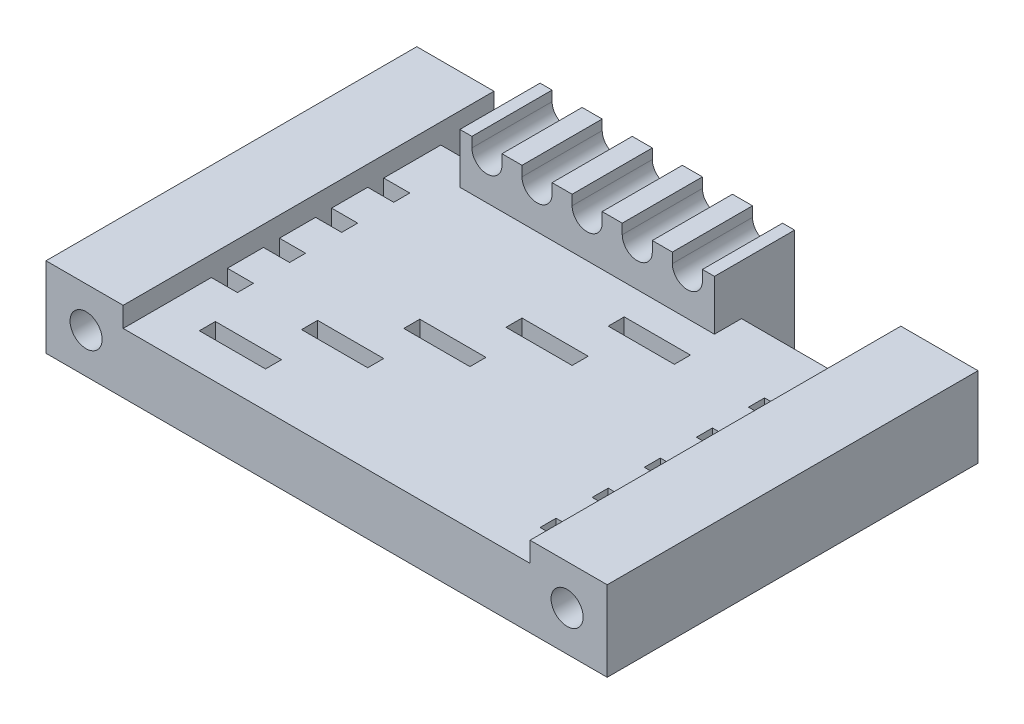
ISO-10303-21;
HEADER;
FILE_DESCRIPTION(('STEP AP214'),'2;1');
FILE_NAME('part.step','',(''),(''),'','','');
FILE_SCHEMA(('AUTOMOTIVE_DESIGN { 1 0 10303 214 1 1 1 1 }'));
ENDSEC;
DATA;
#1=APPLICATION_CONTEXT('core data for automotive mechanical design processes');
#2=APPLICATION_PROTOCOL_DEFINITION('international standard','automotive_design',2000,#1);
#3=PRODUCT_CONTEXT('',#1,'mechanical');
#4=PRODUCT('Part','Part','',(#3));
#5=PRODUCT_RELATED_PRODUCT_CATEGORY('part','',(#4));
#6=PRODUCT_DEFINITION_FORMATION('','',#4);
#7=PRODUCT_DEFINITION_CONTEXT('part definition',#1,'design');
#8=PRODUCT_DEFINITION('design','',#6,#7);
#9=PRODUCT_DEFINITION_SHAPE('','',#8);
#10=(LENGTH_UNIT() NAMED_UNIT(*) SI_UNIT(.MILLI.,.METRE.));
#11=(NAMED_UNIT(*) PLANE_ANGLE_UNIT() SI_UNIT($,.RADIAN.));
#12=(NAMED_UNIT(*) SI_UNIT($,.STERADIAN.) SOLID_ANGLE_UNIT());
#13=UNCERTAINTY_MEASURE_WITH_UNIT(LENGTH_MEASURE(1.E-05),#10,'distance_accuracy_value','');
#14=(GEOMETRIC_REPRESENTATION_CONTEXT(3) GLOBAL_UNCERTAINTY_ASSIGNED_CONTEXT((#13)) GLOBAL_UNIT_ASSIGNED_CONTEXT((#10,
#11,#12)) REPRESENTATION_CONTEXT('',''));
#15=CARTESIAN_POINT('',(0.,0.,0.));
#16=DIRECTION('',(0.,0.,1.));
#17=DIRECTION('',(1.,0.,0.));
#18=AXIS2_PLACEMENT_3D('',#15,#16,#17);
#19=CARTESIAN_POINT('',(-14.,1.5,-9.25));
#20=DIRECTION('',(0.,0.,1.));
#21=DIRECTION('',(1.,0.,0.));
#22=AXIS2_PLACEMENT_3D('',#19,#20,#21);
#23=PLANE('',#22);
#24=DIRECTION('',(-1.,0.,0.));
#25=VECTOR('',#24,1.);
#26=CARTESIAN_POINT('',(-14.,-1.5,-9.25));
#27=LINE('',#26,#25);
#28=CARTESIAN_POINT('',(4.84999999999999,-1.5,-9.25));
#29=VERTEX_POINT('',#28);
#30=CARTESIAN_POINT('',(-8.84999999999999,-1.5,-9.25));
#31=VERTEX_POINT('',#30);
#32=EDGE_CURVE('E636',#29,#31,#27,.T.);
#33=ORIENTED_EDGE('',*,*,#32,.T.);
#34=DIRECTION('',(0.,1.,0.));
#35=VECTOR('',#34,1.);
#36=CARTESIAN_POINT('',(-8.84999999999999,1.5,-9.25));
#37=LINE('',#36,#35);
#38=CARTESIAN_POINT('',(-8.84999999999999,1.5,-9.25));
#39=VERTEX_POINT('',#38);
#40=EDGE_CURVE('E621',#31,#39,#37,.T.);
#41=ORIENTED_EDGE('',*,*,#40,.T.);
#42=DIRECTION('',(-1.,0.,0.));
#43=VECTOR('',#42,1.);
#44=CARTESIAN_POINT('',(-14.,1.5,-9.25));
#45=LINE('',#44,#43);
#46=CARTESIAN_POINT('',(-7.84999999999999,1.5,-9.25));
#47=VERTEX_POINT('',#46);
#48=EDGE_CURVE('E634',#47,#39,#45,.T.);
#49=ORIENTED_EDGE('',*,*,#48,.F.);
#50=DIRECTION('',(0.,-1.,0.));
#51=VECTOR('',#50,1.);
#52=CARTESIAN_POINT('',(-7.84999999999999,4.,-9.25));
#53=LINE('',#52,#51);
#54=CARTESIAN_POINT('',(-7.84999999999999,4.,-9.25));
#55=VERTEX_POINT('',#54);
#56=EDGE_CURVE('E1022',#55,#47,#53,.T.);
#57=ORIENTED_EDGE('',*,*,#56,.F.);
#58=DIRECTION('',(-1.,0.,0.));
#59=VECTOR('',#58,1.);
#60=CARTESIAN_POINT('',(-7.84999999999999,4.,-9.25));
#61=LINE('',#60,#59);
#62=CARTESIAN_POINT('',(-7.25000000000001,4.,-9.25));
#63=VERTEX_POINT('',#62);
#64=EDGE_CURVE('E1000',#63,#55,#61,.T.);
#65=ORIENTED_EDGE('',*,*,#64,.F.);
#66=DIRECTION('',(0.,1.,0.));
#67=VECTOR('',#66,1.);
#68=CARTESIAN_POINT('',(-7.25000000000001,5.37077675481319,-9.25));
#69=LINE('',#68,#67);
#70=CARTESIAN_POINT('',(-7.25000000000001,3.5,-9.25));
#71=VERTEX_POINT('',#70);
#72=EDGE_CURVE('E51',#71,#63,#69,.T.);
#73=ORIENTED_EDGE('',*,*,#72,.F.);
#74=CARTESIAN_POINT('',(-6.50000000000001,3.5,-9.25));
#75=DIRECTION('',(0.,0.,-1.));
#76=DIRECTION('',(-1.,0.,0.));
#77=AXIS2_PLACEMENT_3D('',#74,#75,#76);
#78=CIRCLE('',#77,0.750000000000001);
#79=CARTESIAN_POINT('',(-5.75000000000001,3.5,-9.25));
#80=VERTEX_POINT('',#79);
#81=EDGE_CURVE('E957',#80,#71,#78,.T.);
#82=ORIENTED_EDGE('',*,*,#81,.F.);
#83=DIRECTION('',(0.,-1.,0.));
#84=VECTOR('',#83,1.);
#85=CARTESIAN_POINT('',(-5.75000000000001,3.5,-9.25));
#86=LINE('',#85,#84);
#87=CARTESIAN_POINT('',(-5.75000000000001,4.,-9.25));
#88=VERTEX_POINT('',#87);
#89=EDGE_CURVE('E962',#88,#80,#86,.T.);
#90=ORIENTED_EDGE('',*,*,#89,.F.);
#91=CARTESIAN_POINT('',(-4.75000000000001,4.,-9.25));
#92=VERTEX_POINT('',#91);
#93=EDGE_CURVE('E1382',#92,#88,#61,.T.);
#94=ORIENTED_EDGE('',*,*,#93,.F.);
#95=DIRECTION('',(0.,1.,0.));
#96=VECTOR('',#95,1.);
#97=CARTESIAN_POINT('',(-4.75000000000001,5.37077675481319,-9.25));
#98=LINE('',#97,#96);
#99=CARTESIAN_POINT('',(-4.75000000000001,3.5,-9.25));
#100=VERTEX_POINT('',#99);
#101=EDGE_CURVE('E59',#100,#92,#98,.T.);
#102=ORIENTED_EDGE('',*,*,#101,.F.);
#103=CARTESIAN_POINT('',(-4.00000000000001,3.5,-9.25));
#104=DIRECTION('',(0.,0.,-1.));
#105=DIRECTION('',(-1.,0.,0.));
#106=AXIS2_PLACEMENT_3D('',#103,#104,#105);
#107=CIRCLE('',#106,0.75);
#108=CARTESIAN_POINT('',(-3.25000000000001,3.5,-9.25));
#109=VERTEX_POINT('',#108);
#110=EDGE_CURVE('E946',#109,#100,#107,.T.);
#111=ORIENTED_EDGE('',*,*,#110,.F.);
#112=DIRECTION('',(0.,-1.,0.));
#113=VECTOR('',#112,1.);
#114=CARTESIAN_POINT('',(-3.25000000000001,3.5,-9.25));
#115=LINE('',#114,#113);
#116=CARTESIAN_POINT('',(-3.25000000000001,4.,-9.25));
#117=VERTEX_POINT('',#116);
#118=EDGE_CURVE('E951',#117,#109,#115,.T.);
#119=ORIENTED_EDGE('',*,*,#118,.F.);
#120=CARTESIAN_POINT('',(-2.25000000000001,4.,-9.25));
#121=VERTEX_POINT('',#120);
#122=EDGE_CURVE('E1379',#121,#117,#61,.T.);
#123=ORIENTED_EDGE('',*,*,#122,.F.);
#124=DIRECTION('',(0.,1.,0.));
#125=VECTOR('',#124,1.);
#126=CARTESIAN_POINT('',(-2.25000000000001,5.37077675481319,-9.25));
#127=LINE('',#126,#125);
#128=CARTESIAN_POINT('',(-2.25000000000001,3.5,-9.25));
#129=VERTEX_POINT('',#128);
#130=EDGE_CURVE('E935',#129,#121,#127,.T.);
#131=ORIENTED_EDGE('',*,*,#130,.F.);
#132=CARTESIAN_POINT('',(-1.50000000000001,3.5,-9.25));
#133=DIRECTION('',(0.,0.,-1.));
#134=DIRECTION('',(-1.,0.,0.));
#135=AXIS2_PLACEMENT_3D('',#132,#133,#134);
#136=CIRCLE('',#135,0.75);
#137=CARTESIAN_POINT('',(-0.750000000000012,3.5,-9.25));
#138=VERTEX_POINT('',#137);
#139=EDGE_CURVE('E932',#138,#129,#136,.T.);
#140=ORIENTED_EDGE('',*,*,#139,.F.);
#141=DIRECTION('',(0.,-1.,0.));
#142=VECTOR('',#141,1.);
#143=CARTESIAN_POINT('',(-0.750000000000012,3.5,-9.25));
#144=LINE('',#143,#142);
#145=CARTESIAN_POINT('',(-0.750000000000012,4.,-9.25));
#146=VERTEX_POINT('',#145);
#147=EDGE_CURVE('E938',#146,#138,#144,.T.);
#148=ORIENTED_EDGE('',*,*,#147,.F.);
#149=CARTESIAN_POINT('',(0.249999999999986,4.,-9.25));
#150=VERTEX_POINT('',#149);
#151=EDGE_CURVE('E1375',#150,#146,#61,.T.);
#152=ORIENTED_EDGE('',*,*,#151,.F.);
#153=DIRECTION('',(0.,1.,0.));
#154=VECTOR('',#153,1.);
#155=CARTESIAN_POINT('',(0.249999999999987,5.37077675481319,-9.25));
#156=LINE('',#155,#154);
#157=CARTESIAN_POINT('',(0.249999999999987,3.5,-9.25));
#158=VERTEX_POINT('',#157);
#159=EDGE_CURVE('E1367',#158,#150,#156,.T.);
#160=ORIENTED_EDGE('',*,*,#159,.F.);
#161=CARTESIAN_POINT('',(0.999999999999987,3.5,-9.25));
#162=DIRECTION('',(0.,0.,-1.));
#163=DIRECTION('',(-1.,0.,0.));
#164=AXIS2_PLACEMENT_3D('',#161,#162,#163);
#165=CIRCLE('',#164,0.75);
#166=CARTESIAN_POINT('',(1.74999999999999,3.5,-9.25));
#167=VERTEX_POINT('',#166);
#168=EDGE_CURVE('E944',#167,#158,#165,.T.);
#169=ORIENTED_EDGE('',*,*,#168,.F.);
#170=DIRECTION('',(0.,-1.,0.));
#171=VECTOR('',#170,1.);
#172=CARTESIAN_POINT('',(1.74999999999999,3.5,-9.25));
#173=LINE('',#172,#171);
#174=CARTESIAN_POINT('',(1.74999999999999,4.,-9.25));
#175=VERTEX_POINT('',#174);
#176=EDGE_CURVE('E921',#175,#167,#173,.T.);
#177=ORIENTED_EDGE('',*,*,#176,.F.);
#178=CARTESIAN_POINT('',(2.74999999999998,4.,-9.25));
#179=VERTEX_POINT('',#178);
#180=EDGE_CURVE('E999',#179,#175,#61,.T.);
#181=ORIENTED_EDGE('',*,*,#180,.F.);
#182=DIRECTION('',(0.,1.,0.));
#183=VECTOR('',#182,1.);
#184=CARTESIAN_POINT('',(2.74999999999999,5.37077675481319,-9.25));
#185=LINE('',#184,#183);
#186=CARTESIAN_POINT('',(2.74999999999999,3.5,-9.25));
#187=VERTEX_POINT('',#186);
#188=EDGE_CURVE('E926',#187,#179,#185,.T.);
#189=ORIENTED_EDGE('',*,*,#188,.F.);
#190=CARTESIAN_POINT('',(3.49999999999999,3.5,-9.25));
#191=DIRECTION('',(0.,0.,-1.));
#192=DIRECTION('',(-1.,0.,0.));
#193=AXIS2_PLACEMENT_3D('',#190,#191,#192);
#194=CIRCLE('',#193,0.75);
#195=CARTESIAN_POINT('',(4.24999999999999,3.5,-9.25));
#196=VERTEX_POINT('',#195);
#197=EDGE_CURVE('E923',#196,#187,#194,.T.);
#198=ORIENTED_EDGE('',*,*,#197,.F.);
#199=DIRECTION('',(0.,-1.,0.));
#200=VECTOR('',#199,1.);
#201=CARTESIAN_POINT('',(4.24999999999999,3.5,-9.25));
#202=LINE('',#201,#200);
#203=CARTESIAN_POINT('',(4.24999999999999,4.,-9.25));
#204=VERTEX_POINT('',#203);
#205=EDGE_CURVE('E1361',#204,#196,#202,.T.);
#206=ORIENTED_EDGE('',*,*,#205,.F.);
#207=CARTESIAN_POINT('',(4.84999999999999,4.,-9.25));
#208=VERTEX_POINT('',#207);
#209=EDGE_CURVE('E995',#208,#204,#61,.T.);
#210=ORIENTED_EDGE('',*,*,#209,.F.);
#211=DIRECTION('',(0.,-1.,0.));
#212=VECTOR('',#211,1.);
#213=CARTESIAN_POINT('',(4.84999999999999,4.,-9.25));
#214=LINE('',#213,#212);
#215=EDGE_CURVE('E1009',#208,#29,#214,.T.);
#216=ORIENTED_EDGE('',*,*,#215,.T.);
#217=EDGE_LOOP('',(#33,#41,#49,#57,#65,#73,#82,#90,#94,#102,#111,#119,#123,#131,#140,#148,#152,
#160,#169,#177,#181,#189,#198,#206,#210,#216));
#218=FACE_BOUND('',#217,.T.);
#219=ADVANCED_FACE('F36',(#218),#23,.F.);
#220=CARTESIAN_POINT('',(-12.,0.5,-9.25));
#221=DIRECTION('',(0.,0.,-1.));
#222=DIRECTION('',(-1.,0.,0.));
#223=AXIS2_PLACEMENT_3D('',#220,#221,#222);
#224=CIRCLE('',#223,0.799999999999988);
#225=CARTESIAN_POINT('',(-12.8,0.5,-9.25));
#226=VERTEX_POINT('',#225);
#227=EDGE_CURVE('E1489',#226,#226,#224,.T.);
#228=ORIENTED_EDGE('',*,*,#227,.F.);
#229=EDGE_LOOP('',(#228));
#230=FACE_BOUND('',#229,.T.);
#231=DIRECTION('',(0.,-1.,0.));
#232=VECTOR('',#231,1.);
#233=CARTESIAN_POINT('',(-10.15,2.5,-9.25));
#234=LINE('',#233,#232);
#235=CARTESIAN_POINT('',(-10.15,2.5,-9.25));
#236=VERTEX_POINT('',#235);
#237=CARTESIAN_POINT('',(-10.15,-1.5,-9.25));
#238=VERTEX_POINT('',#237);
#239=EDGE_CURVE('E1353',#236,#238,#234,.T.);
#240=ORIENTED_EDGE('',*,*,#239,.T.);
#241=CARTESIAN_POINT('',(-14.,-1.5,-9.25));
#242=VERTEX_POINT('',#241);
#243=EDGE_CURVE('E662',#238,#242,#27,.T.);
#244=ORIENTED_EDGE('',*,*,#243,.T.);
#245=DIRECTION('',(0.,-1.,0.));
#246=VECTOR('',#245,1.);
#247=CARTESIAN_POINT('',(-14.,1.5,-9.25));
#248=LINE('',#247,#246);
#249=CARTESIAN_POINT('',(-14.,2.5,-9.25));
#250=VERTEX_POINT('',#249);
#251=EDGE_CURVE('E673',#250,#242,#248,.T.);
#252=ORIENTED_EDGE('',*,*,#251,.F.);
#253=DIRECTION('',(1.,0.,0.));
#254=VECTOR('',#253,1.);
#255=CARTESIAN_POINT('',(-14.,2.5,-9.25));
#256=LINE('',#255,#254);
#257=EDGE_CURVE('E1343',#250,#236,#256,.T.);
#258=ORIENTED_EDGE('',*,*,#257,.T.);
#259=EDGE_LOOP('',(#240,#244,#252,#258));
#260=FACE_BOUND('',#259,.T.);
#261=ADVANCED_FACE('F1445',(#230,#260),#23,.F.);
#262=CARTESIAN_POINT('',(0.,4.,0.));
#263=DIRECTION('',(0.,-1.,0.));
#264=DIRECTION('',(0.,0.,-1.));
#265=AXIS2_PLACEMENT_3D('',#262,#263,#264);
#266=PLANE('',#265);
#267=ORIENTED_EDGE('',*,*,#209,.T.);
#268=DIRECTION('',(0.,0.,1.));
#269=VECTOR('',#268,1.);
#270=CARTESIAN_POINT('',(4.24999999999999,4.,0.));
#271=LINE('',#270,#269);
#272=CARTESIAN_POINT('',(4.24999999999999,4.,-5.25));
#273=VERTEX_POINT('',#272);
#274=EDGE_CURVE('E888',#204,#273,#271,.T.);
#275=ORIENTED_EDGE('',*,*,#274,.T.);
#276=DIRECTION('',(1.,0.,0.));
#277=VECTOR('',#276,1.);
#278=CARTESIAN_POINT('',(-7.84999999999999,4.,-5.25));
#279=LINE('',#278,#277);
#280=CARTESIAN_POINT('',(4.84999999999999,4.,-5.25));
#281=VERTEX_POINT('',#280);
#282=EDGE_CURVE('E1002',#273,#281,#279,.T.);
#283=ORIENTED_EDGE('',*,*,#282,.T.);
#284=DIRECTION('',(0.,0.,-1.));
#285=VECTOR('',#284,1.);
#286=CARTESIAN_POINT('',(4.84999999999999,4.,-9.25));
#287=LINE('',#286,#285);
#288=EDGE_CURVE('E1006',#281,#208,#287,.T.);
#289=ORIENTED_EDGE('',*,*,#288,.T.);
#290=EDGE_LOOP('',(#267,#275,#283,#289));
#291=FACE_BOUND('',#290,.T.);
#292=ADVANCED_FACE('F1416',(#291),#266,.F.);
#293=CARTESIAN_POINT('',(1.74999999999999,4.,-5.25));
#294=VERTEX_POINT('',#293);
#295=CARTESIAN_POINT('',(2.74999999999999,4.,-5.25));
#296=VERTEX_POINT('',#295);
#297=EDGE_CURVE('E1411',#294,#296,#279,.T.);
#298=ORIENTED_EDGE('',*,*,#297,.T.);
#299=DIRECTION('',(0.,0.,-1.));
#300=VECTOR('',#299,1.);
#301=CARTESIAN_POINT('',(2.74999999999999,4.,0.));
#302=LINE('',#301,#300);
#303=EDGE_CURVE('E885',#296,#179,#302,.T.);
#304=ORIENTED_EDGE('',*,*,#303,.T.);
#305=ORIENTED_EDGE('',*,*,#180,.T.);
#306=DIRECTION('',(0.,0.,1.));
#307=VECTOR('',#306,1.);
#308=CARTESIAN_POINT('',(1.74999999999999,4.,0.));
#309=LINE('',#308,#307);
#310=EDGE_CURVE('E882',#175,#294,#309,.T.);
#311=ORIENTED_EDGE('',*,*,#310,.T.);
#312=EDGE_LOOP('',(#298,#304,#305,#311));
#313=FACE_BOUND('',#312,.T.);
#314=ADVANCED_FACE('F1437',(#313),#266,.F.);
#315=CARTESIAN_POINT('',(-0.750000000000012,4.,-5.25));
#316=VERTEX_POINT('',#315);
#317=CARTESIAN_POINT('',(0.249999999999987,4.,-5.25));
#318=VERTEX_POINT('',#317);
#319=EDGE_CURVE('E1376',#316,#318,#279,.T.);
#320=ORIENTED_EDGE('',*,*,#319,.T.);
#321=DIRECTION('',(0.,0.,-1.));
#322=VECTOR('',#321,1.);
#323=CARTESIAN_POINT('',(0.249999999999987,4.,0.));
#324=LINE('',#323,#322);
#325=EDGE_CURVE('E879',#318,#150,#324,.T.);
#326=ORIENTED_EDGE('',*,*,#325,.T.);
#327=ORIENTED_EDGE('',*,*,#151,.T.);
#328=DIRECTION('',(0.,0.,1.));
#329=VECTOR('',#328,1.);
#330=CARTESIAN_POINT('',(-0.750000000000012,4.,0.));
#331=LINE('',#330,#329);
#332=EDGE_CURVE('E876',#146,#316,#331,.T.);
#333=ORIENTED_EDGE('',*,*,#332,.T.);
#334=EDGE_LOOP('',(#320,#326,#327,#333));
#335=FACE_BOUND('',#334,.T.);
#336=ADVANCED_FACE('F1374',(#335),#266,.F.);
#337=CARTESIAN_POINT('',(-3.25000000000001,4.,-5.25));
#338=VERTEX_POINT('',#337);
#339=CARTESIAN_POINT('',(-2.25000000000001,4.,-5.25));
#340=VERTEX_POINT('',#339);
#341=EDGE_CURVE('E1408',#338,#340,#279,.T.);
#342=ORIENTED_EDGE('',*,*,#341,.T.);
#343=DIRECTION('',(0.,0.,-1.));
#344=VECTOR('',#343,1.);
#345=CARTESIAN_POINT('',(-2.25000000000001,4.,0.));
#346=LINE('',#345,#344);
#347=EDGE_CURVE('E873',#340,#121,#346,.T.);
#348=ORIENTED_EDGE('',*,*,#347,.T.);
#349=ORIENTED_EDGE('',*,*,#122,.T.);
#350=DIRECTION('',(0.,0.,1.));
#351=VECTOR('',#350,1.);
#352=CARTESIAN_POINT('',(-3.25000000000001,4.,0.));
#353=LINE('',#352,#351);
#354=EDGE_CURVE('E870',#117,#338,#353,.T.);
#355=ORIENTED_EDGE('',*,*,#354,.T.);
#356=EDGE_LOOP('',(#342,#348,#349,#355));
#357=FACE_BOUND('',#356,.T.);
#358=ADVANCED_FACE('F1444',(#357),#266,.F.);
#359=CARTESIAN_POINT('',(-5.75000000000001,4.,-5.25));
#360=VERTEX_POINT('',#359);
#361=CARTESIAN_POINT('',(-4.75000000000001,4.,-5.25));
#362=VERTEX_POINT('',#361);
#363=EDGE_CURVE('E1007',#360,#362,#279,.T.);
#364=ORIENTED_EDGE('',*,*,#363,.T.);
#365=DIRECTION('',(0.,0.,-1.));
#366=VECTOR('',#365,1.);
#367=CARTESIAN_POINT('',(-4.75000000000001,4.,0.));
#368=LINE('',#367,#366);
#369=EDGE_CURVE('E868',#362,#92,#368,.T.);
#370=ORIENTED_EDGE('',*,*,#369,.T.);
#371=ORIENTED_EDGE('',*,*,#93,.T.);
#372=DIRECTION('',(0.,0.,1.));
#373=VECTOR('',#372,1.);
#374=CARTESIAN_POINT('',(-5.75000000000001,4.,0.));
#375=LINE('',#374,#373);
#376=EDGE_CURVE('E865',#88,#360,#375,.T.);
#377=ORIENTED_EDGE('',*,*,#376,.T.);
#378=EDGE_LOOP('',(#364,#370,#371,#377));
#379=FACE_BOUND('',#378,.T.);
#380=ADVANCED_FACE('F1407',(#379),#266,.F.);
#381=CARTESIAN_POINT('',(0.,1.5,0.));
#382=DIRECTION('',(0.,1.,0.));
#383=DIRECTION('',(0.,0.,1.));
#384=AXIS2_PLACEMENT_3D('',#381,#382,#383);
#385=PLANE('',#384);
#386=ORIENTED_EDGE('',*,*,#48,.T.);
#387=DIRECTION('',(0.,0.,-1.));
#388=VECTOR('',#387,1.);
#389=CARTESIAN_POINT('',(-8.84999999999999,1.5,-6.6));
#390=LINE('',#389,#388);
#391=CARTESIAN_POINT('',(-8.84999999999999,1.5,-6.6));
#392=VERTEX_POINT('',#391);
#393=EDGE_CURVE('E617',#392,#39,#390,.T.);
#394=ORIENTED_EDGE('',*,*,#393,.F.);
#395=DIRECTION('',(1.,0.,0.));
#396=VECTOR('',#395,1.);
#397=CARTESIAN_POINT('',(-10.15,1.5,-6.6));
#398=LINE('',#397,#396);
#399=CARTESIAN_POINT('',(-10.15,1.5,-6.6));
#400=VERTEX_POINT('',#399);
#401=EDGE_CURVE('E629',#400,#392,#398,.T.);
#402=ORIENTED_EDGE('',*,*,#401,.F.);
#403=DIRECTION('',(0.,0.,1.));
#404=VECTOR('',#403,1.);
#405=CARTESIAN_POINT('',(-10.15,1.5,-9.25));
#406=LINE('',#405,#404);
#407=CARTESIAN_POINT('',(-10.15,1.5,-3.75));
#408=VERTEX_POINT('',#407);
#409=EDGE_CURVE('E1344',#400,#408,#406,.T.);
#410=ORIENTED_EDGE('',*,*,#409,.T.);
#411=DIRECTION('',(-1.,0.,0.));
#412=VECTOR('',#411,1.);
#413=CARTESIAN_POINT('',(-10.15,1.5,-3.75));
#414=LINE('',#413,#412);
#415=CARTESIAN_POINT('',(-8.84999999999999,1.5,-3.75));
#416=VERTEX_POINT('',#415);
#417=EDGE_CURVE('E1051',#416,#408,#414,.T.);
#418=ORIENTED_EDGE('',*,*,#417,.F.);
#419=DIRECTION('',(0.,0.,-1.));
#420=VECTOR('',#419,1.);
#421=CARTESIAN_POINT('',(-8.84999999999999,1.5,-2.95));
#422=LINE('',#421,#420);
#423=CARTESIAN_POINT('',(-8.84999999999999,1.5,-2.95));
#424=VERTEX_POINT('',#423);
#425=EDGE_CURVE('E1048',#424,#416,#422,.T.);
#426=ORIENTED_EDGE('',*,*,#425,.F.);
#427=DIRECTION('',(1.,0.,0.));
#428=VECTOR('',#427,1.);
#429=CARTESIAN_POINT('',(-10.15,1.5,-2.95));
#430=LINE('',#429,#428);
#431=CARTESIAN_POINT('',(-10.15,1.5,-2.95));
#432=VERTEX_POINT('',#431);
#433=EDGE_CURVE('E1045',#432,#424,#430,.T.);
#434=ORIENTED_EDGE('',*,*,#433,.F.);
#435=CARTESIAN_POINT('',(-10.15,1.5,-1.14999999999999));
#436=VERTEX_POINT('',#435);
#437=EDGE_CURVE('E2405',#432,#436,#406,.T.);
#438=ORIENTED_EDGE('',*,*,#437,.T.);
#439=DIRECTION('',(-1.,0.,0.));
#440=VECTOR('',#439,1.);
#441=CARTESIAN_POINT('',(-10.15,1.5,-1.14999999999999));
#442=LINE('',#441,#440);
#443=CARTESIAN_POINT('',(-8.84999999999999,1.5,-1.14999999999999));
#444=VERTEX_POINT('',#443);
#445=EDGE_CURVE('E1031',#444,#436,#442,.T.);
#446=ORIENTED_EDGE('',*,*,#445,.F.);
#447=DIRECTION('',(0.,0.,-1.));
#448=VECTOR('',#447,1.);
#449=CARTESIAN_POINT('',(-8.84999999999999,1.5,-0.349999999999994));
#450=LINE('',#449,#448);
#451=CARTESIAN_POINT('',(-8.84999999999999,1.5,-0.349999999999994));
#452=VERTEX_POINT('',#451);
#453=EDGE_CURVE('E1027',#452,#444,#450,.T.);
#454=ORIENTED_EDGE('',*,*,#453,.F.);
#455=DIRECTION('',(1.,0.,0.));
#456=VECTOR('',#455,1.);
#457=CARTESIAN_POINT('',(-10.15,1.5,-0.349999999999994));
#458=LINE('',#457,#456);
#459=CARTESIAN_POINT('',(-10.15,1.5,-0.349999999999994));
#460=VERTEX_POINT('',#459);
#461=EDGE_CURVE('E1024',#460,#452,#458,.T.);
#462=ORIENTED_EDGE('',*,*,#461,.F.);
#463=CARTESIAN_POINT('',(-10.15,1.5,1.45000000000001));
#464=VERTEX_POINT('',#463);
#465=EDGE_CURVE('E2451',#460,#464,#406,.T.);
#466=ORIENTED_EDGE('',*,*,#465,.T.);
#467=DIRECTION('',(-1.,0.,0.));
#468=VECTOR('',#467,1.);
#469=CARTESIAN_POINT('',(-10.15,1.5,1.45000000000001));
#470=LINE('',#469,#468);
#471=CARTESIAN_POINT('',(-8.84999999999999,1.5,1.45000000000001));
#472=VERTEX_POINT('',#471);
#473=EDGE_CURVE('E1134',#472,#464,#470,.T.);
#474=ORIENTED_EDGE('',*,*,#473,.F.);
#475=DIRECTION('',(0.,0.,-1.));
#476=VECTOR('',#475,1.);
#477=CARTESIAN_POINT('',(-8.84999999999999,1.5,2.25000000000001));
#478=LINE('',#477,#476);
#479=CARTESIAN_POINT('',(-8.84999999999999,1.5,2.25000000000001));
#480=VERTEX_POINT('',#479);
#481=EDGE_CURVE('E1131',#480,#472,#478,.T.);
#482=ORIENTED_EDGE('',*,*,#481,.F.);
#483=DIRECTION('',(1.,0.,0.));
#484=VECTOR('',#483,1.);
#485=CARTESIAN_POINT('',(-10.15,1.5,2.25000000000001));
#486=LINE('',#485,#484);
#487=CARTESIAN_POINT('',(-10.15,1.5,2.25000000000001));
#488=VERTEX_POINT('',#487);
#489=EDGE_CURVE('E1038',#488,#480,#486,.T.);
#490=ORIENTED_EDGE('',*,*,#489,.F.);
#491=CARTESIAN_POINT('',(-10.15,1.5,4.05000000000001));
#492=VERTEX_POINT('',#491);
#493=EDGE_CURVE('E1356',#488,#492,#406,.T.);
#494=ORIENTED_EDGE('',*,*,#493,.T.);
#495=DIRECTION('',(-1.,0.,0.));
#496=VECTOR('',#495,1.);
#497=CARTESIAN_POINT('',(-10.15,1.5,4.05000000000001));
#498=LINE('',#497,#496);
#499=CARTESIAN_POINT('',(-8.84999999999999,1.5,4.05000000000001));
#500=VERTEX_POINT('',#499);
#501=EDGE_CURVE('E1213',#500,#492,#498,.T.);
#502=ORIENTED_EDGE('',*,*,#501,.F.);
#503=DIRECTION('',(0.,0.,-1.));
#504=VECTOR('',#503,1.);
#505=CARTESIAN_POINT('',(-8.84999999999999,1.5,4.85000000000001));
#506=LINE('',#505,#504);
#507=CARTESIAN_POINT('',(-8.84999999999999,1.5,4.85000000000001));
#508=VERTEX_POINT('',#507);
#509=EDGE_CURVE('E1210',#508,#500,#506,.T.);
#510=ORIENTED_EDGE('',*,*,#509,.F.);
#511=DIRECTION('',(1.,0.,0.));
#512=VECTOR('',#511,1.);
#513=CARTESIAN_POINT('',(-10.15,1.5,4.85000000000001));
#514=LINE('',#513,#512);
#515=CARTESIAN_POINT('',(-10.15,1.5,4.85000000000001));
#516=VERTEX_POINT('',#515);
#517=EDGE_CURVE('E1161',#516,#508,#514,.T.);
#518=ORIENTED_EDGE('',*,*,#517,.F.);
#519=CARTESIAN_POINT('',(-10.15,1.5,9.25));
#520=VERTEX_POINT('',#519);
#521=EDGE_CURVE('E1337',#516,#520,#406,.T.);
#522=ORIENTED_EDGE('',*,*,#521,.T.);
#523=DIRECTION('',(1.,0.,0.));
#524=VECTOR('',#523,1.);
#525=CARTESIAN_POINT('',(-14.,1.5,9.25));
#526=LINE('',#525,#524);
#527=CARTESIAN_POINT('',(10.15,1.5,9.25));
#528=VERTEX_POINT('',#527);
#529=EDGE_CURVE('E649',#520,#528,#526,.T.);
#530=ORIENTED_EDGE('',*,*,#529,.T.);
#531=DIRECTION('',(0.,0.,-1.));
#532=VECTOR('',#531,1.);
#533=CARTESIAN_POINT('',(10.15,1.5,-9.25));
#534=LINE('',#533,#532);
#535=CARTESIAN_POINT('',(10.15,1.5,7.45000000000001));
#536=VERTEX_POINT('',#535);
#537=EDGE_CURVE('E1314',#528,#536,#534,.T.);
#538=ORIENTED_EDGE('',*,*,#537,.T.);
#539=DIRECTION('',(1.,0.,0.));
#540=VECTOR('',#539,1.);
#541=CARTESIAN_POINT('',(8.84999999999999,1.5,7.45000000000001));
#542=LINE('',#541,#540);
#543=CARTESIAN_POINT('',(8.84999999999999,1.5,7.45000000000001));
#544=VERTEX_POINT('',#543);
#545=EDGE_CURVE('E1295',#544,#536,#542,.T.);
#546=ORIENTED_EDGE('',*,*,#545,.F.);
#547=DIRECTION('',(0.,0.,1.));
#548=VECTOR('',#547,1.);
#549=CARTESIAN_POINT('',(8.84999999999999,1.5,6.65));
#550=LINE('',#549,#548);
#551=CARTESIAN_POINT('',(8.84999999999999,1.5,6.65));
#552=VERTEX_POINT('',#551);
#553=EDGE_CURVE('E1292',#552,#544,#550,.T.);
#554=ORIENTED_EDGE('',*,*,#553,.F.);
#555=DIRECTION('',(-1.,0.,0.));
#556=VECTOR('',#555,1.);
#557=CARTESIAN_POINT('',(8.84999999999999,1.5,6.65));
#558=LINE('',#557,#556);
#559=CARTESIAN_POINT('',(10.15,1.5,6.65));
#560=VERTEX_POINT('',#559);
#561=EDGE_CURVE('E1202',#560,#552,#558,.T.);
#562=ORIENTED_EDGE('',*,*,#561,.F.);
#563=CARTESIAN_POINT('',(10.15,1.5,4.85000000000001));
#564=VERTEX_POINT('',#563);
#565=EDGE_CURVE('E1323',#560,#564,#534,.T.);
#566=ORIENTED_EDGE('',*,*,#565,.T.);
#567=DIRECTION('',(1.,0.,0.));
#568=VECTOR('',#567,1.);
#569=CARTESIAN_POINT('',(10.15,1.5,4.85000000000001));
#570=LINE('',#569,#568);
#571=CARTESIAN_POINT('',(8.84999999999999,1.5,4.85000000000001));
#572=VERTEX_POINT('',#571);
#573=EDGE_CURVE('E1175',#572,#564,#570,.T.);
#574=ORIENTED_EDGE('',*,*,#573,.F.);
#575=DIRECTION('',(0.,0.,1.));
#576=VECTOR('',#575,1.);
#577=CARTESIAN_POINT('',(8.84999999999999,1.5,4.85000000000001));
#578=LINE('',#577,#576);
#579=CARTESIAN_POINT('',(8.84999999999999,1.5,4.05000000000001));
#580=VERTEX_POINT('',#579);
#581=EDGE_CURVE('E1171',#580,#572,#578,.T.);
#582=ORIENTED_EDGE('',*,*,#581,.F.);
#583=DIRECTION('',(-1.,0.,0.));
#584=VECTOR('',#583,1.);
#585=CARTESIAN_POINT('',(10.15,1.5,4.05000000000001));
#586=LINE('',#585,#584);
#587=CARTESIAN_POINT('',(10.15,1.5,4.05000000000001));
#588=VERTEX_POINT('',#587);
#589=EDGE_CURVE('E1168',#588,#580,#586,.T.);
#590=ORIENTED_EDGE('',*,*,#589,.F.);
#591=CARTESIAN_POINT('',(10.15,1.5,2.25000000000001));
#592=VERTEX_POINT('',#591);
#593=EDGE_CURVE('E1326',#588,#592,#534,.T.);
#594=ORIENTED_EDGE('',*,*,#593,.T.);
#595=DIRECTION('',(1.,0.,0.));
#596=VECTOR('',#595,1.);
#597=CARTESIAN_POINT('',(8.84999999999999,1.5,2.25000000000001));
#598=LINE('',#597,#596);
#599=CARTESIAN_POINT('',(8.84999999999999,1.5,2.25000000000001));
#600=VERTEX_POINT('',#599);
#601=EDGE_CURVE('E1228',#600,#592,#598,.T.);
#602=ORIENTED_EDGE('',*,*,#601,.F.);
#603=DIRECTION('',(0.,0.,1.));
#604=VECTOR('',#603,1.);
#605=CARTESIAN_POINT('',(8.84999999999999,1.5,1.45000000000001));
#606=LINE('',#605,#604);
#607=CARTESIAN_POINT('',(8.84999999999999,1.5,1.45000000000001));
#608=VERTEX_POINT('',#607);
#609=EDGE_CURVE('E1226',#608,#600,#606,.T.);
#610=ORIENTED_EDGE('',*,*,#609,.F.);
#611=DIRECTION('',(-1.,0.,0.));
#612=VECTOR('',#611,1.);
#613=CARTESIAN_POINT('',(8.84999999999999,1.5,1.45000000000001));
#614=LINE('',#613,#612);
#615=CARTESIAN_POINT('',(10.15,1.5,1.45000000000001));
#616=VERTEX_POINT('',#615);
#617=EDGE_CURVE('E1232',#616,#608,#614,.T.);
#618=ORIENTED_EDGE('',*,*,#617,.F.);
#619=CARTESIAN_POINT('',(10.15,1.5,-0.349999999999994));
#620=VERTEX_POINT('',#619);
#621=EDGE_CURVE('E1330',#616,#620,#534,.T.);
#622=ORIENTED_EDGE('',*,*,#621,.T.);
#623=DIRECTION('',(1.,0.,0.));
#624=VECTOR('',#623,1.);
#625=CARTESIAN_POINT('',(8.84999999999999,1.5,-0.349999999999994));
#626=LINE('',#625,#624);
#627=CARTESIAN_POINT('',(8.84999999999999,1.5,-0.349999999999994));
#628=VERTEX_POINT('',#627);
#629=EDGE_CURVE('E1247',#628,#620,#626,.T.);
#630=ORIENTED_EDGE('',*,*,#629,.F.);
#631=DIRECTION('',(0.,0.,1.));
#632=VECTOR('',#631,1.);
#633=CARTESIAN_POINT('',(8.84999999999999,1.5,-1.14999999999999));
#634=LINE('',#633,#632);
#635=CARTESIAN_POINT('',(8.84999999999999,1.5,-1.14999999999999));
#636=VERTEX_POINT('',#635);
#637=EDGE_CURVE('E1245',#636,#628,#634,.T.);
#638=ORIENTED_EDGE('',*,*,#637,.F.);
#639=DIRECTION('',(-1.,0.,0.));
#640=VECTOR('',#639,1.);
#641=CARTESIAN_POINT('',(8.84999999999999,1.5,-1.14999999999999));
#642=LINE('',#641,#640);
#643=CARTESIAN_POINT('',(10.15,1.5,-1.14999999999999));
#644=VERTEX_POINT('',#643);
#645=EDGE_CURVE('E1251',#644,#636,#642,.T.);
#646=ORIENTED_EDGE('',*,*,#645,.F.);
#647=CARTESIAN_POINT('',(10.15,1.5,-2.95));
#648=VERTEX_POINT('',#647);
#649=EDGE_CURVE('E1513',#644,#648,#534,.T.);
#650=ORIENTED_EDGE('',*,*,#649,.T.);
#651=DIRECTION('',(1.,0.,0.));
#652=VECTOR('',#651,1.);
#653=CARTESIAN_POINT('',(8.84999999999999,1.5,-2.95));
#654=LINE('',#653,#652);
#655=CARTESIAN_POINT('',(8.84999999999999,1.5,-2.95));
#656=VERTEX_POINT('',#655);
#657=EDGE_CURVE('E1266',#656,#648,#654,.T.);
#658=ORIENTED_EDGE('',*,*,#657,.F.);
#659=DIRECTION('',(0.,0.,1.));
#660=VECTOR('',#659,1.);
#661=CARTESIAN_POINT('',(8.84999999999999,1.5,-3.75));
#662=LINE('',#661,#660);
#663=CARTESIAN_POINT('',(8.84999999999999,1.5,-3.75));
#664=VERTEX_POINT('',#663);
#665=EDGE_CURVE('E1264',#664,#656,#662,.T.);
#666=ORIENTED_EDGE('',*,*,#665,.F.);
#667=DIRECTION('',(-1.,0.,0.));
#668=VECTOR('',#667,1.);
#669=CARTESIAN_POINT('',(8.84999999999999,1.5,-3.75));
#670=LINE('',#669,#668);
#671=CARTESIAN_POINT('',(10.15,1.5,-3.75));
#672=VERTEX_POINT('',#671);
#673=EDGE_CURVE('E1270',#672,#664,#670,.T.);
#674=ORIENTED_EDGE('',*,*,#673,.F.);
#675=CARTESIAN_POINT('',(10.15,1.5,-9.25));
#676=VERTEX_POINT('',#675);
#677=EDGE_CURVE('E1329',#672,#676,#534,.T.);
#678=ORIENTED_EDGE('',*,*,#677,.T.);
#679=CARTESIAN_POINT('',(9.14999999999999,1.5,-9.25));
#680=VERTEX_POINT('',#679);
#681=EDGE_CURVE('E645',#676,#680,#45,.T.);
#682=ORIENTED_EDGE('',*,*,#681,.T.);
#683=DIRECTION('',(0.,0.,-1.));
#684=VECTOR('',#683,1.);
#685=CARTESIAN_POINT('',(9.14999999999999,1.5,-8.9));
#686=LINE('',#685,#684);
#687=CARTESIAN_POINT('',(9.14999999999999,1.5,-6.6));
#688=VERTEX_POINT('',#687);
#689=EDGE_CURVE('E1285',#688,#680,#686,.T.);
#690=ORIENTED_EDGE('',*,*,#689,.F.);
#691=DIRECTION('',(1.,0.,0.));
#692=VECTOR('',#691,1.);
#693=CARTESIAN_POINT('',(4.84999999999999,1.5,-6.6));
#694=LINE('',#693,#692);
#695=CARTESIAN_POINT('',(4.84999999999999,1.5,-6.6));
#696=VERTEX_POINT('',#695);
#697=EDGE_CURVE('E1082',#696,#688,#694,.T.);
#698=ORIENTED_EDGE('',*,*,#697,.F.);
#699=DIRECTION('',(0.,0.,-1.));
#700=VECTOR('',#699,1.);
#701=CARTESIAN_POINT('',(4.84999999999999,1.5,-9.25));
#702=LINE('',#701,#700);
#703=CARTESIAN_POINT('',(4.84999999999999,1.5,-5.25));
#704=VERTEX_POINT('',#703);
#705=EDGE_CURVE('E1013',#704,#696,#702,.T.);
#706=ORIENTED_EDGE('',*,*,#705,.F.);
#707=DIRECTION('',(1.,0.,0.));
#708=VECTOR('',#707,1.);
#709=CARTESIAN_POINT('',(-7.84999999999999,1.5,-5.25));
#710=LINE('',#709,#708);
#711=CARTESIAN_POINT('',(-7.84999999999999,1.5,-5.25));
#712=VERTEX_POINT('',#711);
#713=EDGE_CURVE('E1011',#712,#704,#710,.T.);
#714=ORIENTED_EDGE('',*,*,#713,.F.);
#715=DIRECTION('',(0.,0.,1.));
#716=VECTOR('',#715,1.);
#717=CARTESIAN_POINT('',(-7.84999999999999,1.5,-9.25));
#718=LINE('',#717,#716);
#719=EDGE_CURVE('E644',#47,#712,#718,.T.);
#720=ORIENTED_EDGE('',*,*,#719,.F.);
#721=EDGE_LOOP('',(#386,#394,#402,#410,#418,#426,#434,#438,#446,#454,#462,#466,#474,#482,#490,
#494,#502,#510,#518,#522,#530,#538,#546,#554,#562,#566,#574,#582,#590,#594,#602,#610,#618,#622,
#630,#638,#646,#650,#658,#666,#674,#678,#682,#690,#698,#706,#714,#720));
#722=FACE_BOUND('',#721,.T.);
#723=DIRECTION('',(0.,0.,-1.));
#724=VECTOR('',#723,1.);
#725=CARTESIAN_POINT('',(-2.35000000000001,1.5,4.85000000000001));
#726=LINE('',#725,#724);
#727=CARTESIAN_POINT('',(-2.35000000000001,1.5,4.85000000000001));
#728=VERTEX_POINT('',#727);
#729=CARTESIAN_POINT('',(-2.35000000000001,1.5,4.05000000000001));
#730=VERTEX_POINT('',#729);
#731=EDGE_CURVE('E1146',#728,#730,#726,.T.);
#732=ORIENTED_EDGE('',*,*,#731,.F.);
#733=DIRECTION('',(1.,0.,0.));
#734=VECTOR('',#733,1.);
#735=CARTESIAN_POINT('',(-2.35000000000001,1.5,4.85000000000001));
#736=LINE('',#735,#734);
#737=CARTESIAN_POINT('',(-5.65000000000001,1.5,4.85000000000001));
#738=VERTEX_POINT('',#737);
#739=EDGE_CURVE('E1155',#738,#728,#736,.T.);
#740=ORIENTED_EDGE('',*,*,#739,.F.);
#741=DIRECTION('',(0.,0.,1.));
#742=VECTOR('',#741,1.);
#743=CARTESIAN_POINT('',(-5.65000000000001,1.5,4.85000000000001));
#744=LINE('',#743,#742);
#745=CARTESIAN_POINT('',(-5.65000000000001,1.5,4.05000000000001));
#746=VERTEX_POINT('',#745);
#747=EDGE_CURVE('E1152',#746,#738,#744,.T.);
#748=ORIENTED_EDGE('',*,*,#747,.F.);
#749=DIRECTION('',(-1.,0.,0.));
#750=VECTOR('',#749,1.);
#751=CARTESIAN_POINT('',(-2.35000000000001,1.5,4.05000000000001));
#752=LINE('',#751,#750);
#753=EDGE_CURVE('E1148',#730,#746,#752,.T.);
#754=ORIENTED_EDGE('',*,*,#753,.F.);
#755=EDGE_LOOP('',(#732,#740,#748,#754));
#756=FACE_BOUND('',#755,.T.);
#757=DIRECTION('',(0.,0.,-1.));
#758=VECTOR('',#757,1.);
#759=CARTESIAN_POINT('',(-4.85000000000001,1.5,7.45000000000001));
#760=LINE('',#759,#758);
#761=CARTESIAN_POINT('',(-4.85000000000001,1.5,7.45000000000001));
#762=VERTEX_POINT('',#761);
#763=CARTESIAN_POINT('',(-4.85000000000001,1.5,6.65000000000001));
#764=VERTEX_POINT('',#763);
#765=EDGE_CURVE('E1187',#762,#764,#760,.T.);
#766=ORIENTED_EDGE('',*,*,#765,.F.);
#767=DIRECTION('',(1.,0.,0.));
#768=VECTOR('',#767,1.);
#769=CARTESIAN_POINT('',(-4.85000000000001,1.5,7.45000000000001));
#770=LINE('',#769,#768);
#771=CARTESIAN_POINT('',(-8.15000000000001,1.5,7.45000000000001));
#772=VERTEX_POINT('',#771);
#773=EDGE_CURVE('E1196',#772,#762,#770,.T.);
#774=ORIENTED_EDGE('',*,*,#773,.F.);
#775=DIRECTION('',(0.,0.,1.));
#776=VECTOR('',#775,1.);
#777=CARTESIAN_POINT('',(-8.15000000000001,1.5,7.45000000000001));
#778=LINE('',#777,#776);
#779=CARTESIAN_POINT('',(-8.15000000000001,1.5,6.65000000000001));
#780=VERTEX_POINT('',#779);
#781=EDGE_CURVE('E1193',#780,#772,#778,.T.);
#782=ORIENTED_EDGE('',*,*,#781,.F.);
#783=DIRECTION('',(-1.,0.,0.));
#784=VECTOR('',#783,1.);
#785=CARTESIAN_POINT('',(-4.85000000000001,1.5,6.65000000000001));
#786=LINE('',#785,#784);
#787=EDGE_CURVE('E1189',#764,#780,#786,.T.);
#788=ORIENTED_EDGE('',*,*,#787,.F.);
#789=EDGE_LOOP('',(#766,#774,#782,#788));
#790=FACE_BOUND('',#789,.T.);
#791=DIRECTION('',(1.,0.,0.));
#792=VECTOR('',#791,1.);
#793=CARTESIAN_POINT('',(0.15,1.5,2.25000000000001));
#794=LINE('',#793,#792);
#795=CARTESIAN_POINT('',(-3.15000000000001,1.5,2.25000000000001));
#796=VERTEX_POINT('',#795);
#797=CARTESIAN_POINT('',(0.15,1.5,2.25000000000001));
#798=VERTEX_POINT('',#797);
#799=EDGE_CURVE('E1109',#796,#798,#794,.T.);
#800=ORIENTED_EDGE('',*,*,#799,.F.);
#801=DIRECTION('',(0.,0.,1.));
#802=VECTOR('',#801,1.);
#803=CARTESIAN_POINT('',(-3.15000000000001,1.5,2.25000000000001));
#804=LINE('',#803,#802);
#805=CARTESIAN_POINT('',(-3.15000000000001,1.5,1.45000000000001));
#806=VERTEX_POINT('',#805);
#807=EDGE_CURVE('E1118',#806,#796,#804,.T.);
#808=ORIENTED_EDGE('',*,*,#807,.F.);
#809=DIRECTION('',(-1.,0.,0.));
#810=VECTOR('',#809,1.);
#811=CARTESIAN_POINT('',(0.15,1.5,1.45000000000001));
#812=LINE('',#811,#810);
#813=CARTESIAN_POINT('',(0.15,1.5,1.45000000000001));
#814=VERTEX_POINT('',#813);
#815=EDGE_CURVE('E1115',#814,#806,#812,.T.);
#816=ORIENTED_EDGE('',*,*,#815,.F.);
#817=DIRECTION('',(0.,0.,-1.));
#818=VECTOR('',#817,1.);
#819=CARTESIAN_POINT('',(0.15,1.5,2.25000000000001));
#820=LINE('',#819,#818);
#821=EDGE_CURVE('E1111',#798,#814,#820,.T.);
#822=ORIENTED_EDGE('',*,*,#821,.F.);
#823=EDGE_LOOP('',(#800,#808,#816,#822));
#824=FACE_BOUND('',#823,.T.);
#825=DIRECTION('',(1.,0.,0.));
#826=VECTOR('',#825,1.);
#827=CARTESIAN_POINT('',(2.64999999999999,1.5,-0.349999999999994));
#828=LINE('',#827,#826);
#829=CARTESIAN_POINT('',(-0.650000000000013,1.5,-0.349999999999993));
#830=VERTEX_POINT('',#829);
#831=CARTESIAN_POINT('',(2.64999999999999,1.5,-0.349999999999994));
#832=VERTEX_POINT('',#831);
#833=EDGE_CURVE('E1089',#830,#832,#828,.T.);
#834=ORIENTED_EDGE('',*,*,#833,.F.);
#835=DIRECTION('',(0.,0.,1.));
#836=VECTOR('',#835,1.);
#837=CARTESIAN_POINT('',(-0.650000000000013,1.5,-0.349999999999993));
#838=LINE('',#837,#836);
#839=CARTESIAN_POINT('',(-0.650000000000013,1.5,-1.14999999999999));
#840=VERTEX_POINT('',#839);
#841=EDGE_CURVE('E1098',#840,#830,#838,.T.);
#842=ORIENTED_EDGE('',*,*,#841,.F.);
#843=DIRECTION('',(-1.,0.,0.));
#844=VECTOR('',#843,1.);
#845=CARTESIAN_POINT('',(2.64999999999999,1.5,-1.14999999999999));
#846=LINE('',#845,#844);
#847=CARTESIAN_POINT('',(2.64999999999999,1.5,-1.14999999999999));
#848=VERTEX_POINT('',#847);
#849=EDGE_CURVE('E1095',#848,#840,#846,.T.);
#850=ORIENTED_EDGE('',*,*,#849,.F.);
#851=DIRECTION('',(0.,0.,-1.));
#852=VECTOR('',#851,1.);
#853=CARTESIAN_POINT('',(2.64999999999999,1.5,-0.349999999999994));
#854=LINE('',#853,#852);
#855=EDGE_CURVE('E1091',#832,#848,#854,.T.);
#856=ORIENTED_EDGE('',*,*,#855,.F.);
#857=EDGE_LOOP('',(#834,#842,#850,#856));
#858=FACE_BOUND('',#857,.T.);
#859=DIRECTION('',(0.,0.,1.));
#860=VECTOR('',#859,1.);
#861=CARTESIAN_POINT('',(1.84999999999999,1.5,-3.75));
#862=LINE('',#861,#860);
#863=CARTESIAN_POINT('',(1.84999999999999,1.5,-3.75));
#864=VERTEX_POINT('',#863);
#865=CARTESIAN_POINT('',(1.84999999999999,1.5,-2.95));
#866=VERTEX_POINT('',#865);
#867=EDGE_CURVE('E1067',#864,#866,#862,.T.);
#868=ORIENTED_EDGE('',*,*,#867,.F.);
#869=DIRECTION('',(-1.,0.,0.));
#870=VECTOR('',#869,1.);
#871=CARTESIAN_POINT('',(1.84999999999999,1.5,-3.75));
#872=LINE('',#871,#870);
#873=CARTESIAN_POINT('',(5.14999999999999,1.5,-3.75));
#874=VERTEX_POINT('',#873);
#875=EDGE_CURVE('E1076',#874,#864,#872,.T.);
#876=ORIENTED_EDGE('',*,*,#875,.F.);
#877=DIRECTION('',(0.,0.,-1.));
#878=VECTOR('',#877,1.);
#879=CARTESIAN_POINT('',(5.14999999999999,1.5,-3.75));
#880=LINE('',#879,#878);
#881=CARTESIAN_POINT('',(5.14999999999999,1.5,-2.95));
#882=VERTEX_POINT('',#881);
#883=EDGE_CURVE('E1073',#882,#874,#880,.T.);
#884=ORIENTED_EDGE('',*,*,#883,.F.);
#885=DIRECTION('',(1.,0.,0.));
#886=VECTOR('',#885,1.);
#887=CARTESIAN_POINT('',(1.84999999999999,1.5,-2.95));
#888=LINE('',#887,#886);
#889=EDGE_CURVE('E1069',#866,#882,#888,.T.);
#890=ORIENTED_EDGE('',*,*,#889,.F.);
#891=EDGE_LOOP('',(#868,#876,#884,#890));
#892=FACE_BOUND('',#891,.T.);
#893=ADVANCED_FACE('F641',(#722,#756,#790,#824,#858,#892),#385,.T.);
#894=CARTESIAN_POINT('',(14.,1.5,-9.25));
#895=DIRECTION('',(-1.,0.,0.));
#896=DIRECTION('',(0.,0.,1.));
#897=AXIS2_PLACEMENT_3D('',#894,#895,#896);
#898=PLANE('',#897);
#899=DIRECTION('',(0.,0.,-1.));
#900=VECTOR('',#899,1.);
#901=CARTESIAN_POINT('',(14.,-1.5,-9.25));
#902=LINE('',#901,#900);
#903=CARTESIAN_POINT('',(14.,-1.5,9.25));
#904=VERTEX_POINT('',#903);
#905=CARTESIAN_POINT('',(14.,-1.5,-9.25));
#906=VERTEX_POINT('',#905);
#907=EDGE_CURVE('E659',#904,#906,#902,.T.);
#908=ORIENTED_EDGE('',*,*,#907,.T.);
#909=DIRECTION('',(0.,-1.,0.));
#910=VECTOR('',#909,1.);
#911=CARTESIAN_POINT('',(14.,1.5,-9.25));
#912=LINE('',#911,#910);
#913=CARTESIAN_POINT('',(14.,2.5,-9.25));
#914=VERTEX_POINT('',#913);
#915=EDGE_CURVE('E676',#914,#906,#912,.T.);
#916=ORIENTED_EDGE('',*,*,#915,.F.);
#917=DIRECTION('',(0.,0.,1.));
#918=VECTOR('',#917,1.);
#919=CARTESIAN_POINT('',(14.,2.5,-9.25));
#920=LINE('',#919,#918);
#921=CARTESIAN_POINT('',(14.,2.5,9.25));
#922=VERTEX_POINT('',#921);
#923=EDGE_CURVE('E1496',#914,#922,#920,.T.);
#924=ORIENTED_EDGE('',*,*,#923,.T.);
#925=DIRECTION('',(0.,-1.,0.));
#926=VECTOR('',#925,1.);
#927=CARTESIAN_POINT('',(14.,1.5,9.25));
#928=LINE('',#927,#926);
#929=EDGE_CURVE('E658',#922,#904,#928,.T.);
#930=ORIENTED_EDGE('',*,*,#929,.T.);
#931=EDGE_LOOP('',(#908,#916,#924,#930));
#932=FACE_BOUND('',#931,.T.);
#933=ADVANCED_FACE('F38',(#932),#898,.F.);
#934=CARTESIAN_POINT('',(12.,0.5,-9.25));
#935=DIRECTION('',(0.,0.,-1.));
#936=DIRECTION('',(-1.,0.,0.));
#937=AXIS2_PLACEMENT_3D('',#934,#935,#936);
#938=CIRCLE('',#937,0.799999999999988);
#939=CARTESIAN_POINT('',(11.2,0.5,-9.25));
#940=VERTEX_POINT('',#939);
#941=EDGE_CURVE('E637',#940,#940,#938,.T.);
#942=ORIENTED_EDGE('',*,*,#941,.F.);
#943=EDGE_LOOP('',(#942));
#944=FACE_BOUND('',#943,.T.);
#945=CARTESIAN_POINT('',(9.14999999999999,-1.5,-9.25));
#946=VERTEX_POINT('',#945);
#947=EDGE_CURVE('E664',#906,#946,#27,.T.);
#948=ORIENTED_EDGE('',*,*,#947,.T.);
#949=DIRECTION('',(0.,1.,0.));
#950=VECTOR('',#949,1.);
#951=CARTESIAN_POINT('',(9.14999999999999,1.5,-9.25));
#952=LINE('',#951,#950);
#953=EDGE_CURVE('E638',#946,#680,#952,.T.);
#954=ORIENTED_EDGE('',*,*,#953,.T.);
#955=ORIENTED_EDGE('',*,*,#681,.F.);
#956=DIRECTION('',(0.,-1.,0.));
#957=VECTOR('',#956,1.);
#958=CARTESIAN_POINT('',(10.15,2.5,-9.25));
#959=LINE('',#958,#957);
#960=CARTESIAN_POINT('',(10.15,2.5,-9.25));
#961=VERTEX_POINT('',#960);
#962=EDGE_CURVE('E1335',#961,#676,#959,.T.);
#963=ORIENTED_EDGE('',*,*,#962,.F.);
#964=DIRECTION('',(1.,0.,0.));
#965=VECTOR('',#964,1.);
#966=CARTESIAN_POINT('',(14.,2.5,-9.25));
#967=LINE('',#966,#965);
#968=EDGE_CURVE('E1328',#961,#914,#967,.T.);
#969=ORIENTED_EDGE('',*,*,#968,.T.);
#970=ORIENTED_EDGE('',*,*,#915,.T.);
#971=EDGE_LOOP('',(#948,#954,#955,#963,#969,#970));
#972=FACE_BOUND('',#971,.T.);
#973=ADVANCED_FACE('F1449',(#944,#972),#23,.F.);
#974=CARTESIAN_POINT('',(-14.,1.5,-9.25));
#975=DIRECTION('',(1.,0.,0.));
#976=DIRECTION('',(0.,0.,-1.));
#977=AXIS2_PLACEMENT_3D('',#974,#975,#976);
#978=PLANE('',#977);
#979=DIRECTION('',(0.,0.,1.));
#980=VECTOR('',#979,1.);
#981=CARTESIAN_POINT('',(-14.,-1.5,-9.25));
#982=LINE('',#981,#980);
#983=CARTESIAN_POINT('',(-14.,-1.5,9.25));
#984=VERTEX_POINT('',#983);
#985=EDGE_CURVE('E650',#242,#984,#982,.T.);
#986=ORIENTED_EDGE('',*,*,#985,.T.);
#987=DIRECTION('',(0.,-1.,0.));
#988=VECTOR('',#987,1.);
#989=CARTESIAN_POINT('',(-14.,1.5,9.25));
#990=LINE('',#989,#988);
#991=CARTESIAN_POINT('',(-14.,2.5,9.25));
#992=VERTEX_POINT('',#991);
#993=EDGE_CURVE('E670',#992,#984,#990,.T.);
#994=ORIENTED_EDGE('',*,*,#993,.F.);
#995=DIRECTION('',(0.,0.,-1.));
#996=VECTOR('',#995,1.);
#997=CARTESIAN_POINT('',(-14.,2.5,-9.25));
#998=LINE('',#997,#996);
#999=EDGE_CURVE('E1340',#992,#250,#998,.T.);
#1000=ORIENTED_EDGE('',*,*,#999,.T.);
#1001=ORIENTED_EDGE('',*,*,#251,.T.);
#1002=EDGE_LOOP('',(#986,#994,#1000,#1001));
#1003=FACE_BOUND('',#1002,.T.);
#1004=ADVANCED_FACE('F1457',(#1003),#978,.F.);
#1005=CARTESIAN_POINT('',(-14.,1.5,9.25));
#1006=DIRECTION('',(0.,0.,-1.));
#1007=DIRECTION('',(-1.,0.,0.));
#1008=AXIS2_PLACEMENT_3D('',#1005,#1006,#1007);
#1009=PLANE('',#1008);
#1010=CARTESIAN_POINT('',(12.,0.5,9.25));
#1011=DIRECTION('',(0.,0.,-1.));
#1012=DIRECTION('',(-1.,0.,0.));
#1013=AXIS2_PLACEMENT_3D('',#1010,#1011,#1012);
#1014=CIRCLE('',#1013,0.799999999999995);
#1015=CARTESIAN_POINT('',(11.2,0.5,9.25));
#1016=VERTEX_POINT('',#1015);
#1017=EDGE_CURVE('E1486',#1016,#1016,#1014,.T.);
#1018=ORIENTED_EDGE('',*,*,#1017,.T.);
#1019=EDGE_LOOP('',(#1018));
#1020=FACE_BOUND('',#1019,.T.);
#1021=CARTESIAN_POINT('',(-12.,0.5,9.25));
#1022=DIRECTION('',(0.,0.,-1.));
#1023=DIRECTION('',(-1.,0.,0.));
#1024=AXIS2_PLACEMENT_3D('',#1021,#1022,#1023);
#1025=CIRCLE('',#1024,0.799999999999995);
#1026=CARTESIAN_POINT('',(-12.8,0.5,9.25));
#1027=VERTEX_POINT('',#1026);
#1028=EDGE_CURVE('E1492',#1027,#1027,#1025,.T.);
#1029=ORIENTED_EDGE('',*,*,#1028,.T.);
#1030=EDGE_LOOP('',(#1029));
#1031=FACE_BOUND('',#1030,.T.);
#1032=DIRECTION('',(1.,0.,0.));
#1033=VECTOR('',#1032,1.);
#1034=CARTESIAN_POINT('',(-14.,-1.5,9.25));
#1035=LINE('',#1034,#1033);
#1036=EDGE_CURVE('E646',#984,#904,#1035,.T.);
#1037=ORIENTED_EDGE('',*,*,#1036,.T.);
#1038=ORIENTED_EDGE('',*,*,#929,.F.);
#1039=DIRECTION('',(-1.,0.,0.));
#1040=VECTOR('',#1039,1.);
#1041=CARTESIAN_POINT('',(14.,2.5,9.25));
#1042=LINE('',#1041,#1040);
#1043=CARTESIAN_POINT('',(10.15,2.5,9.25));
#1044=VERTEX_POINT('',#1043);
#1045=EDGE_CURVE('E1498',#922,#1044,#1042,.T.);
#1046=ORIENTED_EDGE('',*,*,#1045,.T.);
#1047=DIRECTION('',(0.,-1.,0.));
#1048=VECTOR('',#1047,1.);
#1049=CARTESIAN_POINT('',(10.15,2.5,9.25));
#1050=LINE('',#1049,#1048);
#1051=EDGE_CURVE('E1338',#1044,#528,#1050,.T.);
#1052=ORIENTED_EDGE('',*,*,#1051,.T.);
#1053=ORIENTED_EDGE('',*,*,#529,.F.);
#1054=DIRECTION('',(0.,-1.,0.));
#1055=VECTOR('',#1054,1.);
#1056=CARTESIAN_POINT('',(-10.15,2.5,9.25));
#1057=LINE('',#1056,#1055);
#1058=CARTESIAN_POINT('',(-10.15,2.5,9.25));
#1059=VERTEX_POINT('',#1058);
#1060=EDGE_CURVE('E960',#1059,#520,#1057,.T.);
#1061=ORIENTED_EDGE('',*,*,#1060,.F.);
#1062=DIRECTION('',(-1.,0.,0.));
#1063=VECTOR('',#1062,1.);
#1064=CARTESIAN_POINT('',(-14.,2.5,9.25));
#1065=LINE('',#1064,#1063);
#1066=EDGE_CURVE('E1350',#1059,#992,#1065,.T.);
#1067=ORIENTED_EDGE('',*,*,#1066,.T.);
#1068=ORIENTED_EDGE('',*,*,#993,.T.);
#1069=EDGE_LOOP('',(#1037,#1038,#1046,#1052,#1053,#1061,#1067,#1068));
#1070=FACE_BOUND('',#1069,.T.);
#1071=ADVANCED_FACE('F1464',(#1020,#1031,#1070),#1009,.F.);
#1072=CARTESIAN_POINT('',(0.,-1.5,0.));
#1073=DIRECTION('',(0.,1.,0.));
#1074=DIRECTION('',(0.,0.,1.));
#1075=AXIS2_PLACEMENT_3D('',#1072,#1073,#1074);
#1076=PLANE('',#1075);
#1077=DIRECTION('',(1.,0.,0.));
#1078=VECTOR('',#1077,1.);
#1079=CARTESIAN_POINT('',(0.,-1.5,4.85000000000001));
#1080=LINE('',#1079,#1078);
#1081=CARTESIAN_POINT('',(8.84999999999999,-1.5,4.85000000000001));
#1082=VERTEX_POINT('',#1081);
#1083=CARTESIAN_POINT('',(10.15,-1.5,4.85000000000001));
#1084=VERTEX_POINT('',#1083);
#1085=EDGE_CURVE('E857',#1082,#1084,#1080,.T.);
#1086=ORIENTED_EDGE('',*,*,#1085,.T.);
#1087=DIRECTION('',(0.,0.,-1.));
#1088=VECTOR('',#1087,1.);
#1089=CARTESIAN_POINT('',(10.15,-1.5,0.));
#1090=LINE('',#1089,#1088);
#1091=CARTESIAN_POINT('',(10.15,-1.5,4.05000000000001));
#1092=VERTEX_POINT('',#1091);
#1093=EDGE_CURVE('E860',#1084,#1092,#1090,.T.);
#1094=ORIENTED_EDGE('',*,*,#1093,.T.);
#1095=DIRECTION('',(-1.,0.,0.));
#1096=VECTOR('',#1095,1.);
#1097=CARTESIAN_POINT('',(0.,-1.5,4.05000000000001));
#1098=LINE('',#1097,#1096);
#1099=CARTESIAN_POINT('',(8.84999999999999,-1.5,4.05000000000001));
#1100=VERTEX_POINT('',#1099);
#1101=EDGE_CURVE('E851',#1092,#1100,#1098,.T.);
#1102=ORIENTED_EDGE('',*,*,#1101,.T.);
#1103=DIRECTION('',(0.,0.,1.));
#1104=VECTOR('',#1103,1.);
#1105=CARTESIAN_POINT('',(8.84999999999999,-1.5,0.));
#1106=LINE('',#1105,#1104);
#1107=EDGE_CURVE('E854',#1100,#1082,#1106,.T.);
#1108=ORIENTED_EDGE('',*,*,#1107,.T.);
#1109=EDGE_LOOP('',(#1086,#1094,#1102,#1108));
#1110=FACE_BOUND('',#1109,.T.);
#1111=DIRECTION('',(1.,0.,0.));
#1112=VECTOR('',#1111,1.);
#1113=CARTESIAN_POINT('',(0.,-1.5,4.85000000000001));
#1114=LINE('',#1113,#1112);
#1115=CARTESIAN_POINT('',(-5.65000000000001,-1.5,4.85000000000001));
#1116=VERTEX_POINT('',#1115);
#1117=CARTESIAN_POINT('',(-2.35000000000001,-1.5,4.85000000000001));
#1118=VERTEX_POINT('',#1117);
#1119=EDGE_CURVE('E845',#1116,#1118,#1114,.T.);
#1120=ORIENTED_EDGE('',*,*,#1119,.T.);
#1121=DIRECTION('',(0.,0.,-1.));
#1122=VECTOR('',#1121,1.);
#1123=CARTESIAN_POINT('',(-2.35000000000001,-1.5,0.));
#1124=LINE('',#1123,#1122);
#1125=CARTESIAN_POINT('',(-2.35000000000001,-1.5,4.05000000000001));
#1126=VERTEX_POINT('',#1125);
#1127=EDGE_CURVE('E848',#1118,#1126,#1124,.T.);
#1128=ORIENTED_EDGE('',*,*,#1127,.T.);
#1129=DIRECTION('',(-1.,0.,0.));
#1130=VECTOR('',#1129,1.);
#1131=CARTESIAN_POINT('',(0.,-1.5,4.05000000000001));
#1132=LINE('',#1131,#1130);
#1133=CARTESIAN_POINT('',(-5.65000000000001,-1.5,4.05000000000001));
#1134=VERTEX_POINT('',#1133);
#1135=EDGE_CURVE('E839',#1126,#1134,#1132,.T.);
#1136=ORIENTED_EDGE('',*,*,#1135,.T.);
#1137=DIRECTION('',(0.,0.,1.));
#1138=VECTOR('',#1137,1.);
#1139=CARTESIAN_POINT('',(-5.65000000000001,-1.5,0.));
#1140=LINE('',#1139,#1138);
#1141=EDGE_CURVE('E842',#1134,#1116,#1140,.T.);
#1142=ORIENTED_EDGE('',*,*,#1141,.T.);
#1143=EDGE_LOOP('',(#1120,#1128,#1136,#1142));
#1144=FACE_BOUND('',#1143,.T.);
#1145=DIRECTION('',(0.,0.,1.));
#1146=VECTOR('',#1145,1.);
#1147=CARTESIAN_POINT('',(-10.15,-1.5,0.));
#1148=LINE('',#1147,#1146);
#1149=CARTESIAN_POINT('',(-10.15,-1.5,4.05000000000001));
#1150=VERTEX_POINT('',#1149);
#1151=CARTESIAN_POINT('',(-10.15,-1.5,4.85000000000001));
#1152=VERTEX_POINT('',#1151);
#1153=EDGE_CURVE('E833',#1150,#1152,#1148,.T.);
#1154=ORIENTED_EDGE('',*,*,#1153,.T.);
#1155=DIRECTION('',(1.,0.,0.));
#1156=VECTOR('',#1155,1.);
#1157=CARTESIAN_POINT('',(0.,-1.5,4.85000000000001));
#1158=LINE('',#1157,#1156);
#1159=CARTESIAN_POINT('',(-8.84999999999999,-1.5,4.85000000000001));
#1160=VERTEX_POINT('',#1159);
#1161=EDGE_CURVE('E836',#1152,#1160,#1158,.T.);
#1162=ORIENTED_EDGE('',*,*,#1161,.T.);
#1163=DIRECTION('',(0.,0.,-1.));
#1164=VECTOR('',#1163,1.);
#1165=CARTESIAN_POINT('',(-8.84999999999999,-1.5,0.));
#1166=LINE('',#1165,#1164);
#1167=CARTESIAN_POINT('',(-8.84999999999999,-1.5,4.05000000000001));
#1168=VERTEX_POINT('',#1167);
#1169=EDGE_CURVE('E827',#1160,#1168,#1166,.T.);
#1170=ORIENTED_EDGE('',*,*,#1169,.T.);
#1171=DIRECTION('',(-1.,0.,0.));
#1172=VECTOR('',#1171,1.);
#1173=CARTESIAN_POINT('',(0.,-1.5,4.05000000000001));
#1174=LINE('',#1173,#1172);
#1175=EDGE_CURVE('E830',#1168,#1150,#1174,.T.);
#1176=ORIENTED_EDGE('',*,*,#1175,.T.);
#1177=EDGE_LOOP('',(#1154,#1162,#1170,#1176));
#1178=FACE_BOUND('',#1177,.T.);
#1179=DIRECTION('',(1.,0.,0.));
#1180=VECTOR('',#1179,1.);
#1181=CARTESIAN_POINT('',(0.,-1.5,7.45000000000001));
#1182=LINE('',#1181,#1180);
#1183=CARTESIAN_POINT('',(-8.15000000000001,-1.5,7.45000000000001));
#1184=VERTEX_POINT('',#1183);
#1185=CARTESIAN_POINT('',(-4.85000000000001,-1.5,7.45000000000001));
#1186=VERTEX_POINT('',#1185);
#1187=EDGE_CURVE('E821',#1184,#1186,#1182,.T.);
#1188=ORIENTED_EDGE('',*,*,#1187,.T.);
#1189=DIRECTION('',(0.,0.,-1.));
#1190=VECTOR('',#1189,1.);
#1191=CARTESIAN_POINT('',(-4.85000000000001,-1.5,0.));
#1192=LINE('',#1191,#1190);
#1193=CARTESIAN_POINT('',(-4.85000000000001,-1.5,6.65000000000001));
#1194=VERTEX_POINT('',#1193);
#1195=EDGE_CURVE('E824',#1186,#1194,#1192,.T.);
#1196=ORIENTED_EDGE('',*,*,#1195,.T.);
#1197=DIRECTION('',(-1.,0.,0.));
#1198=VECTOR('',#1197,1.);
#1199=CARTESIAN_POINT('',(0.,-1.5,6.65000000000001));
#1200=LINE('',#1199,#1198);
#1201=CARTESIAN_POINT('',(-8.15000000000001,-1.5,6.65000000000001));
#1202=VERTEX_POINT('',#1201);
#1203=EDGE_CURVE('E815',#1194,#1202,#1200,.T.);
#1204=ORIENTED_EDGE('',*,*,#1203,.T.);
#1205=DIRECTION('',(0.,0.,1.));
#1206=VECTOR('',#1205,1.);
#1207=CARTESIAN_POINT('',(-8.15000000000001,-1.5,0.));
#1208=LINE('',#1207,#1206);
#1209=EDGE_CURVE('E818',#1202,#1184,#1208,.T.);
#1210=ORIENTED_EDGE('',*,*,#1209,.T.);
#1211=EDGE_LOOP('',(#1188,#1196,#1204,#1210));
#1212=FACE_BOUND('',#1211,.T.);
#1213=DIRECTION('',(-1.,0.,0.));
#1214=VECTOR('',#1213,1.);
#1215=CARTESIAN_POINT('',(0.,-1.5,1.45000000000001));
#1216=LINE('',#1215,#1214);
#1217=CARTESIAN_POINT('',(10.15,-1.5,1.45000000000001));
#1218=VERTEX_POINT('',#1217);
#1219=CARTESIAN_POINT('',(8.84999999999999,-1.5,1.45000000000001));
#1220=VERTEX_POINT('',#1219);
#1221=EDGE_CURVE('E809',#1218,#1220,#1216,.T.);
#1222=ORIENTED_EDGE('',*,*,#1221,.T.);
#1223=DIRECTION('',(0.,0.,1.));
#1224=VECTOR('',#1223,1.);
#1225=CARTESIAN_POINT('',(8.84999999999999,-1.5,0.));
#1226=LINE('',#1225,#1224);
#1227=CARTESIAN_POINT('',(8.84999999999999,-1.5,2.25000000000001));
#1228=VERTEX_POINT('',#1227);
#1229=EDGE_CURVE('E812',#1220,#1228,#1226,.T.);
#1230=ORIENTED_EDGE('',*,*,#1229,.T.);
#1231=DIRECTION('',(1.,0.,0.));
#1232=VECTOR('',#1231,1.);
#1233=CARTESIAN_POINT('',(0.,-1.5,2.25000000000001));
#1234=LINE('',#1233,#1232);
#1235=CARTESIAN_POINT('',(10.15,-1.5,2.25000000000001));
#1236=VERTEX_POINT('',#1235);
#1237=EDGE_CURVE('E803',#1228,#1236,#1234,.T.);
#1238=ORIENTED_EDGE('',*,*,#1237,.T.);
#1239=DIRECTION('',(0.,0.,-1.));
#1240=VECTOR('',#1239,1.);
#1241=CARTESIAN_POINT('',(10.15,-1.5,0.));
#1242=LINE('',#1241,#1240);
#1243=EDGE_CURVE('E806',#1236,#1218,#1242,.T.);
#1244=ORIENTED_EDGE('',*,*,#1243,.T.);
#1245=EDGE_LOOP('',(#1222,#1230,#1238,#1244));
#1246=FACE_BOUND('',#1245,.T.);
#1247=DIRECTION('',(-1.,0.,0.));
#1248=VECTOR('',#1247,1.);
#1249=CARTESIAN_POINT('',(0.,-1.5,-1.14999999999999));
#1250=LINE('',#1249,#1248);
#1251=CARTESIAN_POINT('',(10.15,-1.5,-1.14999999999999));
#1252=VERTEX_POINT('',#1251);
#1253=CARTESIAN_POINT('',(8.84999999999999,-1.5,-1.14999999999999));
#1254=VERTEX_POINT('',#1253);
#1255=EDGE_CURVE('E797',#1252,#1254,#1250,.T.);
#1256=ORIENTED_EDGE('',*,*,#1255,.T.);
#1257=DIRECTION('',(0.,0.,1.));
#1258=VECTOR('',#1257,1.);
#1259=CARTESIAN_POINT('',(8.84999999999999,-1.5,0.));
#1260=LINE('',#1259,#1258);
#1261=CARTESIAN_POINT('',(8.84999999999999,-1.5,-0.349999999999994));
#1262=VERTEX_POINT('',#1261);
#1263=EDGE_CURVE('E800',#1254,#1262,#1260,.T.);
#1264=ORIENTED_EDGE('',*,*,#1263,.T.);
#1265=DIRECTION('',(1.,0.,0.));
#1266=VECTOR('',#1265,1.);
#1267=CARTESIAN_POINT('',(0.,-1.5,-0.349999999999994));
#1268=LINE('',#1267,#1266);
#1269=CARTESIAN_POINT('',(10.15,-1.5,-0.349999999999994));
#1270=VERTEX_POINT('',#1269);
#1271=EDGE_CURVE('E791',#1262,#1270,#1268,.T.);
#1272=ORIENTED_EDGE('',*,*,#1271,.T.);
#1273=DIRECTION('',(0.,0.,-1.));
#1274=VECTOR('',#1273,1.);
#1275=CARTESIAN_POINT('',(10.15,-1.5,0.));
#1276=LINE('',#1275,#1274);
#1277=EDGE_CURVE('E794',#1270,#1252,#1276,.T.);
#1278=ORIENTED_EDGE('',*,*,#1277,.T.);
#1279=EDGE_LOOP('',(#1256,#1264,#1272,#1278));
#1280=FACE_BOUND('',#1279,.T.);
#1281=DIRECTION('',(-1.,0.,0.));
#1282=VECTOR('',#1281,1.);
#1283=CARTESIAN_POINT('',(0.,-1.5,-3.75));
#1284=LINE('',#1283,#1282);
#1285=CARTESIAN_POINT('',(10.15,-1.5,-3.75));
#1286=VERTEX_POINT('',#1285);
#1287=CARTESIAN_POINT('',(8.84999999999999,-1.5,-3.75));
#1288=VERTEX_POINT('',#1287);
#1289=EDGE_CURVE('E785',#1286,#1288,#1284,.T.);
#1290=ORIENTED_EDGE('',*,*,#1289,.T.);
#1291=DIRECTION('',(0.,0.,1.));
#1292=VECTOR('',#1291,1.);
#1293=CARTESIAN_POINT('',(8.84999999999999,-1.5,0.));
#1294=LINE('',#1293,#1292);
#1295=CARTESIAN_POINT('',(8.84999999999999,-1.5,-2.95));
#1296=VERTEX_POINT('',#1295);
#1297=EDGE_CURVE('E788',#1288,#1296,#1294,.T.);
#1298=ORIENTED_EDGE('',*,*,#1297,.T.);
#1299=DIRECTION('',(1.,0.,0.));
#1300=VECTOR('',#1299,1.);
#1301=CARTESIAN_POINT('',(0.,-1.5,-2.95));
#1302=LINE('',#1301,#1300);
#1303=CARTESIAN_POINT('',(10.15,-1.5,-2.95));
#1304=VERTEX_POINT('',#1303);
#1305=EDGE_CURVE('E779',#1296,#1304,#1302,.T.);
#1306=ORIENTED_EDGE('',*,*,#1305,.T.);
#1307=DIRECTION('',(0.,0.,-1.));
#1308=VECTOR('',#1307,1.);
#1309=CARTESIAN_POINT('',(10.15,-1.5,0.));
#1310=LINE('',#1309,#1308);
#1311=EDGE_CURVE('E782',#1304,#1286,#1310,.T.);
#1312=ORIENTED_EDGE('',*,*,#1311,.T.);
#1313=EDGE_LOOP('',(#1290,#1298,#1306,#1312));
#1314=FACE_BOUND('',#1313,.T.);
#1315=DIRECTION('',(0.,0.,-1.));
#1316=VECTOR('',#1315,1.);
#1317=CARTESIAN_POINT('',(-8.84999999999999,-1.5,0.));
#1318=LINE('',#1317,#1316);
#1319=CARTESIAN_POINT('',(-8.84999999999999,-1.5,-6.6));
#1320=VERTEX_POINT('',#1319);
#1321=EDGE_CURVE('E766',#1320,#31,#1318,.T.);
#1322=ORIENTED_EDGE('',*,*,#1321,.T.);
#1323=ORIENTED_EDGE('',*,*,#32,.F.);
#1324=DIRECTION('',(0.,0.,1.));
#1325=VECTOR('',#1324,1.);
#1326=CARTESIAN_POINT('',(4.84999999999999,-1.5,0.));
#1327=LINE('',#1326,#1325);
#1328=CARTESIAN_POINT('',(4.84999999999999,-1.5,-6.6));
#1329=VERTEX_POINT('',#1328);
#1330=EDGE_CURVE('E776',#29,#1329,#1327,.T.);
#1331=ORIENTED_EDGE('',*,*,#1330,.T.);
#1332=DIRECTION('',(1.,0.,0.));
#1333=VECTOR('',#1332,1.);
#1334=CARTESIAN_POINT('',(0.,-1.5,-6.6));
#1335=LINE('',#1334,#1333);
#1336=CARTESIAN_POINT('',(9.14999999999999,-1.5,-6.6));
#1337=VERTEX_POINT('',#1336);
#1338=EDGE_CURVE('E771',#1329,#1337,#1335,.T.);
#1339=ORIENTED_EDGE('',*,*,#1338,.T.);
#1340=DIRECTION('',(0.,0.,-1.));
#1341=VECTOR('',#1340,1.);
#1342=CARTESIAN_POINT('',(9.14999999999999,-1.5,0.));
#1343=LINE('',#1342,#1341);
#1344=EDGE_CURVE('E774',#1337,#946,#1343,.T.);
#1345=ORIENTED_EDGE('',*,*,#1344,.T.);
#1346=ORIENTED_EDGE('',*,*,#947,.F.);
#1347=ORIENTED_EDGE('',*,*,#907,.F.);
#1348=ORIENTED_EDGE('',*,*,#1036,.F.);
#1349=ORIENTED_EDGE('',*,*,#985,.F.);
#1350=ORIENTED_EDGE('',*,*,#243,.F.);
#1351=DIRECTION('',(0.,0.,1.));
#1352=VECTOR('',#1351,1.);
#1353=CARTESIAN_POINT('',(-10.15,-1.5,0.));
#1354=LINE('',#1353,#1352);
#1355=CARTESIAN_POINT('',(-10.15,-1.5,-6.6));
#1356=VERTEX_POINT('',#1355);
#1357=EDGE_CURVE('E768',#238,#1356,#1354,.T.);
#1358=ORIENTED_EDGE('',*,*,#1357,.T.);
#1359=DIRECTION('',(1.,0.,0.));
#1360=VECTOR('',#1359,1.);
#1361=CARTESIAN_POINT('',(0.,-1.5,-6.6));
#1362=LINE('',#1361,#1360);
#1363=EDGE_CURVE('E763',#1356,#1320,#1362,.T.);
#1364=ORIENTED_EDGE('',*,*,#1363,.T.);
#1365=EDGE_LOOP('',(#1322,#1323,#1331,#1339,#1345,#1346,#1347,#1348,#1349,#1350,#1358,#1364));
#1366=FACE_BOUND('',#1365,.T.);
#1367=DIRECTION('',(-1.,0.,0.));
#1368=VECTOR('',#1367,1.);
#1369=CARTESIAN_POINT('',(0.,-1.5,-3.75));
#1370=LINE('',#1369,#1368);
#1371=CARTESIAN_POINT('',(-8.84999999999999,-1.5,-3.75));
#1372=VERTEX_POINT('',#1371);
#1373=CARTESIAN_POINT('',(-10.15,-1.5,-3.75));
#1374=VERTEX_POINT('',#1373);
#1375=EDGE_CURVE('E757',#1372,#1374,#1370,.T.);
#1376=ORIENTED_EDGE('',*,*,#1375,.T.);
#1377=DIRECTION('',(0.,0.,1.));
#1378=VECTOR('',#1377,1.);
#1379=CARTESIAN_POINT('',(-10.15,-1.5,0.));
#1380=LINE('',#1379,#1378);
#1381=CARTESIAN_POINT('',(-10.15,-1.5,-2.95));
#1382=VERTEX_POINT('',#1381);
#1383=EDGE_CURVE('E760',#1374,#1382,#1380,.T.);
#1384=ORIENTED_EDGE('',*,*,#1383,.T.);
#1385=DIRECTION('',(1.,0.,0.));
#1386=VECTOR('',#1385,1.);
#1387=CARTESIAN_POINT('',(0.,-1.5,-2.95));
#1388=LINE('',#1387,#1386);
#1389=CARTESIAN_POINT('',(-8.84999999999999,-1.5,-2.95));
#1390=VERTEX_POINT('',#1389);
#1391=EDGE_CURVE('E751',#1382,#1390,#1388,.T.);
#1392=ORIENTED_EDGE('',*,*,#1391,.T.);
#1393=DIRECTION('',(0.,0.,-1.));
#1394=VECTOR('',#1393,1.);
#1395=CARTESIAN_POINT('',(-8.84999999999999,-1.5,0.));
#1396=LINE('',#1395,#1394);
#1397=EDGE_CURVE('E754',#1390,#1372,#1396,.T.);
#1398=ORIENTED_EDGE('',*,*,#1397,.T.);
#1399=EDGE_LOOP('',(#1376,#1384,#1392,#1398));
#1400=FACE_BOUND('',#1399,.T.);
#1401=DIRECTION('',(-1.,0.,0.));
#1402=VECTOR('',#1401,1.);
#1403=CARTESIAN_POINT('',(0.,-1.5,-1.14999999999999));
#1404=LINE('',#1403,#1402);
#1405=CARTESIAN_POINT('',(-8.84999999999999,-1.5,-1.14999999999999));
#1406=VERTEX_POINT('',#1405);
#1407=CARTESIAN_POINT('',(-10.15,-1.5,-1.14999999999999));
#1408=VERTEX_POINT('',#1407);
#1409=EDGE_CURVE('E745',#1406,#1408,#1404,.T.);
#1410=ORIENTED_EDGE('',*,*,#1409,.T.);
#1411=DIRECTION('',(0.,0.,1.));
#1412=VECTOR('',#1411,1.);
#1413=CARTESIAN_POINT('',(-10.15,-1.5,0.));
#1414=LINE('',#1413,#1412);
#1415=CARTESIAN_POINT('',(-10.15,-1.5,-0.349999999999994));
#1416=VERTEX_POINT('',#1415);
#1417=EDGE_CURVE('E748',#1408,#1416,#1414,.T.);
#1418=ORIENTED_EDGE('',*,*,#1417,.T.);
#1419=DIRECTION('',(1.,0.,0.));
#1420=VECTOR('',#1419,1.);
#1421=CARTESIAN_POINT('',(0.,-1.5,-0.349999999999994));
#1422=LINE('',#1421,#1420);
#1423=CARTESIAN_POINT('',(-8.84999999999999,-1.5,-0.349999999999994));
#1424=VERTEX_POINT('',#1423);
#1425=EDGE_CURVE('E739',#1416,#1424,#1422,.T.);
#1426=ORIENTED_EDGE('',*,*,#1425,.T.);
#1427=DIRECTION('',(0.,0.,-1.));
#1428=VECTOR('',#1427,1.);
#1429=CARTESIAN_POINT('',(-8.84999999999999,-1.5,0.));
#1430=LINE('',#1429,#1428);
#1431=EDGE_CURVE('E742',#1424,#1406,#1430,.T.);
#1432=ORIENTED_EDGE('',*,*,#1431,.T.);
#1433=EDGE_LOOP('',(#1410,#1418,#1426,#1432));
#1434=FACE_BOUND('',#1433,.T.);
#1435=DIRECTION('',(-1.,0.,0.));
#1436=VECTOR('',#1435,1.);
#1437=CARTESIAN_POINT('',(0.,-1.5,1.45000000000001));
#1438=LINE('',#1437,#1436);
#1439=CARTESIAN_POINT('',(-8.84999999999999,-1.5,1.45000000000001));
#1440=VERTEX_POINT('',#1439);
#1441=CARTESIAN_POINT('',(-10.15,-1.5,1.45000000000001));
#1442=VERTEX_POINT('',#1441);
#1443=EDGE_CURVE('E733',#1440,#1442,#1438,.T.);
#1444=ORIENTED_EDGE('',*,*,#1443,.T.);
#1445=DIRECTION('',(0.,0.,1.));
#1446=VECTOR('',#1445,1.);
#1447=CARTESIAN_POINT('',(-10.15,-1.5,0.));
#1448=LINE('',#1447,#1446);
#1449=CARTESIAN_POINT('',(-10.15,-1.5,2.25000000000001));
#1450=VERTEX_POINT('',#1449);
#1451=EDGE_CURVE('E736',#1442,#1450,#1448,.T.);
#1452=ORIENTED_EDGE('',*,*,#1451,.T.);
#1453=DIRECTION('',(1.,0.,0.));
#1454=VECTOR('',#1453,1.);
#1455=CARTESIAN_POINT('',(0.,-1.5,2.25000000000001));
#1456=LINE('',#1455,#1454);
#1457=CARTESIAN_POINT('',(-8.84999999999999,-1.5,2.25000000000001));
#1458=VERTEX_POINT('',#1457);
#1459=EDGE_CURVE('E727',#1450,#1458,#1456,.T.);
#1460=ORIENTED_EDGE('',*,*,#1459,.T.);
#1461=DIRECTION('',(0.,0.,-1.));
#1462=VECTOR('',#1461,1.);
#1463=CARTESIAN_POINT('',(-8.84999999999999,-1.5,0.));
#1464=LINE('',#1463,#1462);
#1465=EDGE_CURVE('E730',#1458,#1440,#1464,.T.);
#1466=ORIENTED_EDGE('',*,*,#1465,.T.);
#1467=EDGE_LOOP('',(#1444,#1452,#1460,#1466));
#1468=FACE_BOUND('',#1467,.T.);
#1469=DIRECTION('',(0.,0.,1.));
#1470=VECTOR('',#1469,1.);
#1471=CARTESIAN_POINT('',(-3.15000000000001,-1.5,0.));
#1472=LINE('',#1471,#1470);
#1473=CARTESIAN_POINT('',(-3.15000000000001,-1.5,1.45000000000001));
#1474=VERTEX_POINT('',#1473);
#1475=CARTESIAN_POINT('',(-3.15000000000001,-1.5,2.25000000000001));
#1476=VERTEX_POINT('',#1475);
#1477=EDGE_CURVE('E721',#1474,#1476,#1472,.T.);
#1478=ORIENTED_EDGE('',*,*,#1477,.T.);
#1479=DIRECTION('',(1.,0.,0.));
#1480=VECTOR('',#1479,1.);
#1481=CARTESIAN_POINT('',(0.,-1.5,2.25000000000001));
#1482=LINE('',#1481,#1480);
#1483=CARTESIAN_POINT('',(0.15,-1.5,2.25000000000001));
#1484=VERTEX_POINT('',#1483);
#1485=EDGE_CURVE('E724',#1476,#1484,#1482,.T.);
#1486=ORIENTED_EDGE('',*,*,#1485,.T.);
#1487=DIRECTION('',(0.,0.,-1.));
#1488=VECTOR('',#1487,1.);
#1489=CARTESIAN_POINT('',(0.15,-1.5,0.));
#1490=LINE('',#1489,#1488);
#1491=CARTESIAN_POINT('',(0.15,-1.5,1.45000000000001));
#1492=VERTEX_POINT('',#1491);
#1493=EDGE_CURVE('E715',#1484,#1492,#1490,.T.);
#1494=ORIENTED_EDGE('',*,*,#1493,.T.);
#1495=DIRECTION('',(-1.,0.,0.));
#1496=VECTOR('',#1495,1.);
#1497=CARTESIAN_POINT('',(0.,-1.5,1.45000000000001));
#1498=LINE('',#1497,#1496);
#1499=EDGE_CURVE('E718',#1492,#1474,#1498,.T.);
#1500=ORIENTED_EDGE('',*,*,#1499,.T.);
#1501=EDGE_LOOP('',(#1478,#1486,#1494,#1500));
#1502=FACE_BOUND('',#1501,.T.);
#1503=DIRECTION('',(0.,0.,1.));
#1504=VECTOR('',#1503,1.);
#1505=CARTESIAN_POINT('',(-0.650000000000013,-1.5,0.));
#1506=LINE('',#1505,#1504);
#1507=CARTESIAN_POINT('',(-0.650000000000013,-1.5,-1.14999999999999));
#1508=VERTEX_POINT('',#1507);
#1509=CARTESIAN_POINT('',(-0.650000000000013,-1.5,-0.349999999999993));
#1510=VERTEX_POINT('',#1509);
#1511=EDGE_CURVE('E709',#1508,#1510,#1506,.T.);
#1512=ORIENTED_EDGE('',*,*,#1511,.T.);
#1513=DIRECTION('',(1.,0.,0.));
#1514=VECTOR('',#1513,1.);
#1515=CARTESIAN_POINT('',(0.,-1.5,-0.349999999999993));
#1516=LINE('',#1515,#1514);
#1517=CARTESIAN_POINT('',(2.64999999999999,-1.5,-0.349999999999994));
#1518=VERTEX_POINT('',#1517);
#1519=EDGE_CURVE('E712',#1510,#1518,#1516,.T.);
#1520=ORIENTED_EDGE('',*,*,#1519,.T.);
#1521=DIRECTION('',(0.,0.,-1.));
#1522=VECTOR('',#1521,1.);
#1523=CARTESIAN_POINT('',(2.64999999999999,-1.5,0.));
#1524=LINE('',#1523,#1522);
#1525=CARTESIAN_POINT('',(2.64999999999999,-1.5,-1.14999999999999));
#1526=VERTEX_POINT('',#1525);
#1527=EDGE_CURVE('E703',#1518,#1526,#1524,.T.);
#1528=ORIENTED_EDGE('',*,*,#1527,.T.);
#1529=DIRECTION('',(-1.,0.,0.));
#1530=VECTOR('',#1529,1.);
#1531=CARTESIAN_POINT('',(0.,-1.5,-1.14999999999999));
#1532=LINE('',#1531,#1530);
#1533=EDGE_CURVE('E706',#1526,#1508,#1532,.T.);
#1534=ORIENTED_EDGE('',*,*,#1533,.T.);
#1535=EDGE_LOOP('',(#1512,#1520,#1528,#1534));
#1536=FACE_BOUND('',#1535,.T.);
#1537=DIRECTION('',(-1.,0.,0.));
#1538=VECTOR('',#1537,1.);
#1539=CARTESIAN_POINT('',(0.,-1.5,-3.75));
#1540=LINE('',#1539,#1538);
#1541=CARTESIAN_POINT('',(5.14999999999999,-1.5,-3.75));
#1542=VERTEX_POINT('',#1541);
#1543=CARTESIAN_POINT('',(1.84999999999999,-1.5,-3.75));
#1544=VERTEX_POINT('',#1543);
#1545=EDGE_CURVE('E697',#1542,#1544,#1540,.T.);
#1546=ORIENTED_EDGE('',*,*,#1545,.T.);
#1547=DIRECTION('',(0.,0.,1.));
#1548=VECTOR('',#1547,1.);
#1549=CARTESIAN_POINT('',(1.84999999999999,-1.5,0.));
#1550=LINE('',#1549,#1548);
#1551=CARTESIAN_POINT('',(1.84999999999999,-1.5,-2.95));
#1552=VERTEX_POINT('',#1551);
#1553=EDGE_CURVE('E700',#1544,#1552,#1550,.T.);
#1554=ORIENTED_EDGE('',*,*,#1553,.T.);
#1555=DIRECTION('',(1.,0.,0.));
#1556=VECTOR('',#1555,1.);
#1557=CARTESIAN_POINT('',(0.,-1.5,-2.95));
#1558=LINE('',#1557,#1556);
#1559=CARTESIAN_POINT('',(5.14999999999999,-1.5,-2.95));
#1560=VERTEX_POINT('',#1559);
#1561=EDGE_CURVE('E691',#1552,#1560,#1558,.T.);
#1562=ORIENTED_EDGE('',*,*,#1561,.T.);
#1563=DIRECTION('',(0.,0.,-1.));
#1564=VECTOR('',#1563,1.);
#1565=CARTESIAN_POINT('',(5.14999999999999,-1.5,0.));
#1566=LINE('',#1565,#1564);
#1567=EDGE_CURVE('E694',#1560,#1542,#1566,.T.);
#1568=ORIENTED_EDGE('',*,*,#1567,.T.);
#1569=EDGE_LOOP('',(#1546,#1554,#1562,#1568));
#1570=FACE_BOUND('',#1569,.T.);
#1571=DIRECTION('',(0.,0.,-1.));
#1572=VECTOR('',#1571,1.);
#1573=CARTESIAN_POINT('',(10.15,-1.5,0.));
#1574=LINE('',#1573,#1572);
#1575=CARTESIAN_POINT('',(10.15,-1.5,7.45000000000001));
#1576=VERTEX_POINT('',#1575);
#1577=CARTESIAN_POINT('',(10.15,-1.5,6.65));
#1578=VERTEX_POINT('',#1577);
#1579=EDGE_CURVE('E685',#1576,#1578,#1574,.T.);
#1580=ORIENTED_EDGE('',*,*,#1579,.T.);
#1581=DIRECTION('',(-1.,0.,0.));
#1582=VECTOR('',#1581,1.);
#1583=CARTESIAN_POINT('',(0.,-1.5,6.65));
#1584=LINE('',#1583,#1582);
#1585=CARTESIAN_POINT('',(8.84999999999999,-1.5,6.65));
#1586=VERTEX_POINT('',#1585);
#1587=EDGE_CURVE('E688',#1578,#1586,#1584,.T.);
#1588=ORIENTED_EDGE('',*,*,#1587,.T.);
#1589=DIRECTION('',(0.,0.,1.));
#1590=VECTOR('',#1589,1.);
#1591=CARTESIAN_POINT('',(8.84999999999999,-1.5,0.));
#1592=LINE('',#1591,#1590);
#1593=CARTESIAN_POINT('',(8.84999999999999,-1.5,7.45000000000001));
#1594=VERTEX_POINT('',#1593);
#1595=EDGE_CURVE('E679',#1586,#1594,#1592,.T.);
#1596=ORIENTED_EDGE('',*,*,#1595,.T.);
#1597=DIRECTION('',(1.,0.,0.));
#1598=VECTOR('',#1597,1.);
#1599=CARTESIAN_POINT('',(0.,-1.5,7.45000000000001));
#1600=LINE('',#1599,#1598);
#1601=EDGE_CURVE('E682',#1594,#1576,#1600,.T.);
#1602=ORIENTED_EDGE('',*,*,#1601,.T.);
#1603=EDGE_LOOP('',(#1580,#1588,#1596,#1602));
#1604=FACE_BOUND('',#1603,.T.);
#1605=ADVANCED_FACE('F1319',(#1110,#1144,#1178,#1212,#1246,#1280,#1314,#1366,#1400,#1434,#1468,
#1502,#1536,#1570,#1604),#1076,.F.);
#1606=CARTESIAN_POINT('',(8.84999999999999,-8.5,6.65));
#1607=DIRECTION('',(0.,0.,-1.));
#1608=DIRECTION('',(-1.,0.,0.));
#1609=AXIS2_PLACEMENT_3D('',#1606,#1607,#1608);
#1610=PLANE('',#1609);
#1611=DIRECTION('',(0.,1.,0.));
#1612=VECTOR('',#1611,1.);
#1613=CARTESIAN_POINT('',(10.15,-8.5,6.65));
#1614=LINE('',#1613,#1612);
#1615=EDGE_CURVE('E663',#1578,#560,#1614,.T.);
#1616=ORIENTED_EDGE('',*,*,#1615,.T.);
#1617=ORIENTED_EDGE('',*,*,#561,.T.);
#1618=DIRECTION('',(0.,1.,0.));
#1619=VECTOR('',#1618,1.);
#1620=CARTESIAN_POINT('',(8.84999999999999,-8.5,6.65));
#1621=LINE('',#1620,#1619);
#1622=EDGE_CURVE('E654',#1586,#552,#1621,.T.);
#1623=ORIENTED_EDGE('',*,*,#1622,.F.);
#1624=ORIENTED_EDGE('',*,*,#1587,.F.);
#1625=EDGE_LOOP('',(#1616,#1617,#1623,#1624));
#1626=FACE_BOUND('',#1625,.T.);
#1627=ADVANCED_FACE('F1321',(#1626),#1610,.F.);
#1628=CARTESIAN_POINT('',(8.84999999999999,-8.5,7.45000000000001));
#1629=DIRECTION('',(0.,0.,1.));
#1630=DIRECTION('',(1.,0.,0.));
#1631=AXIS2_PLACEMENT_3D('',#1628,#1629,#1630);
#1632=PLANE('',#1631);
#1633=DIRECTION('',(0.,1.,0.));
#1634=VECTOR('',#1633,1.);
#1635=CARTESIAN_POINT('',(8.84999999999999,-8.5,7.45000000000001));
#1636=LINE('',#1635,#1634);
#1637=EDGE_CURVE('E1302',#1594,#544,#1636,.T.);
#1638=ORIENTED_EDGE('',*,*,#1637,.T.);
#1639=ORIENTED_EDGE('',*,*,#545,.T.);
#1640=DIRECTION('',(0.,1.,0.));
#1641=VECTOR('',#1640,1.);
#1642=CARTESIAN_POINT('',(10.15,-8.5,7.45000000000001));
#1643=LINE('',#1642,#1641);
#1644=EDGE_CURVE('E1300',#1576,#536,#1643,.T.);
#1645=ORIENTED_EDGE('',*,*,#1644,.F.);
#1646=ORIENTED_EDGE('',*,*,#1601,.F.);
#1647=EDGE_LOOP('',(#1638,#1639,#1645,#1646));
#1648=FACE_BOUND('',#1647,.T.);
#1649=ADVANCED_FACE('F1316',(#1648),#1632,.F.);
#1650=CARTESIAN_POINT('',(8.84999999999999,-8.5,6.65));
#1651=DIRECTION('',(-1.,0.,0.));
#1652=DIRECTION('',(0.,0.,1.));
#1653=AXIS2_PLACEMENT_3D('',#1650,#1651,#1652);
#1654=PLANE('',#1653);
#1655=ORIENTED_EDGE('',*,*,#1622,.T.);
#1656=ORIENTED_EDGE('',*,*,#553,.T.);
#1657=ORIENTED_EDGE('',*,*,#1637,.F.);
#1658=ORIENTED_EDGE('',*,*,#1595,.F.);
#1659=EDGE_LOOP('',(#1655,#1656,#1657,#1658));
#1660=FACE_BOUND('',#1659,.T.);
#1661=ADVANCED_FACE('F1309',(#1660),#1654,.F.);
#1662=CARTESIAN_POINT('',(1.84999999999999,-8.5,-3.75));
#1663=DIRECTION('',(-1.,0.,0.));
#1664=DIRECTION('',(0.,0.,1.));
#1665=AXIS2_PLACEMENT_3D('',#1662,#1663,#1664);
#1666=PLANE('',#1665);
#1667=DIRECTION('',(0.,1.,0.));
#1668=VECTOR('',#1667,1.);
#1669=CARTESIAN_POINT('',(1.84999999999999,-8.5,-3.75));
#1670=LINE('',#1669,#1668);
#1671=EDGE_CURVE('E1080',#1544,#864,#1670,.T.);
#1672=ORIENTED_EDGE('',*,*,#1671,.T.);
#1673=ORIENTED_EDGE('',*,*,#867,.T.);
#1674=DIRECTION('',(0.,1.,0.));
#1675=VECTOR('',#1674,1.);
#1676=CARTESIAN_POINT('',(1.84999999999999,-8.5,-2.95));
#1677=LINE('',#1676,#1675);
#1678=EDGE_CURVE('E1079',#1552,#866,#1677,.T.);
#1679=ORIENTED_EDGE('',*,*,#1678,.F.);
#1680=ORIENTED_EDGE('',*,*,#1553,.F.);
#1681=EDGE_LOOP('',(#1672,#1673,#1679,#1680));
#1682=FACE_BOUND('',#1681,.T.);
#1683=ADVANCED_FACE('F1557',(#1682),#1666,.F.);
#1684=CARTESIAN_POINT('',(1.84999999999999,-8.5,-3.75));
#1685=DIRECTION('',(0.,0.,-1.));
#1686=DIRECTION('',(-1.,0.,0.));
#1687=AXIS2_PLACEMENT_3D('',#1684,#1685,#1686);
#1688=PLANE('',#1687);
#1689=DIRECTION('',(0.,1.,0.));
#1690=VECTOR('',#1689,1.);
#1691=CARTESIAN_POINT('',(5.14999999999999,-8.5,-3.75));
#1692=LINE('',#1691,#1690);
#1693=EDGE_CURVE('E1083',#1542,#874,#1692,.T.);
#1694=ORIENTED_EDGE('',*,*,#1693,.T.);
#1695=ORIENTED_EDGE('',*,*,#875,.T.);
#1696=ORIENTED_EDGE('',*,*,#1671,.F.);
#1697=ORIENTED_EDGE('',*,*,#1545,.F.);
#1698=EDGE_LOOP('',(#1694,#1695,#1696,#1697));
#1699=FACE_BOUND('',#1698,.T.);
#1700=ADVANCED_FACE('F1703',(#1699),#1688,.F.);
#1701=CARTESIAN_POINT('',(5.14999999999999,-8.5,-3.75));
#1702=DIRECTION('',(1.,0.,0.));
#1703=DIRECTION('',(0.,0.,-1.));
#1704=AXIS2_PLACEMENT_3D('',#1701,#1702,#1703);
#1705=PLANE('',#1704);
#1706=DIRECTION('',(0.,1.,0.));
#1707=VECTOR('',#1706,1.);
#1708=CARTESIAN_POINT('',(5.14999999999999,-8.5,-2.95));
#1709=LINE('',#1708,#1707);
#1710=EDGE_CURVE('E1085',#1560,#882,#1709,.T.);
#1711=ORIENTED_EDGE('',*,*,#1710,.T.);
#1712=ORIENTED_EDGE('',*,*,#883,.T.);
#1713=ORIENTED_EDGE('',*,*,#1693,.F.);
#1714=ORIENTED_EDGE('',*,*,#1567,.F.);
#1715=EDGE_LOOP('',(#1711,#1712,#1713,#1714));
#1716=FACE_BOUND('',#1715,.T.);
#1717=ADVANCED_FACE('F1707',(#1716),#1705,.F.);
#1718=CARTESIAN_POINT('',(1.84999999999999,-8.5,-2.95));
#1719=DIRECTION('',(0.,0.,1.));
#1720=DIRECTION('',(1.,0.,0.));
#1721=AXIS2_PLACEMENT_3D('',#1718,#1719,#1720);
#1722=PLANE('',#1721);
#1723=ORIENTED_EDGE('',*,*,#1678,.T.);
#1724=ORIENTED_EDGE('',*,*,#889,.T.);
#1725=ORIENTED_EDGE('',*,*,#1710,.F.);
#1726=ORIENTED_EDGE('',*,*,#1561,.F.);
#1727=EDGE_LOOP('',(#1723,#1724,#1725,#1726));
#1728=FACE_BOUND('',#1727,.T.);
#1729=ADVANCED_FACE('F1689',(#1728),#1722,.F.);
#1730=CARTESIAN_POINT('',(2.64999999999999,-8.5,-0.349999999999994));
#1731=DIRECTION('',(0.,0.,1.));
#1732=DIRECTION('',(1.,0.,0.));
#1733=AXIS2_PLACEMENT_3D('',#1730,#1731,#1732);
#1734=PLANE('',#1733);
#1735=DIRECTION('',(0.,1.,0.));
#1736=VECTOR('',#1735,1.);
#1737=CARTESIAN_POINT('',(-0.650000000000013,-8.5,-0.349999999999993));
#1738=LINE('',#1737,#1736);
#1739=EDGE_CURVE('E1070',#1510,#830,#1738,.T.);
#1740=ORIENTED_EDGE('',*,*,#1739,.T.);
#1741=ORIENTED_EDGE('',*,*,#833,.T.);
#1742=DIRECTION('',(0.,1.,0.));
#1743=VECTOR('',#1742,1.);
#1744=CARTESIAN_POINT('',(2.64999999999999,-8.5,-0.349999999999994));
#1745=LINE('',#1744,#1743);
#1746=EDGE_CURVE('E1101',#1518,#832,#1745,.T.);
#1747=ORIENTED_EDGE('',*,*,#1746,.F.);
#1748=ORIENTED_EDGE('',*,*,#1519,.F.);
#1749=EDGE_LOOP('',(#1740,#1741,#1747,#1748));
#1750=FACE_BOUND('',#1749,.T.);
#1751=ADVANCED_FACE('F1685',(#1750),#1734,.F.);
#1752=CARTESIAN_POINT('',(-0.650000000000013,-8.5,-0.349999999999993));
#1753=DIRECTION('',(-1.,0.,0.));
#1754=DIRECTION('',(0.,0.,1.));
#1755=AXIS2_PLACEMENT_3D('',#1752,#1753,#1754);
#1756=PLANE('',#1755);
#1757=DIRECTION('',(0.,1.,0.));
#1758=VECTOR('',#1757,1.);
#1759=CARTESIAN_POINT('',(-0.650000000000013,-8.5,-1.14999999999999));
#1760=LINE('',#1759,#1758);
#1761=EDGE_CURVE('E1103',#1508,#840,#1760,.T.);
#1762=ORIENTED_EDGE('',*,*,#1761,.T.);
#1763=ORIENTED_EDGE('',*,*,#841,.T.);
#1764=ORIENTED_EDGE('',*,*,#1739,.F.);
#1765=ORIENTED_EDGE('',*,*,#1511,.F.);
#1766=EDGE_LOOP('',(#1762,#1763,#1764,#1765));
#1767=FACE_BOUND('',#1766,.T.);
#1768=ADVANCED_FACE('F1688',(#1767),#1756,.F.);
#1769=CARTESIAN_POINT('',(2.64999999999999,-8.5,-1.14999999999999));
#1770=DIRECTION('',(0.,0.,-1.));
#1771=DIRECTION('',(-1.,0.,0.));
#1772=AXIS2_PLACEMENT_3D('',#1769,#1770,#1771);
#1773=PLANE('',#1772);
#1774=DIRECTION('',(0.,1.,0.));
#1775=VECTOR('',#1774,1.);
#1776=CARTESIAN_POINT('',(2.64999999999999,-8.5,-1.14999999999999));
#1777=LINE('',#1776,#1775);
#1778=EDGE_CURVE('E1105',#1526,#848,#1777,.T.);
#1779=ORIENTED_EDGE('',*,*,#1778,.T.);
#1780=ORIENTED_EDGE('',*,*,#849,.T.);
#1781=ORIENTED_EDGE('',*,*,#1761,.F.);
#1782=ORIENTED_EDGE('',*,*,#1533,.F.);
#1783=EDGE_LOOP('',(#1779,#1780,#1781,#1782));
#1784=FACE_BOUND('',#1783,.T.);
#1785=ADVANCED_FACE('F1693',(#1784),#1773,.F.);
#1786=CARTESIAN_POINT('',(2.64999999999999,-8.5,-0.349999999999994));
#1787=DIRECTION('',(1.,0.,0.));
#1788=DIRECTION('',(0.,0.,-1.));
#1789=AXIS2_PLACEMENT_3D('',#1786,#1787,#1788);
#1790=PLANE('',#1789);
#1791=ORIENTED_EDGE('',*,*,#1746,.T.);
#1792=ORIENTED_EDGE('',*,*,#855,.T.);
#1793=ORIENTED_EDGE('',*,*,#1778,.F.);
#1794=ORIENTED_EDGE('',*,*,#1527,.F.);
#1795=EDGE_LOOP('',(#1791,#1792,#1793,#1794));
#1796=FACE_BOUND('',#1795,.T.);
#1797=ADVANCED_FACE('F1673',(#1796),#1790,.F.);
#1798=CARTESIAN_POINT('',(0.15,-8.5,2.25000000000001));
#1799=DIRECTION('',(0.,0.,1.));
#1800=DIRECTION('',(1.,0.,0.));
#1801=AXIS2_PLACEMENT_3D('',#1798,#1799,#1800);
#1802=PLANE('',#1801);
#1803=DIRECTION('',(0.,1.,0.));
#1804=VECTOR('',#1803,1.);
#1805=CARTESIAN_POINT('',(-3.15000000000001,-8.5,2.25000000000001));
#1806=LINE('',#1805,#1804);
#1807=EDGE_CURVE('E1092',#1476,#796,#1806,.T.);
#1808=ORIENTED_EDGE('',*,*,#1807,.T.);
#1809=ORIENTED_EDGE('',*,*,#799,.T.);
#1810=DIRECTION('',(0.,1.,0.));
#1811=VECTOR('',#1810,1.);
#1812=CARTESIAN_POINT('',(0.15,-8.5,2.25000000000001));
#1813=LINE('',#1812,#1811);
#1814=EDGE_CURVE('E1121',#1484,#798,#1813,.T.);
#1815=ORIENTED_EDGE('',*,*,#1814,.F.);
#1816=ORIENTED_EDGE('',*,*,#1485,.F.);
#1817=EDGE_LOOP('',(#1808,#1809,#1815,#1816));
#1818=FACE_BOUND('',#1817,.T.);
#1819=ADVANCED_FACE('F1669',(#1818),#1802,.F.);
#1820=CARTESIAN_POINT('',(-3.15000000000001,-8.5,2.25000000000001));
#1821=DIRECTION('',(-1.,0.,0.));
#1822=DIRECTION('',(0.,0.,1.));
#1823=AXIS2_PLACEMENT_3D('',#1820,#1821,#1822);
#1824=PLANE('',#1823);
#1825=DIRECTION('',(0.,1.,0.));
#1826=VECTOR('',#1825,1.);
#1827=CARTESIAN_POINT('',(-3.15000000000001,-8.5,1.45000000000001));
#1828=LINE('',#1827,#1826);
#1829=EDGE_CURVE('E1123',#1474,#806,#1828,.T.);
#1830=ORIENTED_EDGE('',*,*,#1829,.T.);
#1831=ORIENTED_EDGE('',*,*,#807,.T.);
#1832=ORIENTED_EDGE('',*,*,#1807,.F.);
#1833=ORIENTED_EDGE('',*,*,#1477,.F.);
#1834=EDGE_LOOP('',(#1830,#1831,#1832,#1833));
#1835=FACE_BOUND('',#1834,.T.);
#1836=ADVANCED_FACE('F1672',(#1835),#1824,.F.);
#1837=CARTESIAN_POINT('',(0.15,-8.5,1.45000000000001));
#1838=DIRECTION('',(0.,0.,-1.));
#1839=DIRECTION('',(-1.,0.,0.));
#1840=AXIS2_PLACEMENT_3D('',#1837,#1838,#1839);
#1841=PLANE('',#1840);
#1842=DIRECTION('',(0.,1.,0.));
#1843=VECTOR('',#1842,1.);
#1844=CARTESIAN_POINT('',(0.15,-8.5,1.45000000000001));
#1845=LINE('',#1844,#1843);
#1846=EDGE_CURVE('E1125',#1492,#814,#1845,.T.);
#1847=ORIENTED_EDGE('',*,*,#1846,.T.);
#1848=ORIENTED_EDGE('',*,*,#815,.T.);
#1849=ORIENTED_EDGE('',*,*,#1829,.F.);
#1850=ORIENTED_EDGE('',*,*,#1499,.F.);
#1851=EDGE_LOOP('',(#1847,#1848,#1849,#1850));
#1852=FACE_BOUND('',#1851,.T.);
#1853=ADVANCED_FACE('F1677',(#1852),#1841,.F.);
#1854=CARTESIAN_POINT('',(0.15,-8.5,2.25000000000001));
#1855=DIRECTION('',(1.,0.,0.));
#1856=DIRECTION('',(0.,0.,-1.));
#1857=AXIS2_PLACEMENT_3D('',#1854,#1855,#1856);
#1858=PLANE('',#1857);
#1859=ORIENTED_EDGE('',*,*,#1814,.T.);
#1860=ORIENTED_EDGE('',*,*,#821,.T.);
#1861=ORIENTED_EDGE('',*,*,#1846,.F.);
#1862=ORIENTED_EDGE('',*,*,#1493,.F.);
#1863=EDGE_LOOP('',(#1859,#1860,#1861,#1862));
#1864=FACE_BOUND('',#1863,.T.);
#1865=ADVANCED_FACE('F1667',(#1864),#1858,.F.);
#1866=CARTESIAN_POINT('',(-10.15,-8.5,1.45000000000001));
#1867=DIRECTION('',(0.,0.,-1.));
#1868=DIRECTION('',(-1.,0.,0.));
#1869=AXIS2_PLACEMENT_3D('',#1866,#1867,#1868);
#1870=PLANE('',#1869);
#1871=DIRECTION('',(0.,1.,0.));
#1872=VECTOR('',#1871,1.);
#1873=CARTESIAN_POINT('',(-8.84999999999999,-8.5,1.45000000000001));
#1874=LINE('',#1873,#1872);
#1875=EDGE_CURVE('E1140',#1440,#472,#1874,.T.);
#1876=ORIENTED_EDGE('',*,*,#1875,.T.);
#1877=ORIENTED_EDGE('',*,*,#473,.T.);
#1878=DIRECTION('',(0.,1.,0.));
#1879=VECTOR('',#1878,1.);
#1880=CARTESIAN_POINT('',(-10.15,-8.5,1.45000000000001));
#1881=LINE('',#1880,#1879);
#1882=EDGE_CURVE('E1112',#1442,#464,#1881,.T.);
#1883=ORIENTED_EDGE('',*,*,#1882,.F.);
#1884=ORIENTED_EDGE('',*,*,#1443,.F.);
#1885=EDGE_LOOP('',(#1876,#1877,#1883,#1884));
#1886=FACE_BOUND('',#1885,.T.);
#1887=ADVANCED_FACE('F1663',(#1886),#1870,.F.);
#1888=CARTESIAN_POINT('',(-8.84999999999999,-8.5,2.25000000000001));
#1889=DIRECTION('',(1.,0.,0.));
#1890=DIRECTION('',(0.,0.,-1.));
#1891=AXIS2_PLACEMENT_3D('',#1888,#1889,#1890);
#1892=PLANE('',#1891);
#1893=DIRECTION('',(0.,1.,0.));
#1894=VECTOR('',#1893,1.);
#1895=CARTESIAN_POINT('',(-8.84999999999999,-8.5,2.25000000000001));
#1896=LINE('',#1895,#1894);
#1897=EDGE_CURVE('E1142',#1458,#480,#1896,.T.);
#1898=ORIENTED_EDGE('',*,*,#1897,.T.);
#1899=ORIENTED_EDGE('',*,*,#481,.T.);
#1900=ORIENTED_EDGE('',*,*,#1875,.F.);
#1901=ORIENTED_EDGE('',*,*,#1465,.F.);
#1902=EDGE_LOOP('',(#1898,#1899,#1900,#1901));
#1903=FACE_BOUND('',#1902,.T.);
#1904=ADVANCED_FACE('F1659',(#1903),#1892,.F.);
#1905=CARTESIAN_POINT('',(-10.15,-8.5,2.25000000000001));
#1906=DIRECTION('',(0.,0.,1.));
#1907=DIRECTION('',(1.,0.,0.));
#1908=AXIS2_PLACEMENT_3D('',#1905,#1906,#1907);
#1909=PLANE('',#1908);
#1910=DIRECTION('',(0.,1.,0.));
#1911=VECTOR('',#1910,1.);
#1912=CARTESIAN_POINT('',(-10.15,-8.5,2.25000000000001));
#1913=LINE('',#1912,#1911);
#1914=EDGE_CURVE('E1137',#1450,#488,#1913,.T.);
#1915=ORIENTED_EDGE('',*,*,#1914,.T.);
#1916=ORIENTED_EDGE('',*,*,#489,.T.);
#1917=ORIENTED_EDGE('',*,*,#1897,.F.);
#1918=ORIENTED_EDGE('',*,*,#1459,.F.);
#1919=EDGE_LOOP('',(#1915,#1916,#1917,#1918));
#1920=FACE_BOUND('',#1919,.T.);
#1921=ADVANCED_FACE('F1655',(#1920),#1909,.F.);
#1922=CARTESIAN_POINT('',(-10.15,-8.5,-1.14999999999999));
#1923=DIRECTION('',(0.,0.,-1.));
#1924=DIRECTION('',(-1.,0.,0.));
#1925=AXIS2_PLACEMENT_3D('',#1922,#1923,#1924);
#1926=PLANE('',#1925);
#1927=DIRECTION('',(0.,1.,0.));
#1928=VECTOR('',#1927,1.);
#1929=CARTESIAN_POINT('',(-8.84999999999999,-8.5,-1.14999999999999));
#1930=LINE('',#1929,#1928);
#1931=EDGE_CURVE('E1039',#1406,#444,#1930,.T.);
#1932=ORIENTED_EDGE('',*,*,#1931,.T.);
#1933=ORIENTED_EDGE('',*,*,#445,.T.);
#1934=DIRECTION('',(0.,1.,0.));
#1935=VECTOR('',#1934,1.);
#1936=CARTESIAN_POINT('',(-10.15,-8.5,-1.14999999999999));
#1937=LINE('',#1936,#1935);
#1938=EDGE_CURVE('E1035',#1408,#436,#1937,.T.);
#1939=ORIENTED_EDGE('',*,*,#1938,.F.);
#1940=ORIENTED_EDGE('',*,*,#1409,.F.);
#1941=EDGE_LOOP('',(#1932,#1933,#1939,#1940));
#1942=FACE_BOUND('',#1941,.T.);
#1943=ADVANCED_FACE('F1658',(#1942),#1926,.F.);
#1944=CARTESIAN_POINT('',(-8.84999999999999,-8.5,-0.349999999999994));
#1945=DIRECTION('',(1.,0.,0.));
#1946=DIRECTION('',(0.,0.,-1.));
#1947=AXIS2_PLACEMENT_3D('',#1944,#1945,#1946);
#1948=PLANE('',#1947);
#1949=DIRECTION('',(0.,1.,0.));
#1950=VECTOR('',#1949,1.);
#1951=CARTESIAN_POINT('',(-8.84999999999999,-8.5,-0.349999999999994));
#1952=LINE('',#1951,#1950);
#1953=EDGE_CURVE('E1041',#1424,#452,#1952,.T.);
#1954=ORIENTED_EDGE('',*,*,#1953,.T.);
#1955=ORIENTED_EDGE('',*,*,#453,.T.);
#1956=ORIENTED_EDGE('',*,*,#1931,.F.);
#1957=ORIENTED_EDGE('',*,*,#1431,.F.);
#1958=EDGE_LOOP('',(#1954,#1955,#1956,#1957));
#1959=FACE_BOUND('',#1958,.T.);
#1960=ADVANCED_FACE('F1735',(#1959),#1948,.F.);
#1961=CARTESIAN_POINT('',(-10.15,-8.5,-0.349999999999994));
#1962=DIRECTION('',(0.,0.,1.));
#1963=DIRECTION('',(1.,0.,0.));
#1964=AXIS2_PLACEMENT_3D('',#1961,#1962,#1963);
#1965=PLANE('',#1964);
#1966=DIRECTION('',(0.,1.,0.));
#1967=VECTOR('',#1966,1.);
#1968=CARTESIAN_POINT('',(-10.15,-8.5,-0.349999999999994));
#1969=LINE('',#1968,#1967);
#1970=EDGE_CURVE('E1034',#1416,#460,#1969,.T.);
#1971=ORIENTED_EDGE('',*,*,#1970,.T.);
#1972=ORIENTED_EDGE('',*,*,#461,.T.);
#1973=ORIENTED_EDGE('',*,*,#1953,.F.);
#1974=ORIENTED_EDGE('',*,*,#1425,.F.);
#1975=EDGE_LOOP('',(#1971,#1972,#1973,#1974));
#1976=FACE_BOUND('',#1975,.T.);
#1977=ADVANCED_FACE('F1731',(#1976),#1965,.F.);
#1978=CARTESIAN_POINT('',(-10.15,-8.5,-3.75));
#1979=DIRECTION('',(0.,0.,-1.));
#1980=DIRECTION('',(-1.,0.,0.));
#1981=AXIS2_PLACEMENT_3D('',#1978,#1979,#1980);
#1982=PLANE('',#1981);
#1983=DIRECTION('',(0.,1.,0.));
#1984=VECTOR('',#1983,1.);
#1985=CARTESIAN_POINT('',(-8.84999999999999,-8.5,-3.75));
#1986=LINE('',#1985,#1984);
#1987=EDGE_CURVE('E1057',#1372,#416,#1986,.T.);
#1988=ORIENTED_EDGE('',*,*,#1987,.T.);
#1989=ORIENTED_EDGE('',*,*,#417,.T.);
#1990=DIRECTION('',(0.,1.,0.));
#1991=VECTOR('',#1990,1.);
#1992=CARTESIAN_POINT('',(-10.15,-8.5,-3.75));
#1993=LINE('',#1992,#1991);
#1994=EDGE_CURVE('E1028',#1374,#408,#1993,.T.);
#1995=ORIENTED_EDGE('',*,*,#1994,.F.);
#1996=ORIENTED_EDGE('',*,*,#1375,.F.);
#1997=EDGE_LOOP('',(#1988,#1989,#1995,#1996));
#1998=FACE_BOUND('',#1997,.T.);
#1999=ADVANCED_FACE('F1727',(#1998),#1982,.F.);
#2000=CARTESIAN_POINT('',(-8.84999999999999,-8.5,-2.95));
#2001=DIRECTION('',(1.,0.,0.));
#2002=DIRECTION('',(0.,0.,-1.));
#2003=AXIS2_PLACEMENT_3D('',#2000,#2001,#2002);
#2004=PLANE('',#2003);
#2005=DIRECTION('',(0.,1.,0.));
#2006=VECTOR('',#2005,1.);
#2007=CARTESIAN_POINT('',(-8.84999999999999,-8.5,-2.95));
#2008=LINE('',#2007,#2006);
#2009=EDGE_CURVE('E1059',#1390,#424,#2008,.T.);
#2010=ORIENTED_EDGE('',*,*,#2009,.T.);
#2011=ORIENTED_EDGE('',*,*,#425,.T.);
#2012=ORIENTED_EDGE('',*,*,#1987,.F.);
#2013=ORIENTED_EDGE('',*,*,#1397,.F.);
#2014=EDGE_LOOP('',(#2010,#2011,#2012,#2013));
#2015=FACE_BOUND('',#2014,.T.);
#2016=ADVANCED_FACE('F1723',(#2015),#2004,.F.);
#2017=CARTESIAN_POINT('',(-10.15,-8.5,-2.95));
#2018=DIRECTION('',(0.,0.,1.));
#2019=DIRECTION('',(1.,0.,0.));
#2020=AXIS2_PLACEMENT_3D('',#2017,#2018,#2019);
#2021=PLANE('',#2020);
#2022=DIRECTION('',(0.,1.,0.));
#2023=VECTOR('',#2022,1.);
#2024=CARTESIAN_POINT('',(-10.15,-8.5,-2.95));
#2025=LINE('',#2024,#2023);
#2026=EDGE_CURVE('E1054',#1382,#432,#2025,.T.);
#2027=ORIENTED_EDGE('',*,*,#2026,.T.);
#2028=ORIENTED_EDGE('',*,*,#433,.T.);
#2029=ORIENTED_EDGE('',*,*,#2009,.F.);
#2030=ORIENTED_EDGE('',*,*,#1391,.F.);
#2031=EDGE_LOOP('',(#2027,#2028,#2029,#2030));
#2032=FACE_BOUND('',#2031,.T.);
#2033=ADVANCED_FACE('F1720',(#2032),#2021,.F.);
#2034=CARTESIAN_POINT('',(-8.84999999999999,-8.5,-6.6));
#2035=DIRECTION('',(1.,0.,0.));
#2036=DIRECTION('',(0.,0.,-1.));
#2037=AXIS2_PLACEMENT_3D('',#2034,#2035,#2036);
#2038=PLANE('',#2037);
#2039=DIRECTION('',(0.,1.,0.));
#2040=VECTOR('',#2039,1.);
#2041=CARTESIAN_POINT('',(-8.84999999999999,-8.5,-6.6));
#2042=LINE('',#2041,#2040);
#2043=EDGE_CURVE('E623',#1320,#392,#2042,.T.);
#2044=ORIENTED_EDGE('',*,*,#2043,.T.);
#2045=ORIENTED_EDGE('',*,*,#393,.T.);
#2046=ORIENTED_EDGE('',*,*,#40,.F.);
#2047=ORIENTED_EDGE('',*,*,#1321,.F.);
#2048=EDGE_LOOP('',(#2044,#2045,#2046,#2047));
#2049=FACE_BOUND('',#2048,.T.);
#2050=ADVANCED_FACE('F619',(#2049),#2038,.F.);
#2051=CARTESIAN_POINT('',(-10.15,-8.5,-6.6));
#2052=DIRECTION('',(0.,0.,1.));
#2053=DIRECTION('',(1.,0.,0.));
#2054=AXIS2_PLACEMENT_3D('',#2051,#2052,#2053);
#2055=PLANE('',#2054);
#2056=DIRECTION('',(0.,1.,0.));
#2057=VECTOR('',#2056,1.);
#2058=CARTESIAN_POINT('',(-10.15,-8.5,-6.6));
#2059=LINE('',#2058,#2057);
#2060=EDGE_CURVE('E628',#1356,#400,#2059,.T.);
#2061=ORIENTED_EDGE('',*,*,#2060,.T.);
#2062=ORIENTED_EDGE('',*,*,#401,.T.);
#2063=ORIENTED_EDGE('',*,*,#2043,.F.);
#2064=ORIENTED_EDGE('',*,*,#1363,.F.);
#2065=EDGE_LOOP('',(#2061,#2062,#2063,#2064));
#2066=FACE_BOUND('',#2065,.T.);
#2067=ADVANCED_FACE('F1562',(#2066),#2055,.F.);
#2068=CARTESIAN_POINT('',(4.84999999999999,-8.5,-8.9));
#2069=DIRECTION('',(-1.,0.,0.));
#2070=DIRECTION('',(0.,0.,1.));
#2071=AXIS2_PLACEMENT_3D('',#2068,#2069,#2070);
#2072=PLANE('',#2071);
#2073=ORIENTED_EDGE('',*,*,#1330,.F.);
#2074=ORIENTED_EDGE('',*,*,#215,.F.);
#2075=ORIENTED_EDGE('',*,*,#288,.F.);
#2076=DIRECTION('',(0.,-1.,0.));
#2077=VECTOR('',#2076,1.);
#2078=CARTESIAN_POINT('',(4.84999999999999,4.,-5.25));
#2079=LINE('',#2078,#2077);
#2080=EDGE_CURVE('E1016',#281,#704,#2079,.T.);
#2081=ORIENTED_EDGE('',*,*,#2080,.T.);
#2082=ORIENTED_EDGE('',*,*,#705,.T.);
#2083=DIRECTION('',(0.,1.,0.));
#2084=VECTOR('',#2083,1.);
#2085=CARTESIAN_POINT('',(4.84999999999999,-8.5,-6.6));
#2086=LINE('',#2085,#2084);
#2087=EDGE_CURVE('E1287',#1329,#696,#2086,.T.);
#2088=ORIENTED_EDGE('',*,*,#2087,.F.);
#2089=EDGE_LOOP('',(#2073,#2074,#2075,#2081,#2082,#2088));
#2090=FACE_BOUND('',#2089,.T.);
#2091=ADVANCED_FACE('F1422',(#2090),#2072,.F.);
#2092=CARTESIAN_POINT('',(9.14999999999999,-8.5,-8.9));
#2093=DIRECTION('',(1.,0.,0.));
#2094=DIRECTION('',(0.,0.,-1.));
#2095=AXIS2_PLACEMENT_3D('',#2092,#2093,#2094);
#2096=PLANE('',#2095);
#2097=DIRECTION('',(0.,1.,0.));
#2098=VECTOR('',#2097,1.);
#2099=CARTESIAN_POINT('',(9.14999999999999,-8.5,-6.6));
#2100=LINE('',#2099,#2098);
#2101=EDGE_CURVE('E1267',#1337,#688,#2100,.T.);
#2102=ORIENTED_EDGE('',*,*,#2101,.T.);
#2103=ORIENTED_EDGE('',*,*,#689,.T.);
#2104=ORIENTED_EDGE('',*,*,#953,.F.);
#2105=ORIENTED_EDGE('',*,*,#1344,.F.);
#2106=EDGE_LOOP('',(#2102,#2103,#2104,#2105));
#2107=FACE_BOUND('',#2106,.T.);
#2108=ADVANCED_FACE('F1481',(#2107),#2096,.F.);
#2109=CARTESIAN_POINT('',(4.84999999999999,-8.5,-6.6));
#2110=DIRECTION('',(0.,0.,1.));
#2111=DIRECTION('',(1.,0.,0.));
#2112=AXIS2_PLACEMENT_3D('',#2109,#2110,#2111);
#2113=PLANE('',#2112);
#2114=ORIENTED_EDGE('',*,*,#2087,.T.);
#2115=ORIENTED_EDGE('',*,*,#697,.T.);
#2116=ORIENTED_EDGE('',*,*,#2101,.F.);
#2117=ORIENTED_EDGE('',*,*,#1338,.F.);
#2118=EDGE_LOOP('',(#2114,#2115,#2116,#2117));
#2119=FACE_BOUND('',#2118,.T.);
#2120=ADVANCED_FACE('F1563',(#2119),#2113,.F.);
#2121=CARTESIAN_POINT('',(8.84999999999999,-8.5,-3.75));
#2122=DIRECTION('',(-1.,0.,0.));
#2123=DIRECTION('',(0.,0.,1.));
#2124=AXIS2_PLACEMENT_3D('',#2121,#2122,#2123);
#2125=PLANE('',#2124);
#2126=DIRECTION('',(0.,1.,0.));
#2127=VECTOR('',#2126,1.);
#2128=CARTESIAN_POINT('',(8.84999999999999,-8.5,-3.75));
#2129=LINE('',#2128,#2127);
#2130=EDGE_CURVE('E1248',#1288,#664,#2129,.T.);
#2131=ORIENTED_EDGE('',*,*,#2130,.T.);
#2132=ORIENTED_EDGE('',*,*,#665,.T.);
#2133=DIRECTION('',(0.,1.,0.));
#2134=VECTOR('',#2133,1.);
#2135=CARTESIAN_POINT('',(8.84999999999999,-8.5,-2.95));
#2136=LINE('',#2135,#2134);
#2137=EDGE_CURVE('E1273',#1296,#656,#2136,.T.);
#2138=ORIENTED_EDGE('',*,*,#2137,.F.);
#2139=ORIENTED_EDGE('',*,*,#1297,.F.);
#2140=EDGE_LOOP('',(#2131,#2132,#2138,#2139));
#2141=FACE_BOUND('',#2140,.T.);
#2142=ADVANCED_FACE('F1538',(#2141),#2125,.F.);
#2143=CARTESIAN_POINT('',(8.84999999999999,-8.5,-3.75));
#2144=DIRECTION('',(0.,0.,-1.));
#2145=DIRECTION('',(-1.,0.,0.));
#2146=AXIS2_PLACEMENT_3D('',#2143,#2144,#2145);
#2147=PLANE('',#2146);
#2148=DIRECTION('',(0.,1.,0.));
#2149=VECTOR('',#2148,1.);
#2150=CARTESIAN_POINT('',(10.15,-8.5,-3.75));
#2151=LINE('',#2150,#2149);
#2152=EDGE_CURVE('E1275',#1286,#672,#2151,.T.);
#2153=ORIENTED_EDGE('',*,*,#2152,.T.);
#2154=ORIENTED_EDGE('',*,*,#673,.T.);
#2155=ORIENTED_EDGE('',*,*,#2130,.F.);
#2156=ORIENTED_EDGE('',*,*,#1289,.F.);
#2157=EDGE_LOOP('',(#2153,#2154,#2155,#2156));
#2158=FACE_BOUND('',#2157,.T.);
#2159=ADVANCED_FACE('F1541',(#2158),#2147,.F.);
#2160=CARTESIAN_POINT('',(8.84999999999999,-8.5,-2.95));
#2161=DIRECTION('',(0.,0.,1.));
#2162=DIRECTION('',(1.,0.,0.));
#2163=AXIS2_PLACEMENT_3D('',#2160,#2161,#2162);
#2164=PLANE('',#2163);
#2165=ORIENTED_EDGE('',*,*,#2137,.T.);
#2166=ORIENTED_EDGE('',*,*,#657,.T.);
#2167=DIRECTION('',(0.,1.,0.));
#2168=VECTOR('',#2167,1.);
#2169=CARTESIAN_POINT('',(10.15,-8.5,-2.95));
#2170=LINE('',#2169,#2168);
#2171=EDGE_CURVE('E1278',#1304,#648,#2170,.T.);
#2172=ORIENTED_EDGE('',*,*,#2171,.F.);
#2173=ORIENTED_EDGE('',*,*,#1305,.F.);
#2174=EDGE_LOOP('',(#2165,#2166,#2172,#2173));
#2175=FACE_BOUND('',#2174,.T.);
#2176=ADVANCED_FACE('F1535',(#2175),#2164,.F.);
#2177=CARTESIAN_POINT('',(8.84999999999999,-8.5,-1.14999999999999));
#2178=DIRECTION('',(-1.,0.,0.));
#2179=DIRECTION('',(0.,0.,1.));
#2180=AXIS2_PLACEMENT_3D('',#2177,#2178,#2179);
#2181=PLANE('',#2180);
#2182=DIRECTION('',(0.,1.,0.));
#2183=VECTOR('',#2182,1.);
#2184=CARTESIAN_POINT('',(8.84999999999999,-8.5,-1.14999999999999));
#2185=LINE('',#2184,#2183);
#2186=EDGE_CURVE('E1229',#1254,#636,#2185,.T.);
#2187=ORIENTED_EDGE('',*,*,#2186,.T.);
#2188=ORIENTED_EDGE('',*,*,#637,.T.);
#2189=DIRECTION('',(0.,1.,0.));
#2190=VECTOR('',#2189,1.);
#2191=CARTESIAN_POINT('',(8.84999999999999,-8.5,-0.349999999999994));
#2192=LINE('',#2191,#2190);
#2193=EDGE_CURVE('E1254',#1262,#628,#2192,.T.);
#2194=ORIENTED_EDGE('',*,*,#2193,.F.);
#2195=ORIENTED_EDGE('',*,*,#1263,.F.);
#2196=EDGE_LOOP('',(#2187,#2188,#2194,#2195));
#2197=FACE_BOUND('',#2196,.T.);
#2198=ADVANCED_FACE('F1527',(#2197),#2181,.F.);
#2199=CARTESIAN_POINT('',(8.84999999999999,-8.5,-1.14999999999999));
#2200=DIRECTION('',(0.,0.,-1.));
#2201=DIRECTION('',(-1.,0.,0.));
#2202=AXIS2_PLACEMENT_3D('',#2199,#2200,#2201);
#2203=PLANE('',#2202);
#2204=DIRECTION('',(0.,1.,0.));
#2205=VECTOR('',#2204,1.);
#2206=CARTESIAN_POINT('',(10.15,-8.5,-1.14999999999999));
#2207=LINE('',#2206,#2205);
#2208=EDGE_CURVE('E1256',#1252,#644,#2207,.T.);
#2209=ORIENTED_EDGE('',*,*,#2208,.T.);
#2210=ORIENTED_EDGE('',*,*,#645,.T.);
#2211=ORIENTED_EDGE('',*,*,#2186,.F.);
#2212=ORIENTED_EDGE('',*,*,#1255,.F.);
#2213=EDGE_LOOP('',(#2209,#2210,#2211,#2212));
#2214=FACE_BOUND('',#2213,.T.);
#2215=ADVANCED_FACE('F1532',(#2214),#2203,.F.);
#2216=CARTESIAN_POINT('',(8.84999999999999,-8.5,-0.349999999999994));
#2217=DIRECTION('',(0.,0.,1.));
#2218=DIRECTION('',(1.,0.,0.));
#2219=AXIS2_PLACEMENT_3D('',#2216,#2217,#2218);
#2220=PLANE('',#2219);
#2221=ORIENTED_EDGE('',*,*,#2193,.T.);
#2222=ORIENTED_EDGE('',*,*,#629,.T.);
#2223=DIRECTION('',(0.,1.,0.));
#2224=VECTOR('',#2223,1.);
#2225=CARTESIAN_POINT('',(10.15,-8.5,-0.349999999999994));
#2226=LINE('',#2225,#2224);
#2227=EDGE_CURVE('E1259',#1270,#620,#2226,.T.);
#2228=ORIENTED_EDGE('',*,*,#2227,.F.);
#2229=ORIENTED_EDGE('',*,*,#1271,.F.);
#2230=EDGE_LOOP('',(#2221,#2222,#2228,#2229));
#2231=FACE_BOUND('',#2230,.T.);
#2232=ADVANCED_FACE('F1524',(#2231),#2220,.F.);
#2233=CARTESIAN_POINT('',(8.84999999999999,-8.5,1.45000000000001));
#2234=DIRECTION('',(-1.,0.,0.));
#2235=DIRECTION('',(0.,0.,1.));
#2236=AXIS2_PLACEMENT_3D('',#2233,#2234,#2235);
#2237=PLANE('',#2236);
#2238=DIRECTION('',(0.,1.,0.));
#2239=VECTOR('',#2238,1.);
#2240=CARTESIAN_POINT('',(8.84999999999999,-8.5,1.45000000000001));
#2241=LINE('',#2240,#2239);
#2242=EDGE_CURVE('E1172',#1220,#608,#2241,.T.);
#2243=ORIENTED_EDGE('',*,*,#2242,.T.);
#2244=ORIENTED_EDGE('',*,*,#609,.T.);
#2245=DIRECTION('',(0.,1.,0.));
#2246=VECTOR('',#2245,1.);
#2247=CARTESIAN_POINT('',(8.84999999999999,-8.5,2.25000000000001));
#2248=LINE('',#2247,#2246);
#2249=EDGE_CURVE('E1235',#1228,#600,#2248,.T.);
#2250=ORIENTED_EDGE('',*,*,#2249,.F.);
#2251=ORIENTED_EDGE('',*,*,#1229,.F.);
#2252=EDGE_LOOP('',(#2243,#2244,#2250,#2251));
#2253=FACE_BOUND('',#2252,.T.);
#2254=ADVANCED_FACE('F1579',(#2253),#2237,.F.);
#2255=CARTESIAN_POINT('',(8.84999999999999,-8.5,1.45000000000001));
#2256=DIRECTION('',(0.,0.,-1.));
#2257=DIRECTION('',(-1.,0.,0.));
#2258=AXIS2_PLACEMENT_3D('',#2255,#2256,#2257);
#2259=PLANE('',#2258);
#2260=DIRECTION('',(0.,1.,0.));
#2261=VECTOR('',#2260,1.);
#2262=CARTESIAN_POINT('',(10.15,-8.5,1.45000000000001));
#2263=LINE('',#2262,#2261);
#2264=EDGE_CURVE('E1237',#1218,#616,#2263,.T.);
#2265=ORIENTED_EDGE('',*,*,#2264,.T.);
#2266=ORIENTED_EDGE('',*,*,#617,.T.);
#2267=ORIENTED_EDGE('',*,*,#2242,.F.);
#2268=ORIENTED_EDGE('',*,*,#1221,.F.);
#2269=EDGE_LOOP('',(#2265,#2266,#2267,#2268));
#2270=FACE_BOUND('',#2269,.T.);
#2271=ADVANCED_FACE('F1584',(#2270),#2259,.F.);
#2272=CARTESIAN_POINT('',(8.84999999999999,-8.5,2.25000000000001));
#2273=DIRECTION('',(0.,0.,1.));
#2274=DIRECTION('',(1.,0.,0.));
#2275=AXIS2_PLACEMENT_3D('',#2272,#2273,#2274);
#2276=PLANE('',#2275);
#2277=ORIENTED_EDGE('',*,*,#2249,.T.);
#2278=ORIENTED_EDGE('',*,*,#601,.T.);
#2279=DIRECTION('',(0.,1.,0.));
#2280=VECTOR('',#2279,1.);
#2281=CARTESIAN_POINT('',(10.15,-8.5,2.25000000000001));
#2282=LINE('',#2281,#2280);
#2283=EDGE_CURVE('E1240',#1236,#592,#2282,.T.);
#2284=ORIENTED_EDGE('',*,*,#2283,.F.);
#2285=ORIENTED_EDGE('',*,*,#1237,.F.);
#2286=EDGE_LOOP('',(#2277,#2278,#2284,#2285));
#2287=FACE_BOUND('',#2286,.T.);
#2288=ADVANCED_FACE('F1586',(#2287),#2276,.F.);
#2289=CARTESIAN_POINT('',(-4.85000000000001,-8.5,7.45000000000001));
#2290=DIRECTION('',(1.,0.,0.));
#2291=DIRECTION('',(0.,0.,-1.));
#2292=AXIS2_PLACEMENT_3D('',#2289,#2290,#2291);
#2293=PLANE('',#2292);
#2294=DIRECTION('',(0.,1.,0.));
#2295=VECTOR('',#2294,1.);
#2296=CARTESIAN_POINT('',(-4.85000000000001,-8.5,7.45000000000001));
#2297=LINE('',#2296,#2295);
#2298=EDGE_CURVE('E1200',#1186,#762,#2297,.T.);
#2299=ORIENTED_EDGE('',*,*,#2298,.T.);
#2300=ORIENTED_EDGE('',*,*,#765,.T.);
#2301=DIRECTION('',(0.,1.,0.));
#2302=VECTOR('',#2301,1.);
#2303=CARTESIAN_POINT('',(-4.85000000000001,-8.5,6.65000000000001));
#2304=LINE('',#2303,#2302);
#2305=EDGE_CURVE('E1199',#1194,#764,#2304,.T.);
#2306=ORIENTED_EDGE('',*,*,#2305,.F.);
#2307=ORIENTED_EDGE('',*,*,#1195,.F.);
#2308=EDGE_LOOP('',(#2299,#2300,#2306,#2307));
#2309=FACE_BOUND('',#2308,.T.);
#2310=ADVANCED_FACE('F1589',(#2309),#2293,.F.);
#2311=CARTESIAN_POINT('',(-4.85000000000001,-8.5,7.45000000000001));
#2312=DIRECTION('',(0.,0.,1.));
#2313=DIRECTION('',(1.,0.,0.));
#2314=AXIS2_PLACEMENT_3D('',#2311,#2312,#2313);
#2315=PLANE('',#2314);
#2316=DIRECTION('',(0.,1.,0.));
#2317=VECTOR('',#2316,1.);
#2318=CARTESIAN_POINT('',(-8.15000000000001,-8.5,7.45000000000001));
#2319=LINE('',#2318,#2317);
#2320=EDGE_CURVE('E1203',#1184,#772,#2319,.T.);
#2321=ORIENTED_EDGE('',*,*,#2320,.T.);
#2322=ORIENTED_EDGE('',*,*,#773,.T.);
#2323=ORIENTED_EDGE('',*,*,#2298,.F.);
#2324=ORIENTED_EDGE('',*,*,#1187,.F.);
#2325=EDGE_LOOP('',(#2321,#2322,#2323,#2324));
#2326=FACE_BOUND('',#2325,.T.);
#2327=ADVANCED_FACE('F1614',(#2326),#2315,.F.);
#2328=CARTESIAN_POINT('',(-8.15000000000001,-8.5,7.45000000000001));
#2329=DIRECTION('',(-1.,0.,0.));
#2330=DIRECTION('',(0.,0.,1.));
#2331=AXIS2_PLACEMENT_3D('',#2328,#2329,#2330);
#2332=PLANE('',#2331);
#2333=DIRECTION('',(0.,1.,0.));
#2334=VECTOR('',#2333,1.);
#2335=CARTESIAN_POINT('',(-8.15000000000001,-8.5,6.65000000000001));
#2336=LINE('',#2335,#2334);
#2337=EDGE_CURVE('E1205',#1202,#780,#2336,.T.);
#2338=ORIENTED_EDGE('',*,*,#2337,.T.);
#2339=ORIENTED_EDGE('',*,*,#781,.T.);
#2340=ORIENTED_EDGE('',*,*,#2320,.F.);
#2341=ORIENTED_EDGE('',*,*,#1209,.F.);
#2342=EDGE_LOOP('',(#2338,#2339,#2340,#2341));
#2343=FACE_BOUND('',#2342,.T.);
#2344=ADVANCED_FACE('F1618',(#2343),#2332,.F.);
#2345=CARTESIAN_POINT('',(-4.85000000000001,-8.5,6.65000000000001));
#2346=DIRECTION('',(0.,0.,-1.));
#2347=DIRECTION('',(-1.,0.,0.));
#2348=AXIS2_PLACEMENT_3D('',#2345,#2346,#2347);
#2349=PLANE('',#2348);
#2350=ORIENTED_EDGE('',*,*,#2305,.T.);
#2351=ORIENTED_EDGE('',*,*,#787,.T.);
#2352=ORIENTED_EDGE('',*,*,#2337,.F.);
#2353=ORIENTED_EDGE('',*,*,#1203,.F.);
#2354=EDGE_LOOP('',(#2350,#2351,#2352,#2353));
#2355=FACE_BOUND('',#2354,.T.);
#2356=ADVANCED_FACE('F1598',(#2355),#2349,.F.);
#2357=CARTESIAN_POINT('',(-10.15,-8.5,4.85000000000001));
#2358=DIRECTION('',(0.,0.,1.));
#2359=DIRECTION('',(1.,0.,0.));
#2360=AXIS2_PLACEMENT_3D('',#2357,#2358,#2359);
#2361=PLANE('',#2360);
#2362=DIRECTION('',(0.,1.,0.));
#2363=VECTOR('',#2362,1.);
#2364=CARTESIAN_POINT('',(-10.15,-8.5,4.85000000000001));
#2365=LINE('',#2364,#2363);
#2366=EDGE_CURVE('E1190',#1152,#516,#2365,.T.);
#2367=ORIENTED_EDGE('',*,*,#2366,.T.);
#2368=ORIENTED_EDGE('',*,*,#517,.T.);
#2369=DIRECTION('',(0.,1.,0.));
#2370=VECTOR('',#2369,1.);
#2371=CARTESIAN_POINT('',(-8.84999999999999,-8.5,4.85000000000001));
#2372=LINE('',#2371,#2370);
#2373=EDGE_CURVE('E1216',#1160,#508,#2372,.T.);
#2374=ORIENTED_EDGE('',*,*,#2373,.F.);
#2375=ORIENTED_EDGE('',*,*,#1161,.F.);
#2376=EDGE_LOOP('',(#2367,#2368,#2374,#2375));
#2377=FACE_BOUND('',#2376,.T.);
#2378=ADVANCED_FACE('F1594',(#2377),#2361,.F.);
#2379=CARTESIAN_POINT('',(-10.15,-8.5,4.85000000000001));
#2380=DIRECTION('',(-1.,0.,0.));
#2381=DIRECTION('',(0.,0.,1.));
#2382=AXIS2_PLACEMENT_3D('',#2379,#2380,#2381);
#2383=PLANE('',#2382);
#2384=DIRECTION('',(0.,1.,0.));
#2385=VECTOR('',#2384,1.);
#2386=CARTESIAN_POINT('',(-10.15,-8.5,4.05000000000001));
#2387=LINE('',#2386,#2385);
#2388=EDGE_CURVE('E1219',#1150,#492,#2387,.T.);
#2389=ORIENTED_EDGE('',*,*,#2388,.T.);
#2390=ORIENTED_EDGE('',*,*,#493,.F.);
#2391=ORIENTED_EDGE('',*,*,#1914,.F.);
#2392=ORIENTED_EDGE('',*,*,#1451,.F.);
#2393=ORIENTED_EDGE('',*,*,#1882,.T.);
#2394=ORIENTED_EDGE('',*,*,#465,.F.);
#2395=ORIENTED_EDGE('',*,*,#1970,.F.);
#2396=ORIENTED_EDGE('',*,*,#1417,.F.);
#2397=ORIENTED_EDGE('',*,*,#1938,.T.);
#2398=ORIENTED_EDGE('',*,*,#437,.F.);
#2399=ORIENTED_EDGE('',*,*,#2026,.F.);
#2400=ORIENTED_EDGE('',*,*,#1383,.F.);
#2401=ORIENTED_EDGE('',*,*,#1994,.T.);
#2402=ORIENTED_EDGE('',*,*,#409,.F.);
#2403=ORIENTED_EDGE('',*,*,#2060,.F.);
#2404=ORIENTED_EDGE('',*,*,#1357,.F.);
#2405=ORIENTED_EDGE('',*,*,#239,.F.);
#2406=DIRECTION('',(0.,0.,1.));
#2407=VECTOR('',#2406,1.);
#2408=CARTESIAN_POINT('',(-10.15,2.5,-9.25));
#2409=LINE('',#2408,#2407);
#2410=EDGE_CURVE('E1347',#236,#1059,#2409,.T.);
#2411=ORIENTED_EDGE('',*,*,#2410,.T.);
#2412=ORIENTED_EDGE('',*,*,#1060,.T.);
#2413=ORIENTED_EDGE('',*,*,#521,.F.);
#2414=ORIENTED_EDGE('',*,*,#2366,.F.);
#2415=ORIENTED_EDGE('',*,*,#1153,.F.);
#2416=EDGE_LOOP('',(#2389,#2390,#2391,#2392,#2393,#2394,#2395,#2396,#2397,#2398,#2399,#2400,
#2401,#2402,#2403,#2404,#2405,#2411,#2412,#2413,#2414,#2415));
#2417=FACE_BOUND('',#2416,.T.);
#2418=ADVANCED_FACE('F1597',(#2417),#2383,.F.);
#2419=CARTESIAN_POINT('',(-10.15,-8.5,4.05000000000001));
#2420=DIRECTION('',(0.,0.,-1.));
#2421=DIRECTION('',(-1.,0.,0.));
#2422=AXIS2_PLACEMENT_3D('',#2419,#2420,#2421);
#2423=PLANE('',#2422);
#2424=DIRECTION('',(0.,1.,0.));
#2425=VECTOR('',#2424,1.);
#2426=CARTESIAN_POINT('',(-8.84999999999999,-8.5,4.05000000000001));
#2427=LINE('',#2426,#2425);
#2428=EDGE_CURVE('E1222',#1168,#500,#2427,.T.);
#2429=ORIENTED_EDGE('',*,*,#2428,.T.);
#2430=ORIENTED_EDGE('',*,*,#501,.T.);
#2431=ORIENTED_EDGE('',*,*,#2388,.F.);
#2432=ORIENTED_EDGE('',*,*,#1175,.F.);
#2433=EDGE_LOOP('',(#2429,#2430,#2431,#2432));
#2434=FACE_BOUND('',#2433,.T.);
#2435=ADVANCED_FACE('F1604',(#2434),#2423,.F.);
#2436=CARTESIAN_POINT('',(-8.84999999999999,-8.5,4.85000000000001));
#2437=DIRECTION('',(1.,0.,0.));
#2438=DIRECTION('',(0.,0.,-1.));
#2439=AXIS2_PLACEMENT_3D('',#2436,#2437,#2438);
#2440=PLANE('',#2439);
#2441=ORIENTED_EDGE('',*,*,#2373,.T.);
#2442=ORIENTED_EDGE('',*,*,#509,.T.);
#2443=ORIENTED_EDGE('',*,*,#2428,.F.);
#2444=ORIENTED_EDGE('',*,*,#1169,.F.);
#2445=EDGE_LOOP('',(#2441,#2442,#2443,#2444));
#2446=FACE_BOUND('',#2445,.T.);
#2447=ADVANCED_FACE('F1600',(#2446),#2440,.F.);
#2448=CARTESIAN_POINT('',(-2.35000000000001,-8.5,4.85000000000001));
#2449=DIRECTION('',(1.,0.,0.));
#2450=DIRECTION('',(0.,0.,-1.));
#2451=AXIS2_PLACEMENT_3D('',#2448,#2449,#2450);
#2452=PLANE('',#2451);
#2453=DIRECTION('',(0.,1.,0.));
#2454=VECTOR('',#2453,1.);
#2455=CARTESIAN_POINT('',(-2.35000000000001,-8.5,4.85000000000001));
#2456=LINE('',#2455,#2454);
#2457=EDGE_CURVE('E1159',#1118,#728,#2456,.T.);
#2458=ORIENTED_EDGE('',*,*,#2457,.T.);
#2459=ORIENTED_EDGE('',*,*,#731,.T.);
#2460=DIRECTION('',(0.,1.,0.));
#2461=VECTOR('',#2460,1.);
#2462=CARTESIAN_POINT('',(-2.35000000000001,-8.5,4.05000000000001));
#2463=LINE('',#2462,#2461);
#2464=EDGE_CURVE('E1158',#1126,#730,#2463,.T.);
#2465=ORIENTED_EDGE('',*,*,#2464,.F.);
#2466=ORIENTED_EDGE('',*,*,#1127,.F.);
#2467=EDGE_LOOP('',(#2458,#2459,#2465,#2466));
#2468=FACE_BOUND('',#2467,.T.);
#2469=ADVANCED_FACE('F1603',(#2468),#2452,.F.);
#2470=CARTESIAN_POINT('',(-2.35000000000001,-8.5,4.85000000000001));
#2471=DIRECTION('',(0.,0.,1.));
#2472=DIRECTION('',(1.,0.,0.));
#2473=AXIS2_PLACEMENT_3D('',#2470,#2471,#2472);
#2474=PLANE('',#2473);
#2475=DIRECTION('',(0.,1.,0.));
#2476=VECTOR('',#2475,1.);
#2477=CARTESIAN_POINT('',(-5.65000000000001,-8.5,4.85000000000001));
#2478=LINE('',#2477,#2476);
#2479=EDGE_CURVE('E1162',#1116,#738,#2478,.T.);
#2480=ORIENTED_EDGE('',*,*,#2479,.T.);
#2481=ORIENTED_EDGE('',*,*,#739,.T.);
#2482=ORIENTED_EDGE('',*,*,#2457,.F.);
#2483=ORIENTED_EDGE('',*,*,#1119,.F.);
#2484=EDGE_LOOP('',(#2480,#2481,#2482,#2483));
#2485=FACE_BOUND('',#2484,.T.);
#2486=ADVANCED_FACE('F1643',(#2485),#2474,.F.);
#2487=CARTESIAN_POINT('',(-5.65000000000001,-8.5,4.85000000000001));
#2488=DIRECTION('',(-1.,0.,0.));
#2489=DIRECTION('',(0.,0.,1.));
#2490=AXIS2_PLACEMENT_3D('',#2487,#2488,#2489);
#2491=PLANE('',#2490);
#2492=DIRECTION('',(0.,1.,0.));
#2493=VECTOR('',#2492,1.);
#2494=CARTESIAN_POINT('',(-5.65000000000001,-8.5,4.05000000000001));
#2495=LINE('',#2494,#2493);
#2496=EDGE_CURVE('E1164',#1134,#746,#2495,.T.);
#2497=ORIENTED_EDGE('',*,*,#2496,.T.);
#2498=ORIENTED_EDGE('',*,*,#747,.T.);
#2499=ORIENTED_EDGE('',*,*,#2479,.F.);
#2500=ORIENTED_EDGE('',*,*,#1141,.F.);
#2501=EDGE_LOOP('',(#2497,#2498,#2499,#2500));
#2502=FACE_BOUND('',#2501,.T.);
#2503=ADVANCED_FACE('F1647',(#2502),#2491,.F.);
#2504=CARTESIAN_POINT('',(-2.35000000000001,-8.5,4.05000000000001));
#2505=DIRECTION('',(0.,0.,-1.));
#2506=DIRECTION('',(-1.,0.,0.));
#2507=AXIS2_PLACEMENT_3D('',#2504,#2505,#2506);
#2508=PLANE('',#2507);
#2509=ORIENTED_EDGE('',*,*,#2464,.T.);
#2510=ORIENTED_EDGE('',*,*,#753,.T.);
#2511=ORIENTED_EDGE('',*,*,#2496,.F.);
#2512=ORIENTED_EDGE('',*,*,#1135,.F.);
#2513=EDGE_LOOP('',(#2509,#2510,#2511,#2512));
#2514=FACE_BOUND('',#2513,.T.);
#2515=ADVANCED_FACE('F1629',(#2514),#2508,.F.);
#2516=CARTESIAN_POINT('',(10.15,-8.5,4.85000000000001));
#2517=DIRECTION('',(1.,0.,0.));
#2518=DIRECTION('',(0.,0.,-1.));
#2519=AXIS2_PLACEMENT_3D('',#2516,#2517,#2518);
#2520=PLANE('',#2519);
#2521=DIRECTION('',(0.,1.,0.));
#2522=VECTOR('',#2521,1.);
#2523=CARTESIAN_POINT('',(10.15,-8.5,4.85000000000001));
#2524=LINE('',#2523,#2522);
#2525=EDGE_CURVE('E1149',#1084,#564,#2524,.T.);
#2526=ORIENTED_EDGE('',*,*,#2525,.T.);
#2527=ORIENTED_EDGE('',*,*,#565,.F.);
#2528=ORIENTED_EDGE('',*,*,#1615,.F.);
#2529=ORIENTED_EDGE('',*,*,#1579,.F.);
#2530=ORIENTED_EDGE('',*,*,#1644,.T.);
#2531=ORIENTED_EDGE('',*,*,#537,.F.);
#2532=ORIENTED_EDGE('',*,*,#1051,.F.);
#2533=DIRECTION('',(0.,0.,-1.));
#2534=VECTOR('',#2533,1.);
#2535=CARTESIAN_POINT('',(10.15,2.5,-9.25));
#2536=LINE('',#2535,#2534);
#2537=EDGE_CURVE('E1333',#1044,#961,#2536,.T.);
#2538=ORIENTED_EDGE('',*,*,#2537,.T.);
#2539=ORIENTED_EDGE('',*,*,#962,.T.);
#2540=ORIENTED_EDGE('',*,*,#677,.F.);
#2541=ORIENTED_EDGE('',*,*,#2152,.F.);
#2542=ORIENTED_EDGE('',*,*,#1311,.F.);
#2543=ORIENTED_EDGE('',*,*,#2171,.T.);
#2544=ORIENTED_EDGE('',*,*,#649,.F.);
#2545=ORIENTED_EDGE('',*,*,#2208,.F.);
#2546=ORIENTED_EDGE('',*,*,#1277,.F.);
#2547=ORIENTED_EDGE('',*,*,#2227,.T.);
#2548=ORIENTED_EDGE('',*,*,#621,.F.);
#2549=ORIENTED_EDGE('',*,*,#2264,.F.);
#2550=ORIENTED_EDGE('',*,*,#1243,.F.);
#2551=ORIENTED_EDGE('',*,*,#2283,.T.);
#2552=ORIENTED_EDGE('',*,*,#593,.F.);
#2553=DIRECTION('',(0.,1.,0.));
#2554=VECTOR('',#2553,1.);
#2555=CARTESIAN_POINT('',(10.15,-8.5,4.05000000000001));
#2556=LINE('',#2555,#2554);
#2557=EDGE_CURVE('E1178',#1092,#588,#2556,.T.);
#2558=ORIENTED_EDGE('',*,*,#2557,.F.);
#2559=ORIENTED_EDGE('',*,*,#1093,.F.);
#2560=EDGE_LOOP('',(#2526,#2527,#2528,#2529,#2530,#2531,#2532,#2538,#2539,#2540,#2541,#2542,
#2543,#2544,#2545,#2546,#2547,#2548,#2549,#2550,#2551,#2552,#2558,#2559));
#2561=FACE_BOUND('',#2560,.T.);
#2562=ADVANCED_FACE('F1322',(#2561),#2520,.F.);
#2563=CARTESIAN_POINT('',(10.15,-8.5,4.85000000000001));
#2564=DIRECTION('',(0.,0.,1.));
#2565=DIRECTION('',(1.,0.,0.));
#2566=AXIS2_PLACEMENT_3D('',#2563,#2564,#2565);
#2567=PLANE('',#2566);
#2568=DIRECTION('',(0.,1.,0.));
#2569=VECTOR('',#2568,1.);
#2570=CARTESIAN_POINT('',(8.84999999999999,-8.5,4.85000000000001));
#2571=LINE('',#2570,#2569);
#2572=EDGE_CURVE('E1181',#1082,#572,#2571,.T.);
#2573=ORIENTED_EDGE('',*,*,#2572,.T.);
#2574=ORIENTED_EDGE('',*,*,#573,.T.);
#2575=ORIENTED_EDGE('',*,*,#2525,.F.);
#2576=ORIENTED_EDGE('',*,*,#1085,.F.);
#2577=EDGE_LOOP('',(#2573,#2574,#2575,#2576));
#2578=FACE_BOUND('',#2577,.T.);
#2579=ADVANCED_FACE('F1628',(#2578),#2567,.F.);
#2580=CARTESIAN_POINT('',(8.84999999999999,-8.5,4.85000000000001));
#2581=DIRECTION('',(-1.,0.,0.));
#2582=DIRECTION('',(0.,0.,1.));
#2583=AXIS2_PLACEMENT_3D('',#2580,#2581,#2582);
#2584=PLANE('',#2583);
#2585=DIRECTION('',(0.,1.,0.));
#2586=VECTOR('',#2585,1.);
#2587=CARTESIAN_POINT('',(8.84999999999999,-8.5,4.05000000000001));
#2588=LINE('',#2587,#2586);
#2589=EDGE_CURVE('E1183',#1100,#580,#2588,.T.);
#2590=ORIENTED_EDGE('',*,*,#2589,.T.);
#2591=ORIENTED_EDGE('',*,*,#581,.T.);
#2592=ORIENTED_EDGE('',*,*,#2572,.F.);
#2593=ORIENTED_EDGE('',*,*,#1107,.F.);
#2594=EDGE_LOOP('',(#2590,#2591,#2592,#2593));
#2595=FACE_BOUND('',#2594,.T.);
#2596=ADVANCED_FACE('F1633',(#2595),#2584,.F.);
#2597=CARTESIAN_POINT('',(10.15,-8.5,4.05000000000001));
#2598=DIRECTION('',(0.,0.,-1.));
#2599=DIRECTION('',(-1.,0.,0.));
#2600=AXIS2_PLACEMENT_3D('',#2597,#2598,#2599);
#2601=PLANE('',#2600);
#2602=ORIENTED_EDGE('',*,*,#2557,.T.);
#2603=ORIENTED_EDGE('',*,*,#589,.T.);
#2604=ORIENTED_EDGE('',*,*,#2589,.F.);
#2605=ORIENTED_EDGE('',*,*,#1101,.F.);
#2606=EDGE_LOOP('',(#2602,#2603,#2604,#2605));
#2607=FACE_BOUND('',#2606,.T.);
#2608=ADVANCED_FACE('F1630',(#2607),#2601,.F.);
#2609=CARTESIAN_POINT('',(-7.84999999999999,4.,-9.25));
#2610=DIRECTION('',(1.,0.,0.));
#2611=DIRECTION('',(0.,0.,-1.));
#2612=AXIS2_PLACEMENT_3D('',#2609,#2610,#2611);
#2613=PLANE('',#2612);
#2614=ORIENTED_EDGE('',*,*,#719,.T.);
#2615=DIRECTION('',(0.,-1.,0.));
#2616=VECTOR('',#2615,1.);
#2617=CARTESIAN_POINT('',(-7.84999999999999,4.,-5.25));
#2618=LINE('',#2617,#2616);
#2619=CARTESIAN_POINT('',(-7.84999999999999,4.,-5.25));
#2620=VERTEX_POINT('',#2619);
#2621=EDGE_CURVE('E1019',#2620,#712,#2618,.T.);
#2622=ORIENTED_EDGE('',*,*,#2621,.F.);
#2623=DIRECTION('',(0.,0.,1.));
#2624=VECTOR('',#2623,1.);
#2625=CARTESIAN_POINT('',(-7.84999999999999,4.,-9.25));
#2626=LINE('',#2625,#2624);
#2627=EDGE_CURVE('E998',#55,#2620,#2626,.T.);
#2628=ORIENTED_EDGE('',*,*,#2627,.F.);
#2629=ORIENTED_EDGE('',*,*,#56,.T.);
#2630=EDGE_LOOP('',(#2614,#2622,#2628,#2629));
#2631=FACE_BOUND('',#2630,.T.);
#2632=ADVANCED_FACE('F1394',(#2631),#2613,.F.);
#2633=CARTESIAN_POINT('',(-7.84999999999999,4.,-5.25));
#2634=DIRECTION('',(0.,0.,-1.));
#2635=DIRECTION('',(-1.,0.,0.));
#2636=AXIS2_PLACEMENT_3D('',#2633,#2634,#2635);
#2637=PLANE('',#2636);
#2638=ORIENTED_EDGE('',*,*,#282,.F.);
#2639=DIRECTION('',(0.,-1.,0.));
#2640=VECTOR('',#2639,1.);
#2641=CARTESIAN_POINT('',(4.24999999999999,4.,-5.25));
#2642=LINE('',#2641,#2640);
#2643=CARTESIAN_POINT('',(4.24999999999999,3.5,-5.25));
#2644=VERTEX_POINT('',#2643);
#2645=EDGE_CURVE('E992',#273,#2644,#2642,.T.);
#2646=ORIENTED_EDGE('',*,*,#2645,.T.);
#2647=CARTESIAN_POINT('',(3.49999999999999,3.5,-5.25));
#2648=DIRECTION('',(0.,0.,-1.));
#2649=DIRECTION('',(-1.,0.,0.));
#2650=AXIS2_PLACEMENT_3D('',#2647,#2648,#2649);
#2651=CIRCLE('',#2650,0.75);
#2652=CARTESIAN_POINT('',(2.74999999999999,3.5,-5.25));
#2653=VERTEX_POINT('',#2652);
#2654=EDGE_CURVE('E11',#2644,#2653,#2651,.T.);
#2655=ORIENTED_EDGE('',*,*,#2654,.T.);
#2656=DIRECTION('',(0.,1.,0.));
#2657=VECTOR('',#2656,1.);
#2658=CARTESIAN_POINT('',(2.74999999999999,4.,-5.25));
#2659=LINE('',#2658,#2657);
#2660=EDGE_CURVE('E989',#2653,#296,#2659,.T.);
#2661=ORIENTED_EDGE('',*,*,#2660,.T.);
#2662=ORIENTED_EDGE('',*,*,#297,.F.);
#2663=DIRECTION('',(0.,-1.,0.));
#2664=VECTOR('',#2663,1.);
#2665=CARTESIAN_POINT('',(1.74999999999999,4.,-5.25));
#2666=LINE('',#2665,#2664);
#2667=CARTESIAN_POINT('',(1.74999999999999,3.5,-5.25));
#2668=VERTEX_POINT('',#2667);
#2669=EDGE_CURVE('E909',#294,#2668,#2666,.T.);
#2670=ORIENTED_EDGE('',*,*,#2669,.T.);
#2671=CARTESIAN_POINT('',(0.999999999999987,3.5,-5.25));
#2672=DIRECTION('',(0.,0.,-1.));
#2673=DIRECTION('',(-1.,0.,0.));
#2674=AXIS2_PLACEMENT_3D('',#2671,#2672,#2673);
#2675=CIRCLE('',#2674,0.75);
#2676=CARTESIAN_POINT('',(0.249999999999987,3.5,-5.25));
#2677=VERTEX_POINT('',#2676);
#2678=EDGE_CURVE('E44',#2668,#2677,#2675,.T.);
#2679=ORIENTED_EDGE('',*,*,#2678,.T.);
#2680=DIRECTION('',(0.,1.,0.));
#2681=VECTOR('',#2680,1.);
#2682=CARTESIAN_POINT('',(0.249999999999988,4.,-5.25));
#2683=LINE('',#2682,#2681);
#2684=EDGE_CURVE('E906',#2677,#318,#2683,.T.);
#2685=ORIENTED_EDGE('',*,*,#2684,.T.);
#2686=ORIENTED_EDGE('',*,*,#319,.F.);
#2687=DIRECTION('',(0.,-1.,0.));
#2688=VECTOR('',#2687,1.);
#2689=CARTESIAN_POINT('',(-0.750000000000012,4.,-5.25));
#2690=LINE('',#2689,#2688);
#2691=CARTESIAN_POINT('',(-0.750000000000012,3.5,-5.25));
#2692=VERTEX_POINT('',#2691);
#2693=EDGE_CURVE('E984',#316,#2692,#2690,.T.);
#2694=ORIENTED_EDGE('',*,*,#2693,.T.);
#2695=CARTESIAN_POINT('',(-1.50000000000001,3.5,-5.25));
#2696=DIRECTION('',(0.,0.,-1.));
#2697=DIRECTION('',(-1.,0.,0.));
#2698=AXIS2_PLACEMENT_3D('',#2695,#2696,#2697);
#2699=CIRCLE('',#2698,0.75);
#2700=CARTESIAN_POINT('',(-2.25000000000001,3.5,-5.25));
#2701=VERTEX_POINT('',#2700);
#2702=EDGE_CURVE('E897',#2692,#2701,#2699,.T.);
#2703=ORIENTED_EDGE('',*,*,#2702,.T.);
#2704=DIRECTION('',(0.,1.,0.));
#2705=VECTOR('',#2704,1.);
#2706=CARTESIAN_POINT('',(-2.25000000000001,4.,-5.25));
#2707=LINE('',#2706,#2705);
#2708=EDGE_CURVE('E981',#2701,#340,#2707,.T.);
#2709=ORIENTED_EDGE('',*,*,#2708,.T.);
#2710=ORIENTED_EDGE('',*,*,#341,.F.);
#2711=DIRECTION('',(0.,-1.,0.));
#2712=VECTOR('',#2711,1.);
#2713=CARTESIAN_POINT('',(-3.25000000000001,4.,-5.25));
#2714=LINE('',#2713,#2712);
#2715=CARTESIAN_POINT('',(-3.25000000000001,3.5,-5.25));
#2716=VERTEX_POINT('',#2715);
#2717=EDGE_CURVE('E978',#338,#2716,#2714,.T.);
#2718=ORIENTED_EDGE('',*,*,#2717,.T.);
#2719=CARTESIAN_POINT('',(-4.00000000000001,3.5,-5.25));
#2720=DIRECTION('',(0.,0.,-1.));
#2721=DIRECTION('',(-1.,0.,0.));
#2722=AXIS2_PLACEMENT_3D('',#2719,#2720,#2721);
#2723=CIRCLE('',#2722,0.75);
#2724=CARTESIAN_POINT('',(-4.75000000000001,3.5,-5.25));
#2725=VERTEX_POINT('',#2724);
#2726=EDGE_CURVE('E894',#2716,#2725,#2723,.T.);
#2727=ORIENTED_EDGE('',*,*,#2726,.T.);
#2728=DIRECTION('',(0.,1.,0.));
#2729=VECTOR('',#2728,1.);
#2730=CARTESIAN_POINT('',(-4.75000000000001,4.,-5.25));
#2731=LINE('',#2730,#2729);
#2732=EDGE_CURVE('E975',#2725,#362,#2731,.T.);
#2733=ORIENTED_EDGE('',*,*,#2732,.T.);
#2734=ORIENTED_EDGE('',*,*,#363,.F.);
#2735=DIRECTION('',(0.,-1.,0.));
#2736=VECTOR('',#2735,1.);
#2737=CARTESIAN_POINT('',(-5.75000000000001,4.,-5.25));
#2738=LINE('',#2737,#2736);
#2739=CARTESIAN_POINT('',(-5.75000000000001,3.5,-5.25));
#2740=VERTEX_POINT('',#2739);
#2741=EDGE_CURVE('E971',#360,#2740,#2738,.T.);
#2742=ORIENTED_EDGE('',*,*,#2741,.T.);
#2743=CARTESIAN_POINT('',(-6.50000000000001,3.5,-5.25));
#2744=DIRECTION('',(0.,0.,-1.));
#2745=DIRECTION('',(-1.,0.,0.));
#2746=AXIS2_PLACEMENT_3D('',#2743,#2744,#2745);
#2747=CIRCLE('',#2746,0.750000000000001);
#2748=CARTESIAN_POINT('',(-7.25000000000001,3.5,-5.25));
#2749=VERTEX_POINT('',#2748);
#2750=EDGE_CURVE('E891',#2740,#2749,#2747,.T.);
#2751=ORIENTED_EDGE('',*,*,#2750,.T.);
#2752=DIRECTION('',(0.,1.,0.));
#2753=VECTOR('',#2752,1.);
#2754=CARTESIAN_POINT('',(-7.25000000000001,4.,-5.25));
#2755=LINE('',#2754,#2753);
#2756=CARTESIAN_POINT('',(-7.25000000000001,4.,-5.25));
#2757=VERTEX_POINT('',#2756);
#2758=EDGE_CURVE('E968',#2749,#2757,#2755,.T.);
#2759=ORIENTED_EDGE('',*,*,#2758,.T.);
#2760=EDGE_CURVE('E1003',#2620,#2757,#279,.T.);
#2761=ORIENTED_EDGE('',*,*,#2760,.F.);
#2762=ORIENTED_EDGE('',*,*,#2621,.T.);
#2763=ORIENTED_EDGE('',*,*,#713,.T.);
#2764=ORIENTED_EDGE('',*,*,#2080,.F.);
#2765=EDGE_LOOP('',(#2638,#2646,#2655,#2661,#2662,#2670,#2679,#2685,#2686,#2694,#2703,#2709,
#2710,#2718,#2727,#2733,#2734,#2742,#2751,#2759,#2761,#2762,#2763,#2764));
#2766=FACE_BOUND('',#2765,.T.);
#2767=ADVANCED_FACE('F904',(#2766),#2637,.F.);
#2768=ORIENTED_EDGE('',*,*,#2760,.T.);
#2769=DIRECTION('',(0.,0.,-1.));
#2770=VECTOR('',#2769,1.);
#2771=CARTESIAN_POINT('',(-7.25000000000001,4.,0.));
#2772=LINE('',#2771,#2770);
#2773=EDGE_CURVE('E863',#2757,#63,#2772,.T.);
#2774=ORIENTED_EDGE('',*,*,#2773,.T.);
#2775=ORIENTED_EDGE('',*,*,#64,.T.);
#2776=ORIENTED_EDGE('',*,*,#2627,.T.);
#2777=EDGE_LOOP('',(#2768,#2774,#2775,#2776));
#2778=FACE_BOUND('',#2777,.T.);
#2779=ADVANCED_FACE('F1391',(#2778),#266,.F.);
#2780=CARTESIAN_POINT('',(-6.50000000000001,3.5,9.25));
#2781=DIRECTION('',(0.,0.,-1.));
#2782=DIRECTION('',(-1.,0.,0.));
#2783=AXIS2_PLACEMENT_3D('',#2780,#2781,#2782);
#2784=CYLINDRICAL_SURFACE('',#2783,0.750000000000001);
#2785=DIRECTION('',(0.,0.,-1.));
#2786=VECTOR('',#2785,1.);
#2787=CARTESIAN_POINT('',(-5.75000000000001,3.5,9.25));
#2788=LINE('',#2787,#2786);
#2789=EDGE_CURVE('E949',#2740,#80,#2788,.T.);
#2790=ORIENTED_EDGE('',*,*,#2789,.T.);
#2791=ORIENTED_EDGE('',*,*,#81,.T.);
#2792=DIRECTION('',(0.,0.,-1.));
#2793=VECTOR('',#2792,1.);
#2794=CARTESIAN_POINT('',(-7.25000000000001,3.5,9.25));
#2795=LINE('',#2794,#2793);
#2796=EDGE_CURVE('E965',#2749,#71,#2795,.T.);
#2797=ORIENTED_EDGE('',*,*,#2796,.F.);
#2798=ORIENTED_EDGE('',*,*,#2750,.F.);
#2799=EDGE_LOOP('',(#2790,#2791,#2797,#2798));
#2800=FACE_BOUND('',#2799,.T.);
#2801=ADVANCED_FACE('F1399',(#2800),#2784,.F.);
#2802=CARTESIAN_POINT('',(-5.75000000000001,3.5,9.25));
#2803=DIRECTION('',(1.,0.,0.));
#2804=DIRECTION('',(0.,0.,-1.));
#2805=AXIS2_PLACEMENT_3D('',#2802,#2803,#2804);
#2806=PLANE('',#2805);
#2807=ORIENTED_EDGE('',*,*,#376,.F.);
#2808=ORIENTED_EDGE('',*,*,#89,.T.);
#2809=ORIENTED_EDGE('',*,*,#2789,.F.);
#2810=ORIENTED_EDGE('',*,*,#2741,.F.);
#2811=EDGE_LOOP('',(#2807,#2808,#2809,#2810));
#2812=FACE_BOUND('',#2811,.T.);
#2813=ADVANCED_FACE('F1404',(#2812),#2806,.F.);
#2814=CARTESIAN_POINT('',(-7.25000000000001,5.37077675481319,9.25));
#2815=DIRECTION('',(-1.,0.,0.));
#2816=DIRECTION('',(0.,0.,1.));
#2817=AXIS2_PLACEMENT_3D('',#2814,#2815,#2816);
#2818=PLANE('',#2817);
#2819=ORIENTED_EDGE('',*,*,#2796,.T.);
#2820=ORIENTED_EDGE('',*,*,#72,.T.);
#2821=ORIENTED_EDGE('',*,*,#2773,.F.);
#2822=ORIENTED_EDGE('',*,*,#2758,.F.);
#2823=EDGE_LOOP('',(#2819,#2820,#2821,#2822));
#2824=FACE_BOUND('',#2823,.T.);
#2825=ADVANCED_FACE('F1397',(#2824),#2818,.F.);
#2826=CARTESIAN_POINT('',(-4.00000000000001,3.5,9.25));
#2827=DIRECTION('',(0.,0.,-1.));
#2828=DIRECTION('',(-1.,0.,0.));
#2829=AXIS2_PLACEMENT_3D('',#2826,#2827,#2828);
#2830=CYLINDRICAL_SURFACE('',#2829,0.75);
#2831=DIRECTION('',(0.,0.,-1.));
#2832=VECTOR('',#2831,1.);
#2833=CARTESIAN_POINT('',(-3.25000000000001,3.5,9.25));
#2834=LINE('',#2833,#2832);
#2835=EDGE_CURVE('E936',#2716,#109,#2834,.T.);
#2836=ORIENTED_EDGE('',*,*,#2835,.T.);
#2837=ORIENTED_EDGE('',*,*,#110,.T.);
#2838=DIRECTION('',(0.,0.,-1.));
#2839=VECTOR('',#2838,1.);
#2840=CARTESIAN_POINT('',(-4.75000000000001,3.5,9.25));
#2841=LINE('',#2840,#2839);
#2842=EDGE_CURVE('E954',#2725,#100,#2841,.T.);
#2843=ORIENTED_EDGE('',*,*,#2842,.F.);
#2844=ORIENTED_EDGE('',*,*,#2726,.F.);
#2845=EDGE_LOOP('',(#2836,#2837,#2843,#2844));
#2846=FACE_BOUND('',#2845,.T.);
#2847=ADVANCED_FACE('F2217',(#2846),#2830,.F.);
#2848=CARTESIAN_POINT('',(-3.25000000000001,3.5,9.25));
#2849=DIRECTION('',(1.,0.,0.));
#2850=DIRECTION('',(0.,0.,-1.));
#2851=AXIS2_PLACEMENT_3D('',#2848,#2849,#2850);
#2852=PLANE('',#2851);
#2853=ORIENTED_EDGE('',*,*,#354,.F.);
#2854=ORIENTED_EDGE('',*,*,#118,.T.);
#2855=ORIENTED_EDGE('',*,*,#2835,.F.);
#2856=ORIENTED_EDGE('',*,*,#2717,.F.);
#2857=EDGE_LOOP('',(#2853,#2854,#2855,#2856));
#2858=FACE_BOUND('',#2857,.T.);
#2859=ADVANCED_FACE('F2210',(#2858),#2852,.F.);
#2860=CARTESIAN_POINT('',(-4.75000000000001,5.37077675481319,9.25));
#2861=DIRECTION('',(-1.,0.,0.));
#2862=DIRECTION('',(0.,0.,1.));
#2863=AXIS2_PLACEMENT_3D('',#2860,#2861,#2862);
#2864=PLANE('',#2863);
#2865=ORIENTED_EDGE('',*,*,#2842,.T.);
#2866=ORIENTED_EDGE('',*,*,#101,.T.);
#2867=ORIENTED_EDGE('',*,*,#369,.F.);
#2868=ORIENTED_EDGE('',*,*,#2732,.F.);
#2869=EDGE_LOOP('',(#2865,#2866,#2867,#2868));
#2870=FACE_BOUND('',#2869,.T.);
#2871=ADVANCED_FACE('F2202',(#2870),#2864,.F.);
#2872=CARTESIAN_POINT('',(-1.50000000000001,3.5,9.25));
#2873=DIRECTION('',(0.,0.,-1.));
#2874=DIRECTION('',(-1.,0.,0.));
#2875=AXIS2_PLACEMENT_3D('',#2872,#2873,#2874);
#2876=CYLINDRICAL_SURFACE('',#2875,0.75);
#2877=DIRECTION('',(0.,0.,-1.));
#2878=VECTOR('',#2877,1.);
#2879=CARTESIAN_POINT('',(-0.750000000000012,3.5,9.25));
#2880=LINE('',#2879,#2878);
#2881=EDGE_CURVE('E942',#2692,#138,#2880,.T.);
#2882=ORIENTED_EDGE('',*,*,#2881,.T.);
#2883=ORIENTED_EDGE('',*,*,#139,.T.);
#2884=DIRECTION('',(0.,0.,-1.));
#2885=VECTOR('',#2884,1.);
#2886=CARTESIAN_POINT('',(-2.25000000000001,3.5,9.25));
#2887=LINE('',#2886,#2885);
#2888=EDGE_CURVE('E941',#2701,#129,#2887,.T.);
#2889=ORIENTED_EDGE('',*,*,#2888,.F.);
#2890=ORIENTED_EDGE('',*,*,#2702,.F.);
#2891=EDGE_LOOP('',(#2882,#2883,#2889,#2890));
#2892=FACE_BOUND('',#2891,.T.);
#2893=ADVANCED_FACE('F2194',(#2892),#2876,.F.);
#2894=CARTESIAN_POINT('',(-0.750000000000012,3.5,9.25));
#2895=DIRECTION('',(1.,0.,0.));
#2896=DIRECTION('',(0.,0.,-1.));
#2897=AXIS2_PLACEMENT_3D('',#2894,#2895,#2896);
#2898=PLANE('',#2897);
#2899=ORIENTED_EDGE('',*,*,#332,.F.);
#2900=ORIENTED_EDGE('',*,*,#147,.T.);
#2901=ORIENTED_EDGE('',*,*,#2881,.F.);
#2902=ORIENTED_EDGE('',*,*,#2693,.F.);
#2903=EDGE_LOOP('',(#2899,#2900,#2901,#2902));
#2904=FACE_BOUND('',#2903,.T.);
#2905=ADVANCED_FACE('F2186',(#2904),#2898,.F.);
#2906=CARTESIAN_POINT('',(-2.25000000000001,5.37077675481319,9.25));
#2907=DIRECTION('',(-1.,0.,0.));
#2908=DIRECTION('',(0.,0.,1.));
#2909=AXIS2_PLACEMENT_3D('',#2906,#2907,#2908);
#2910=PLANE('',#2909);
#2911=ORIENTED_EDGE('',*,*,#2888,.T.);
#2912=ORIENTED_EDGE('',*,*,#130,.T.);
#2913=ORIENTED_EDGE('',*,*,#347,.F.);
#2914=ORIENTED_EDGE('',*,*,#2708,.F.);
#2915=EDGE_LOOP('',(#2911,#2912,#2913,#2914));
#2916=FACE_BOUND('',#2915,.T.);
#2917=ADVANCED_FACE('F2179',(#2916),#2910,.F.);
#2918=CARTESIAN_POINT('',(0.999999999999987,3.5,9.25));
#2919=DIRECTION('',(0.,0.,-1.));
#2920=DIRECTION('',(-1.,0.,0.));
#2921=AXIS2_PLACEMENT_3D('',#2918,#2919,#2920);
#2922=CYLINDRICAL_SURFACE('',#2921,0.75);
#2923=DIRECTION('',(0.,0.,-1.));
#2924=VECTOR('',#2923,1.);
#2925=CARTESIAN_POINT('',(1.74999999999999,3.5,9.25));
#2926=LINE('',#2925,#2924);
#2927=EDGE_CURVE('E915',#2668,#167,#2926,.T.);
#2928=ORIENTED_EDGE('',*,*,#2927,.T.);
#2929=ORIENTED_EDGE('',*,*,#168,.T.);
#2930=DIRECTION('',(0.,0.,-1.));
#2931=VECTOR('',#2930,1.);
#2932=CARTESIAN_POINT('',(0.249999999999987,3.5,9.25));
#2933=LINE('',#2932,#2931);
#2934=EDGE_CURVE('E917',#2677,#158,#2933,.T.);
#2935=ORIENTED_EDGE('',*,*,#2934,.F.);
#2936=ORIENTED_EDGE('',*,*,#2678,.F.);
#2937=EDGE_LOOP('',(#2928,#2929,#2935,#2936));
#2938=FACE_BOUND('',#2937,.T.);
#2939=ADVANCED_FACE('F913',(#2938),#2922,.F.);
#2940=CARTESIAN_POINT('',(1.74999999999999,3.5,9.25));
#2941=DIRECTION('',(1.,0.,0.));
#2942=DIRECTION('',(0.,0.,-1.));
#2943=AXIS2_PLACEMENT_3D('',#2940,#2941,#2942);
#2944=PLANE('',#2943);
#2945=ORIENTED_EDGE('',*,*,#310,.F.);
#2946=ORIENTED_EDGE('',*,*,#176,.T.);
#2947=ORIENTED_EDGE('',*,*,#2927,.F.);
#2948=ORIENTED_EDGE('',*,*,#2669,.F.);
#2949=EDGE_LOOP('',(#2945,#2946,#2947,#2948));
#2950=FACE_BOUND('',#2949,.T.);
#2951=ADVANCED_FACE('F919',(#2950),#2944,.F.);
#2952=CARTESIAN_POINT('',(0.249999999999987,5.37077675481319,9.25));
#2953=DIRECTION('',(-1.,0.,0.));
#2954=DIRECTION('',(0.,-1.,0.));
#2955=AXIS2_PLACEMENT_3D('',#2952,#2953,#2954);
#2956=PLANE('',#2955);
#2957=ORIENTED_EDGE('',*,*,#2934,.T.);
#2958=ORIENTED_EDGE('',*,*,#159,.T.);
#2959=ORIENTED_EDGE('',*,*,#325,.F.);
#2960=ORIENTED_EDGE('',*,*,#2684,.F.);
#2961=EDGE_LOOP('',(#2957,#2958,#2959,#2960));
#2962=FACE_BOUND('',#2961,.T.);
#2963=ADVANCED_FACE('F1370',(#2962),#2956,.F.);
#2964=CARTESIAN_POINT('',(3.49999999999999,3.5,9.25));
#2965=DIRECTION('',(0.,0.,-1.));
#2966=DIRECTION('',(-1.,0.,0.));
#2967=AXIS2_PLACEMENT_3D('',#2964,#2965,#2966);
#2968=CYLINDRICAL_SURFACE('',#2967,0.75);
#2969=DIRECTION('',(0.,0.,-1.));
#2970=VECTOR('',#2969,1.);
#2971=CARTESIAN_POINT('',(4.24999999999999,3.5,9.25));
#2972=LINE('',#2971,#2970);
#2973=EDGE_CURVE('E972',#2644,#196,#2972,.T.);
#2974=ORIENTED_EDGE('',*,*,#2973,.T.);
#2975=ORIENTED_EDGE('',*,*,#197,.T.);
#2976=DIRECTION('',(0.,0.,-1.));
#2977=VECTOR('',#2976,1.);
#2978=CARTESIAN_POINT('',(2.74999999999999,3.5,9.25));
#2979=LINE('',#2978,#2977);
#2980=EDGE_CURVE('E1364',#2653,#187,#2979,.T.);
#2981=ORIENTED_EDGE('',*,*,#2980,.F.);
#2982=ORIENTED_EDGE('',*,*,#2654,.F.);
#2983=EDGE_LOOP('',(#2974,#2975,#2981,#2982));
#2984=FACE_BOUND('',#2983,.T.);
#2985=ADVANCED_FACE('F1433',(#2984),#2968,.F.);
#2986=CARTESIAN_POINT('',(4.24999999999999,3.5,9.25));
#2987=DIRECTION('',(1.,0.,0.));
#2988=DIRECTION('',(0.,0.,-1.));
#2989=AXIS2_PLACEMENT_3D('',#2986,#2987,#2988);
#2990=PLANE('',#2989);
#2991=ORIENTED_EDGE('',*,*,#274,.F.);
#2992=ORIENTED_EDGE('',*,*,#205,.T.);
#2993=ORIENTED_EDGE('',*,*,#2973,.F.);
#2994=ORIENTED_EDGE('',*,*,#2645,.F.);
#2995=EDGE_LOOP('',(#2991,#2992,#2993,#2994));
#2996=FACE_BOUND('',#2995,.T.);
#2997=ADVANCED_FACE('F1430',(#2996),#2990,.F.);
#2998=CARTESIAN_POINT('',(2.74999999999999,5.37077675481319,9.25));
#2999=DIRECTION('',(-1.,0.,0.));
#3000=DIRECTION('',(0.,0.,1.));
#3001=AXIS2_PLACEMENT_3D('',#2998,#2999,#3000);
#3002=PLANE('',#3001);
#3003=ORIENTED_EDGE('',*,*,#2980,.T.);
#3004=ORIENTED_EDGE('',*,*,#188,.T.);
#3005=ORIENTED_EDGE('',*,*,#303,.F.);
#3006=ORIENTED_EDGE('',*,*,#2660,.F.);
#3007=EDGE_LOOP('',(#3003,#3004,#3005,#3006));
#3008=FACE_BOUND('',#3007,.T.);
#3009=ADVANCED_FACE('F1435',(#3008),#3002,.F.);
#3010=CARTESIAN_POINT('',(0.,2.5,0.));
#3011=DIRECTION('',(0.,1.,0.));
#3012=DIRECTION('',(0.,0.,1.));
#3013=AXIS2_PLACEMENT_3D('',#3010,#3011,#3012);
#3014=PLANE('',#3013);
#3015=ORIENTED_EDGE('',*,*,#999,.F.);
#3016=ORIENTED_EDGE('',*,*,#1066,.F.);
#3017=ORIENTED_EDGE('',*,*,#2410,.F.);
#3018=ORIENTED_EDGE('',*,*,#257,.F.);
#3019=EDGE_LOOP('',(#3015,#3016,#3017,#3018));
#3020=FACE_BOUND('',#3019,.T.);
#3021=ADVANCED_FACE('F2100',(#3020),#3014,.T.);
#3022=CARTESIAN_POINT('',(0.,2.5,0.));
#3023=DIRECTION('',(0.,1.,0.));
#3024=DIRECTION('',(0.,0.,1.));
#3025=AXIS2_PLACEMENT_3D('',#3022,#3023,#3024);
#3026=PLANE('',#3025);
#3027=ORIENTED_EDGE('',*,*,#968,.F.);
#3028=ORIENTED_EDGE('',*,*,#2537,.F.);
#3029=ORIENTED_EDGE('',*,*,#1045,.F.);
#3030=ORIENTED_EDGE('',*,*,#923,.F.);
#3031=EDGE_LOOP('',(#3027,#3028,#3029,#3030));
#3032=FACE_BOUND('',#3031,.T.);
#3033=ADVANCED_FACE('F1507',(#3032),#3026,.T.);
#3034=CARTESIAN_POINT('',(-12.,0.5,-9.25));
#3035=DIRECTION('',(0.,0.,-1.));
#3036=DIRECTION('',(-1.,0.,0.));
#3037=AXIS2_PLACEMENT_3D('',#3034,#3035,#3036);
#3038=CYLINDRICAL_SURFACE('',#3037,0.799999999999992);
#3039=ORIENTED_EDGE('',*,*,#1028,.F.);
#3040=EDGE_LOOP('',(#3039));
#3041=FACE_BOUND('',#3040,.T.);
#3042=ORIENTED_EDGE('',*,*,#227,.T.);
#3043=EDGE_LOOP('',(#3042));
#3044=FACE_BOUND('',#3043,.T.);
#3045=ADVANCED_FACE('F2114',(#3041,#3044),#3038,.F.);
#3046=CARTESIAN_POINT('',(12.,0.5,-9.25));
#3047=DIRECTION('',(0.,0.,-1.));
#3048=DIRECTION('',(-1.,0.,0.));
#3049=AXIS2_PLACEMENT_3D('',#3046,#3047,#3048);
#3050=CYLINDRICAL_SURFACE('',#3049,0.799999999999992);
#3051=ORIENTED_EDGE('',*,*,#1017,.F.);
#3052=EDGE_LOOP('',(#3051));
#3053=FACE_BOUND('',#3052,.T.);
#3054=ORIENTED_EDGE('',*,*,#941,.T.);
#3055=EDGE_LOOP('',(#3054));
#3056=FACE_BOUND('',#3055,.T.);
#3057=ADVANCED_FACE('F2121',(#3053,#3056),#3050,.F.);
#3058=CLOSED_SHELL('',(#219,#261,#292,#314,#336,#358,#380,#893,#933,#973,#1004,#1071,#1605,
#1627,#1649,#1661,#1683,#1700,#1717,#1729,#1751,#1768,#1785,#1797,#1819,#1836,#1853,#1865,#1887,
#1904,#1921,#1943,#1960,#1977,#1999,#2016,#2033,#2050,#2067,#2091,#2108,#2120,#2142,#2159,#2176,
#2198,#2215,#2232,#2254,#2271,#2288,#2310,#2327,#2344,#2356,#2378,#2418,#2435,#2447,#2469,#2486,
#2503,#2515,#2562,#2579,#2596,#2608,#2632,#2767,#2779,#2801,#2813,#2825,#2847,#2859,#2871,#2893,
#2905,#2917,#2939,#2951,#2963,#2985,#2997,#3009,#3021,#3033,#3045,#3057));
#3059=MANIFOLD_SOLID_BREP('B2',#3058);
#3060=ADVANCED_BREP_SHAPE_REPRESENTATION('',(#18,#3059),#14);
#3061=SHAPE_DEFINITION_REPRESENTATION(#9,#3060);
ENDSEC;
END-ISO-10303-21;
